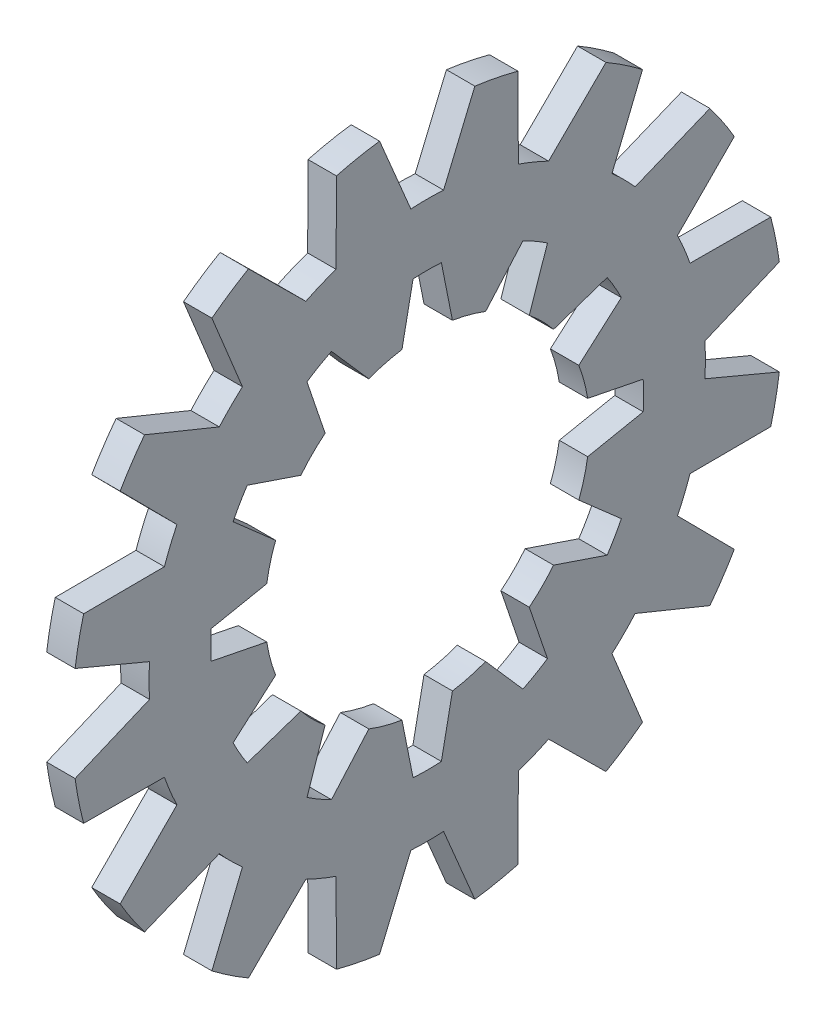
ISO-10303-21;
HEADER;
FILE_DESCRIPTION(('STEP AP214'),'2;1');
FILE_NAME('part.step','',(''),(''),'','','');
FILE_SCHEMA(('AUTOMOTIVE_DESIGN { 1 0 10303 214 1 1 1 1 }'));
ENDSEC;
DATA;
#1=APPLICATION_CONTEXT('core data for automotive mechanical design processes');
#2=APPLICATION_PROTOCOL_DEFINITION('international standard','automotive_design',2000,#1);
#3=PRODUCT_CONTEXT('',#1,'mechanical');
#4=PRODUCT('Part','Part','',(#3));
#5=PRODUCT_RELATED_PRODUCT_CATEGORY('part','',(#4));
#6=PRODUCT_DEFINITION_FORMATION('','',#4);
#7=PRODUCT_DEFINITION_CONTEXT('part definition',#1,'design');
#8=PRODUCT_DEFINITION('design','',#6,#7);
#9=PRODUCT_DEFINITION_SHAPE('','',#8);
#10=(LENGTH_UNIT() NAMED_UNIT(*) SI_UNIT(.MILLI.,.METRE.));
#11=(NAMED_UNIT(*) PLANE_ANGLE_UNIT() SI_UNIT($,.RADIAN.));
#12=(NAMED_UNIT(*) SI_UNIT($,.STERADIAN.) SOLID_ANGLE_UNIT());
#13=UNCERTAINTY_MEASURE_WITH_UNIT(LENGTH_MEASURE(1.E-05),#10,'distance_accuracy_value','');
#14=(GEOMETRIC_REPRESENTATION_CONTEXT(3) GLOBAL_UNCERTAINTY_ASSIGNED_CONTEXT((#13)) GLOBAL_UNIT_ASSIGNED_CONTEXT((#10,
#11,#12)) REPRESENTATION_CONTEXT('',''));
#15=CARTESIAN_POINT('',(0.,0.,0.));
#16=DIRECTION('',(0.,0.,1.));
#17=DIRECTION('',(1.,0.,0.));
#18=AXIS2_PLACEMENT_3D('',#15,#16,#17);
#19=CARTESIAN_POINT('',(-34.9249999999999,0.,0.));
#20=DIRECTION('',(-1.,0.,0.));
#21=DIRECTION('',(0.,0.,1.));
#22=AXIS2_PLACEMENT_3D('',#19,#20,#21);
#23=CYLINDRICAL_SURFACE('',#22,8.);
#24=CARTESIAN_POINT('',(-1.4,0.,0.));
#25=DIRECTION('',(-1.,0.,0.));
#26=DIRECTION('',(0.,0.,1.));
#27=AXIS2_PLACEMENT_3D('',#24,#25,#26);
#28=CIRCLE('',#27,8.);
#29=CARTESIAN_POINT('',(-1.4,1.24257778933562,7.90291088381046));
#30=VERTEX_POINT('',#29);
#31=CARTESIAN_POINT('',(-1.4,2.87535151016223,7.46541048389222));
#32=VERTEX_POINT('',#31);
#33=EDGE_CURVE('E1504',#30,#32,#28,.T.);
#34=ORIENTED_EDGE('',*,*,#33,.T.);
#35=DIRECTION('',(-1.,0.,0.));
#36=VECTOR('',#35,1.);
#37=CARTESIAN_POINT('',(-34.9249999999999,2.87535151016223,7.46541048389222));
#38=LINE('',#37,#36);
#39=CARTESIAN_POINT('',(0.,2.87535151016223,7.46541048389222));
#40=VERTEX_POINT('',#39);
#41=EDGE_CURVE('E736',#32,#40,#38,.F.);
#42=ORIENTED_EDGE('',*,*,#41,.T.);
#43=CARTESIAN_POINT('',(0.,0.,0.));
#44=DIRECTION('',(-1.,0.,0.));
#45=DIRECTION('',(0.,0.,1.));
#46=AXIS2_PLACEMENT_3D('',#43,#44,#45);
#47=CIRCLE('',#46,8.);
#48=CARTESIAN_POINT('',(0.,1.24257778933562,7.90291088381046));
#49=VERTEX_POINT('',#48);
#50=EDGE_CURVE('E1511',#49,#40,#47,.T.);
#51=ORIENTED_EDGE('',*,*,#50,.F.);
#52=DIRECTION('',(-1.,0.,0.));
#53=VECTOR('',#52,1.);
#54=CARTESIAN_POINT('',(-34.9249999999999,1.24257778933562,7.90291088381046));
#55=LINE('',#54,#53);
#56=EDGE_CURVE('E958',#49,#30,#55,.T.);
#57=ORIENTED_EDGE('',*,*,#56,.T.);
#58=EDGE_LOOP('',(#34,#42,#51,#57));
#59=FACE_BOUND('',#58,.T.);
#60=ADVANCED_FACE('F33',(#59),#23,.F.);
#61=CARTESIAN_POINT('',(-1.4,-2.87535151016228,7.4654104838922));
#62=VERTEX_POINT('',#61);
#63=CARTESIAN_POINT('',(-1.4,-1.24257778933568,7.90291088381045));
#64=VERTEX_POINT('',#63);
#65=EDGE_CURVE('E1578',#62,#64,#28,.T.);
#66=ORIENTED_EDGE('',*,*,#65,.T.);
#67=DIRECTION('',(-1.,0.,0.));
#68=VECTOR('',#67,1.);
#69=CARTESIAN_POINT('',(-34.9249999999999,-1.24257778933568,7.90291088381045));
#70=LINE('',#69,#68);
#71=CARTESIAN_POINT('',(0.,-1.24257778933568,7.90291088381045));
#72=VERTEX_POINT('',#71);
#73=EDGE_CURVE('E961',#64,#72,#70,.F.);
#74=ORIENTED_EDGE('',*,*,#73,.T.);
#75=CARTESIAN_POINT('',(0.,-2.87535151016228,7.4654104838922));
#76=VERTEX_POINT('',#75);
#77=EDGE_CURVE('E1513',#76,#72,#47,.T.);
#78=ORIENTED_EDGE('',*,*,#77,.F.);
#79=DIRECTION('',(-1.,0.,0.));
#80=VECTOR('',#79,1.);
#81=CARTESIAN_POINT('',(-34.9249999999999,-2.87535151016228,7.4654104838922));
#82=LINE('',#81,#80);
#83=EDGE_CURVE('E940',#76,#62,#82,.T.);
#84=ORIENTED_EDGE('',*,*,#83,.T.);
#85=EDGE_LOOP('',(#66,#74,#78,#84));
#86=FACE_BOUND('',#85,.T.);
#87=ADVANCED_FACE('F1577',(#86),#23,.F.);
#88=CARTESIAN_POINT('',(-1.4,-7.46541048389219,-2.87535151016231));
#89=VERTEX_POINT('',#88);
#90=CARTESIAN_POINT('',(-1.4,-7.90291088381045,-1.24257778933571));
#91=VERTEX_POINT('',#90);
#92=EDGE_CURVE('E1601',#89,#91,#28,.T.);
#93=ORIENTED_EDGE('',*,*,#92,.T.);
#94=DIRECTION('',(-1.,0.,0.));
#95=VECTOR('',#94,1.);
#96=CARTESIAN_POINT('',(-34.9249999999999,-7.90291088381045,-1.24257778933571));
#97=LINE('',#96,#95);
#98=CARTESIAN_POINT('',(0.,-7.90291088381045,-1.24257778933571));
#99=VERTEX_POINT('',#98);
#100=EDGE_CURVE('E955',#91,#99,#97,.F.);
#101=ORIENTED_EDGE('',*,*,#100,.T.);
#102=CARTESIAN_POINT('',(0.,-7.46541048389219,-2.87535151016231));
#103=VERTEX_POINT('',#102);
#104=EDGE_CURVE('E1538',#103,#99,#47,.T.);
#105=ORIENTED_EDGE('',*,*,#104,.F.);
#106=DIRECTION('',(-1.,0.,0.));
#107=VECTOR('',#106,1.);
#108=CARTESIAN_POINT('',(-34.9249999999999,-7.46541048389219,-2.87535151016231));
#109=LINE('',#108,#107);
#110=EDGE_CURVE('E928',#103,#89,#109,.T.);
#111=ORIENTED_EDGE('',*,*,#110,.T.);
#112=EDGE_LOOP('',(#93,#101,#105,#111));
#113=FACE_BOUND('',#112,.T.);
#114=ADVANCED_FACE('F1633',(#113),#23,.F.);
#115=CARTESIAN_POINT('',(0.,-7.90291088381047,1.2425777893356));
#116=VERTEX_POINT('',#115);
#117=CARTESIAN_POINT('',(0.,-7.46541048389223,2.8753515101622));
#118=VERTEX_POINT('',#117);
#119=EDGE_CURVE('E1543',#116,#118,#47,.T.);
#120=ORIENTED_EDGE('',*,*,#119,.F.);
#121=DIRECTION('',(-1.,0.,0.));
#122=VECTOR('',#121,1.);
#123=CARTESIAN_POINT('',(-34.9249999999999,-7.90291088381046,1.2425777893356));
#124=LINE('',#123,#122);
#125=CARTESIAN_POINT('',(-1.4,-7.90291088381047,1.2425777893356));
#126=VERTEX_POINT('',#125);
#127=EDGE_CURVE('E952',#116,#126,#124,.T.);
#128=ORIENTED_EDGE('',*,*,#127,.T.);
#129=CARTESIAN_POINT('',(-1.4,-7.46541048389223,2.8753515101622));
#130=VERTEX_POINT('',#129);
#131=EDGE_CURVE('E1582',#126,#130,#28,.T.);
#132=ORIENTED_EDGE('',*,*,#131,.T.);
#133=DIRECTION('',(-1.,0.,0.));
#134=VECTOR('',#133,1.);
#135=CARTESIAN_POINT('',(-34.9249999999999,-7.46541048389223,2.8753515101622));
#136=LINE('',#135,#134);
#137=EDGE_CURVE('E949',#130,#118,#136,.F.);
#138=ORIENTED_EDGE('',*,*,#137,.T.);
#139=EDGE_LOOP('',(#120,#128,#132,#138));
#140=FACE_BOUND('',#139,.T.);
#141=ADVANCED_FACE('F1610',(#140),#23,.F.);
#142=CARTESIAN_POINT('',(0.,-6.22283269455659,5.02755937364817));
#143=VERTEX_POINT('',#142);
#144=CARTESIAN_POINT('',(0.,-5.02755937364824,6.22283269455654));
#145=VERTEX_POINT('',#144);
#146=EDGE_CURVE('E1515',#143,#145,#47,.T.);
#147=ORIENTED_EDGE('',*,*,#146,.F.);
#148=DIRECTION('',(-1.,0.,0.));
#149=VECTOR('',#148,1.);
#150=CARTESIAN_POINT('',(-34.9249999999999,-6.22283269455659,5.02755937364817));
#151=LINE('',#150,#149);
#152=CARTESIAN_POINT('',(-1.4,-6.22283269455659,5.02755937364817));
#153=VERTEX_POINT('',#152);
#154=EDGE_CURVE('E946',#143,#153,#151,.T.);
#155=ORIENTED_EDGE('',*,*,#154,.T.);
#156=CARTESIAN_POINT('',(-1.4,-5.02755937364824,6.22283269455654));
#157=VERTEX_POINT('',#156);
#158=EDGE_CURVE('E1562',#153,#157,#28,.T.);
#159=ORIENTED_EDGE('',*,*,#158,.T.);
#160=DIRECTION('',(-1.,0.,0.));
#161=VECTOR('',#160,1.);
#162=CARTESIAN_POINT('',(-34.9249999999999,-5.02755937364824,6.22283269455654));
#163=LINE('',#162,#161);
#164=EDGE_CURVE('E943',#157,#145,#163,.F.);
#165=ORIENTED_EDGE('',*,*,#164,.T.);
#166=EDGE_LOOP('',(#147,#155,#159,#165));
#167=FACE_BOUND('',#166,.T.);
#168=ADVANCED_FACE('F1559',(#167),#23,.F.);
#169=CARTESIAN_POINT('',(-1.4,-1.24257778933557,-7.90291088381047));
#170=VERTEX_POINT('',#169);
#171=CARTESIAN_POINT('',(-1.4,-2.87535151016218,-7.46541048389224));
#172=VERTEX_POINT('',#171);
#173=EDGE_CURVE('E1593',#170,#172,#28,.T.);
#174=ORIENTED_EDGE('',*,*,#173,.T.);
#175=DIRECTION('',(-1.,0.,0.));
#176=VECTOR('',#175,1.);
#177=CARTESIAN_POINT('',(-34.9249999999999,-2.87535151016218,-7.46541048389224));
#178=LINE('',#177,#176);
#179=CARTESIAN_POINT('',(0.,-2.87535151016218,-7.46541048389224));
#180=VERTEX_POINT('',#179);
#181=EDGE_CURVE('E937',#172,#180,#178,.F.);
#182=ORIENTED_EDGE('',*,*,#181,.T.);
#183=CARTESIAN_POINT('',(0.,-1.24257778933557,-7.90291088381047));
#184=VERTEX_POINT('',#183);
#185=EDGE_CURVE('E1528',#184,#180,#47,.T.);
#186=ORIENTED_EDGE('',*,*,#185,.F.);
#187=DIRECTION('',(-1.,0.,0.));
#188=VECTOR('',#187,1.);
#189=CARTESIAN_POINT('',(-34.9249999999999,-1.24257778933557,-7.90291088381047));
#190=LINE('',#189,#188);
#191=EDGE_CURVE('E922',#184,#170,#190,.T.);
#192=ORIENTED_EDGE('',*,*,#191,.T.);
#193=EDGE_LOOP('',(#174,#182,#186,#192));
#194=FACE_BOUND('',#193,.T.);
#195=ADVANCED_FACE('F1707',(#194),#23,.F.);
#196=CARTESIAN_POINT('',(0.,-5.02755937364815,-6.22283269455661));
#197=VERTEX_POINT('',#196);
#198=CARTESIAN_POINT('',(0.,-6.22283269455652,-5.02755937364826));
#199=VERTEX_POINT('',#198);
#200=EDGE_CURVE('E1533',#197,#199,#47,.T.);
#201=ORIENTED_EDGE('',*,*,#200,.F.);
#202=DIRECTION('',(-1.,0.,0.));
#203=VECTOR('',#202,1.);
#204=CARTESIAN_POINT('',(-34.9249999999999,-5.02755937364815,-6.22283269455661));
#205=LINE('',#204,#203);
#206=CARTESIAN_POINT('',(-1.4,-5.02755937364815,-6.22283269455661));
#207=VERTEX_POINT('',#206);
#208=EDGE_CURVE('E934',#197,#207,#205,.T.);
#209=ORIENTED_EDGE('',*,*,#208,.T.);
#210=CARTESIAN_POINT('',(-1.4,-6.22283269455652,-5.02755937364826));
#211=VERTEX_POINT('',#210);
#212=EDGE_CURVE('E1597',#207,#211,#28,.T.);
#213=ORIENTED_EDGE('',*,*,#212,.T.);
#214=DIRECTION('',(-1.,0.,0.));
#215=VECTOR('',#214,1.);
#216=CARTESIAN_POINT('',(-34.9249999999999,-6.22283269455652,-5.02755937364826));
#217=LINE('',#216,#215);
#218=EDGE_CURVE('E931',#211,#199,#217,.F.);
#219=ORIENTED_EDGE('',*,*,#218,.T.);
#220=EDGE_LOOP('',(#201,#209,#213,#219));
#221=FACE_BOUND('',#220,.T.);
#222=ADVANCED_FACE('F1717',(#221),#23,.F.);
#223=CARTESIAN_POINT('',(-1.4,2.87535151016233,-7.46541048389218));
#224=VERTEX_POINT('',#223);
#225=CARTESIAN_POINT('',(-1.4,1.24257778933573,-7.90291088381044));
#226=VERTEX_POINT('',#225);
#227=EDGE_CURVE('E1589',#224,#226,#28,.T.);
#228=ORIENTED_EDGE('',*,*,#227,.T.);
#229=DIRECTION('',(-1.,0.,0.));
#230=VECTOR('',#229,1.);
#231=CARTESIAN_POINT('',(-34.9249999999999,1.24257778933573,-7.90291088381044));
#232=LINE('',#231,#230);
#233=CARTESIAN_POINT('',(0.,1.24257778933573,-7.90291088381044));
#234=VERTEX_POINT('',#233);
#235=EDGE_CURVE('E925',#226,#234,#232,.F.);
#236=ORIENTED_EDGE('',*,*,#235,.T.);
#237=CARTESIAN_POINT('',(0.,2.87535151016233,-7.46541048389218));
#238=VERTEX_POINT('',#237);
#239=EDGE_CURVE('E1523',#238,#234,#47,.T.);
#240=ORIENTED_EDGE('',*,*,#239,.F.);
#241=DIRECTION('',(-1.,0.,0.));
#242=VECTOR('',#241,1.);
#243=CARTESIAN_POINT('',(-34.9249999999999,2.87535151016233,-7.46541048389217));
#244=LINE('',#243,#242);
#245=EDGE_CURVE('E729',#238,#224,#244,.T.);
#246=ORIENTED_EDGE('',*,*,#245,.T.);
#247=EDGE_LOOP('',(#228,#236,#240,#246));
#248=FACE_BOUND('',#247,.T.);
#249=ADVANCED_FACE('F1697',(#248),#23,.F.);
#250=CARTESIAN_POINT('',(-1.4,7.90291088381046,-1.24257778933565));
#251=VERTEX_POINT('',#250);
#252=CARTESIAN_POINT('',(-1.4,7.46541048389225,-2.87535151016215));
#253=VERTEX_POINT('',#252);
#254=EDGE_CURVE('E1403',#251,#253,#28,.T.);
#255=ORIENTED_EDGE('',*,*,#254,.T.);
#256=DIRECTION('',(-1.,0.,0.));
#257=VECTOR('',#256,1.);
#258=CARTESIAN_POINT('',(-34.9249999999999,7.46541048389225,-2.87535151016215));
#259=LINE('',#258,#257);
#260=CARTESIAN_POINT('',(0.,7.46541048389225,-2.87535151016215));
#261=VERTEX_POINT('',#260);
#262=EDGE_CURVE('E919',#253,#261,#259,.F.);
#263=ORIENTED_EDGE('',*,*,#262,.T.);
#264=CARTESIAN_POINT('',(0.,7.90291088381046,-1.24257778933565));
#265=VERTEX_POINT('',#264);
#266=EDGE_CURVE('E1421',#265,#261,#47,.T.);
#267=ORIENTED_EDGE('',*,*,#266,.F.);
#268=DIRECTION('',(-1.,0.,0.));
#269=VECTOR('',#268,1.);
#270=CARTESIAN_POINT('',(-34.9249999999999,7.90291088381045,-1.24257778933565));
#271=LINE('',#270,#269);
#272=EDGE_CURVE('E1010',#265,#251,#271,.T.);
#273=ORIENTED_EDGE('',*,*,#272,.T.);
#274=EDGE_LOOP('',(#255,#263,#267,#273));
#275=FACE_BOUND('',#274,.T.);
#276=ADVANCED_FACE('F1655',(#275),#23,.F.);
#277=CARTESIAN_POINT('',(0.,6.22283269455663,-5.02755937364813));
#278=VERTEX_POINT('',#277);
#279=CARTESIAN_POINT('',(0.,5.02755937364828,-6.2228326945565));
#280=VERTEX_POINT('',#279);
#281=EDGE_CURVE('E1425',#278,#280,#47,.T.);
#282=ORIENTED_EDGE('',*,*,#281,.F.);
#283=DIRECTION('',(-1.,0.,0.));
#284=VECTOR('',#283,1.);
#285=CARTESIAN_POINT('',(-34.9249999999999,6.22283269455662,-5.02755937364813));
#286=LINE('',#285,#284);
#287=CARTESIAN_POINT('',(-1.4,6.22283269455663,-5.02755937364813));
#288=VERTEX_POINT('',#287);
#289=EDGE_CURVE('E916',#278,#288,#286,.T.);
#290=ORIENTED_EDGE('',*,*,#289,.T.);
#291=CARTESIAN_POINT('',(-1.4,5.02755937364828,-6.2228326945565));
#292=VERTEX_POINT('',#291);
#293=EDGE_CURVE('E1407',#288,#292,#28,.T.);
#294=ORIENTED_EDGE('',*,*,#293,.T.);
#295=DIRECTION('',(-1.,0.,0.));
#296=VECTOR('',#295,1.);
#297=CARTESIAN_POINT('',(-34.9249999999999,5.02755937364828,-6.2228326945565));
#298=LINE('',#297,#296);
#299=EDGE_CURVE('E913',#292,#280,#298,.F.);
#300=ORIENTED_EDGE('',*,*,#299,.T.);
#301=EDGE_LOOP('',(#282,#290,#294,#300));
#302=FACE_BOUND('',#301,.T.);
#303=ADVANCED_FACE('F1648',(#302),#23,.F.);
#304=CARTESIAN_POINT('',(0.,5.0275593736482,6.22283269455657));
#305=VERTEX_POINT('',#304);
#306=CARTESIAN_POINT('',(0.,6.22283269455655,5.02755937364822));
#307=VERTEX_POINT('',#306);
#308=EDGE_CURVE('E1426',#305,#307,#47,.T.);
#309=ORIENTED_EDGE('',*,*,#308,.F.);
#310=DIRECTION('',(-1.,0.,0.));
#311=VECTOR('',#310,1.);
#312=CARTESIAN_POINT('',(-34.9249999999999,5.0275593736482,6.22283269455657));
#313=LINE('',#312,#311);
#314=CARTESIAN_POINT('',(-1.4,5.0275593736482,6.22283269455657));
#315=VERTEX_POINT('',#314);
#316=EDGE_CURVE('E964',#305,#315,#313,.T.);
#317=ORIENTED_EDGE('',*,*,#316,.T.);
#318=CARTESIAN_POINT('',(-1.4,6.22283269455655,5.02755937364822));
#319=VERTEX_POINT('',#318);
#320=EDGE_CURVE('E1408',#315,#319,#28,.T.);
#321=ORIENTED_EDGE('',*,*,#320,.T.);
#322=DIRECTION('',(-1.,0.,0.));
#323=VECTOR('',#322,1.);
#324=CARTESIAN_POINT('',(-34.9249999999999,6.22283269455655,5.02755937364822));
#325=LINE('',#324,#323);
#326=EDGE_CURVE('E990',#319,#307,#325,.F.);
#327=ORIENTED_EDGE('',*,*,#326,.T.);
#328=EDGE_LOOP('',(#309,#317,#321,#327));
#329=FACE_BOUND('',#328,.T.);
#330=ADVANCED_FACE('F1636',(#329),#23,.F.);
#331=CARTESIAN_POINT('',(-34.9249999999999,0.,0.));
#332=DIRECTION('',(-1.,0.,0.));
#333=DIRECTION('',(0.,0.,1.));
#334=AXIS2_PLACEMENT_3D('',#331,#332,#333);
#335=CYLINDRICAL_SURFACE('',#334,17.5);
#336=CARTESIAN_POINT('',(-1.4,0.,0.));
#337=DIRECTION('',(-1.,0.,0.));
#338=DIRECTION('',(0.,0.,1.));
#339=AXIS2_PLACEMENT_3D('',#336,#337,#338);
#340=CIRCLE('',#339,17.5);
#341=CARTESIAN_POINT('',(-1.4,2.34592016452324,17.3420488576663));
#342=VERTEX_POINT('',#341);
#343=CARTESIAN_POINT('',(-1.4,4.46916715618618,16.9197087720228));
#344=VERTEX_POINT('',#343);
#345=EDGE_CURVE('E2069',#342,#344,#340,.T.);
#346=ORIENTED_EDGE('',*,*,#345,.F.);
#347=DIRECTION('',(-1.,0.,0.));
#348=VECTOR('',#347,1.);
#349=CARTESIAN_POINT('',(-34.9249999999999,2.34592016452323,17.3420488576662));
#350=LINE('',#349,#348);
#351=CARTESIAN_POINT('',(0.,2.34592016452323,17.3420488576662));
#352=VERTEX_POINT('',#351);
#353=EDGE_CURVE('E1351',#342,#352,#350,.F.);
#354=ORIENTED_EDGE('',*,*,#353,.T.);
#355=CARTESIAN_POINT('',(0.,0.,0.));
#356=DIRECTION('',(-1.,0.,0.));
#357=DIRECTION('',(0.,0.,1.));
#358=AXIS2_PLACEMENT_3D('',#355,#356,#357);
#359=CIRCLE('',#358,17.5);
#360=CARTESIAN_POINT('',(0.,4.46916715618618,16.9197087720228));
#361=VERTEX_POINT('',#360);
#362=EDGE_CURVE('E2050',#352,#361,#359,.T.);
#363=ORIENTED_EDGE('',*,*,#362,.T.);
#364=DIRECTION('',(-1.,0.,0.));
#365=VECTOR('',#364,1.);
#366=CARTESIAN_POINT('',(-34.9249999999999,4.46916715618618,16.9197087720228));
#367=LINE('',#366,#365);
#368=EDGE_CURVE('E1342',#361,#344,#367,.T.);
#369=ORIENTED_EDGE('',*,*,#368,.T.);
#370=EDGE_LOOP('',(#346,#354,#363,#369));
#371=FACE_BOUND('',#370,.T.);
#372=ADVANCED_FACE('F1647',(#371),#335,.T.);
#373=CARTESIAN_POINT('',(-1.4,8.80386240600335,15.1242192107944));
#374=VERTEX_POINT('',#373);
#375=CARTESIAN_POINT('',(-1.4,10.6038642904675,13.9214964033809));
#376=VERTEX_POINT('',#375);
#377=EDGE_CURVE('E2067',#374,#376,#340,.T.);
#378=ORIENTED_EDGE('',*,*,#377,.F.);
#379=DIRECTION('',(-1.,0.,0.));
#380=VECTOR('',#379,1.);
#381=CARTESIAN_POINT('',(-34.9249999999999,8.80386240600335,15.1242192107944));
#382=LINE('',#381,#380);
#383=CARTESIAN_POINT('',(0.,8.80386240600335,15.1242192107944));
#384=VERTEX_POINT('',#383);
#385=EDGE_CURVE('E1345',#374,#384,#382,.F.);
#386=ORIENTED_EDGE('',*,*,#385,.T.);
#387=CARTESIAN_POINT('',(0.,10.6038642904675,13.9214964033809));
#388=VERTEX_POINT('',#387);
#389=EDGE_CURVE('E2008',#384,#388,#359,.T.);
#390=ORIENTED_EDGE('',*,*,#389,.T.);
#391=DIRECTION('',(-1.,0.,0.));
#392=VECTOR('',#391,1.);
#393=CARTESIAN_POINT('',(-34.9249999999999,10.6038642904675,13.9214964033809));
#394=LINE('',#393,#392);
#395=EDGE_CURVE('E1336',#388,#376,#394,.T.);
#396=ORIENTED_EDGE('',*,*,#395,.T.);
#397=EDGE_LOOP('',(#378,#386,#390,#396));
#398=FACE_BOUND('',#397,.T.);
#399=ADVANCED_FACE('F1653',(#398),#335,.T.);
#400=CARTESIAN_POINT('',(-1.4,13.9214964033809,10.6038642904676));
#401=VERTEX_POINT('',#400);
#402=CARTESIAN_POINT('',(-1.4,15.1242192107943,8.8038624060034));
#403=VERTEX_POINT('',#402);
#404=EDGE_CURVE('E1414',#401,#403,#340,.T.);
#405=ORIENTED_EDGE('',*,*,#404,.F.);
#406=DIRECTION('',(-1.,0.,0.));
#407=VECTOR('',#406,1.);
#408=CARTESIAN_POINT('',(-34.9249999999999,13.9214964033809,10.6038642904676));
#409=LINE('',#408,#407);
#410=CARTESIAN_POINT('',(0.,13.9214964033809,10.6038642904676));
#411=VERTEX_POINT('',#410);
#412=EDGE_CURVE('E1339',#401,#411,#409,.F.);
#413=ORIENTED_EDGE('',*,*,#412,.T.);
#414=CARTESIAN_POINT('',(0.,15.1242192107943,8.8038624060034));
#415=VERTEX_POINT('',#414);
#416=EDGE_CURVE('E1420',#411,#415,#359,.T.);
#417=ORIENTED_EDGE('',*,*,#416,.T.);
#418=DIRECTION('',(-1.,0.,0.));
#419=VECTOR('',#418,1.);
#420=CARTESIAN_POINT('',(-34.9249999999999,15.1242192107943,8.8038624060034));
#421=LINE('',#420,#419);
#422=EDGE_CURVE('E1370',#415,#403,#421,.T.);
#423=ORIENTED_EDGE('',*,*,#422,.T.);
#424=EDGE_LOOP('',(#405,#413,#417,#423));
#425=FACE_BOUND('',#424,.T.);
#426=ADVANCED_FACE('F2136',(#425),#335,.T.);
#427=CARTESIAN_POINT('',(-1.4,-17.3420488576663,2.34592016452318));
#428=VERTEX_POINT('',#427);
#429=CARTESIAN_POINT('',(-1.4,-16.9197087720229,4.46916715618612));
#430=VERTEX_POINT('',#429);
#431=EDGE_CURVE('E2090',#428,#430,#340,.T.);
#432=ORIENTED_EDGE('',*,*,#431,.F.);
#433=DIRECTION('',(-1.,0.,0.));
#434=VECTOR('',#433,1.);
#435=CARTESIAN_POINT('',(-34.9249999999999,-17.3420488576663,2.34592016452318));
#436=LINE('',#435,#434);
#437=CARTESIAN_POINT('',(0.,-17.3420488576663,2.34592016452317));
#438=VERTEX_POINT('',#437);
#439=EDGE_CURVE('E1333',#428,#438,#436,.F.);
#440=ORIENTED_EDGE('',*,*,#439,.T.);
#441=CARTESIAN_POINT('',(0.,-16.9197087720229,4.46916715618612));
#442=VERTEX_POINT('',#441);
#443=EDGE_CURVE('E2034',#438,#442,#359,.T.);
#444=ORIENTED_EDGE('',*,*,#443,.T.);
#445=DIRECTION('',(-1.,0.,0.));
#446=VECTOR('',#445,1.);
#447=CARTESIAN_POINT('',(-34.9249999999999,-16.9197087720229,4.46916715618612));
#448=LINE('',#447,#446);
#449=EDGE_CURVE('E1324',#442,#430,#448,.T.);
#450=ORIENTED_EDGE('',*,*,#449,.T.);
#451=EDGE_LOOP('',(#432,#440,#444,#450));
#452=FACE_BOUND('',#451,.T.);
#453=ADVANCED_FACE('F2132',(#452),#335,.T.);
#454=CARTESIAN_POINT('',(-1.4,-15.1242192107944,8.80386240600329));
#455=VERTEX_POINT('',#454);
#456=CARTESIAN_POINT('',(-1.4,-13.921496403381,10.6038642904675));
#457=VERTEX_POINT('',#456);
#458=EDGE_CURVE('E2093',#455,#457,#340,.T.);
#459=ORIENTED_EDGE('',*,*,#458,.F.);
#460=DIRECTION('',(-1.,0.,0.));
#461=VECTOR('',#460,1.);
#462=CARTESIAN_POINT('',(-34.9249999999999,-15.1242192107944,8.80386240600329));
#463=LINE('',#462,#461);
#464=CARTESIAN_POINT('',(0.,-15.1242192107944,8.80386240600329));
#465=VERTEX_POINT('',#464);
#466=EDGE_CURVE('E1327',#455,#465,#463,.F.);
#467=ORIENTED_EDGE('',*,*,#466,.T.);
#468=CARTESIAN_POINT('',(0.,-13.921496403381,10.6038642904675));
#469=VERTEX_POINT('',#468);
#470=EDGE_CURVE('E2038',#465,#469,#359,.T.);
#471=ORIENTED_EDGE('',*,*,#470,.T.);
#472=DIRECTION('',(-1.,0.,0.));
#473=VECTOR('',#472,1.);
#474=CARTESIAN_POINT('',(-34.9249999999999,-13.921496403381,10.6038642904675));
#475=LINE('',#474,#473);
#476=EDGE_CURVE('E1312',#469,#457,#475,.T.);
#477=ORIENTED_EDGE('',*,*,#476,.T.);
#478=EDGE_LOOP('',(#459,#467,#471,#477));
#479=FACE_BOUND('',#478,.T.);
#480=ADVANCED_FACE('F2128',(#479),#335,.T.);
#481=CARTESIAN_POINT('',(0.,-4.4691671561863,16.9197087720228));
#482=VERTEX_POINT('',#481);
#483=CARTESIAN_POINT('',(0.,-2.34592016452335,17.3420488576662));
#484=VERTEX_POINT('',#483);
#485=EDGE_CURVE('E2046',#482,#484,#359,.T.);
#486=ORIENTED_EDGE('',*,*,#485,.T.);
#487=DIRECTION('',(-1.,0.,0.));
#488=VECTOR('',#487,1.);
#489=CARTESIAN_POINT('',(-34.9249999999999,-2.34592016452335,17.3420488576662));
#490=LINE('',#489,#488);
#491=CARTESIAN_POINT('',(-1.4,-2.34592016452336,17.3420488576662));
#492=VERTEX_POINT('',#491);
#493=EDGE_CURVE('E1348',#484,#492,#490,.T.);
#494=ORIENTED_EDGE('',*,*,#493,.T.);
#495=CARTESIAN_POINT('',(-1.4,-4.46916715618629,16.9197087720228));
#496=VERTEX_POINT('',#495);
#497=EDGE_CURVE('E2071',#496,#492,#340,.T.);
#498=ORIENTED_EDGE('',*,*,#497,.F.);
#499=DIRECTION('',(-1.,0.,0.));
#500=VECTOR('',#499,1.);
#501=CARTESIAN_POINT('',(-34.9249999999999,-4.4691671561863,16.9197087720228));
#502=LINE('',#501,#500);
#503=EDGE_CURVE('E1321',#496,#482,#502,.F.);
#504=ORIENTED_EDGE('',*,*,#503,.T.);
#505=EDGE_LOOP('',(#486,#494,#498,#504));
#506=FACE_BOUND('',#505,.T.);
#507=ADVANCED_FACE('F2103',(#506),#335,.T.);
#508=CARTESIAN_POINT('',(0.,-10.6038642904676,13.9214964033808));
#509=VERTEX_POINT('',#508);
#510=CARTESIAN_POINT('',(0.,-8.80386240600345,15.1242192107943));
#511=VERTEX_POINT('',#510);
#512=EDGE_CURVE('E2042',#509,#511,#359,.T.);
#513=ORIENTED_EDGE('',*,*,#512,.T.);
#514=DIRECTION('',(-1.,0.,0.));
#515=VECTOR('',#514,1.);
#516=CARTESIAN_POINT('',(-34.9249999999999,-8.80386240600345,15.1242192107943));
#517=LINE('',#516,#515);
#518=CARTESIAN_POINT('',(-1.4,-8.80386240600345,15.1242192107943));
#519=VERTEX_POINT('',#518);
#520=EDGE_CURVE('E1318',#511,#519,#517,.T.);
#521=ORIENTED_EDGE('',*,*,#520,.T.);
#522=CARTESIAN_POINT('',(-1.4,-10.6038642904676,13.9214964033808));
#523=VERTEX_POINT('',#522);
#524=EDGE_CURVE('E2096',#523,#519,#340,.T.);
#525=ORIENTED_EDGE('',*,*,#524,.F.);
#526=DIRECTION('',(-1.,0.,0.));
#527=VECTOR('',#526,1.);
#528=CARTESIAN_POINT('',(-34.9249999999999,-10.6038642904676,13.9214964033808));
#529=LINE('',#528,#527);
#530=EDGE_CURVE('E1315',#523,#509,#529,.F.);
#531=ORIENTED_EDGE('',*,*,#530,.T.);
#532=EDGE_LOOP('',(#513,#521,#525,#531));
#533=FACE_BOUND('',#532,.T.);
#534=ADVANCED_FACE('F2120',(#533),#335,.T.);
#535=CARTESIAN_POINT('',(-1.4,-13.9214964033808,-10.6038642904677));
#536=VERTEX_POINT('',#535);
#537=CARTESIAN_POINT('',(-1.4,-15.1242192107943,-8.8038624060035));
#538=VERTEX_POINT('',#537);
#539=EDGE_CURVE('E2084',#536,#538,#340,.T.);
#540=ORIENTED_EDGE('',*,*,#539,.F.);
#541=DIRECTION('',(-1.,0.,0.));
#542=VECTOR('',#541,1.);
#543=CARTESIAN_POINT('',(-34.9249999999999,-13.9214964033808,-10.6038642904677));
#544=LINE('',#543,#542);
#545=CARTESIAN_POINT('',(0.,-13.9214964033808,-10.6038642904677));
#546=VERTEX_POINT('',#545);
#547=EDGE_CURVE('E1309',#536,#546,#544,.F.);
#548=ORIENTED_EDGE('',*,*,#547,.T.);
#549=CARTESIAN_POINT('',(0.,-15.1242192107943,-8.8038624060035));
#550=VERTEX_POINT('',#549);
#551=EDGE_CURVE('E2026',#546,#550,#359,.T.);
#552=ORIENTED_EDGE('',*,*,#551,.T.);
#553=DIRECTION('',(-1.,0.,0.));
#554=VECTOR('',#553,1.);
#555=CARTESIAN_POINT('',(-34.9249999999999,-15.1242192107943,-8.8038624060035));
#556=LINE('',#555,#554);
#557=EDGE_CURVE('E1294',#550,#538,#556,.T.);
#558=ORIENTED_EDGE('',*,*,#557,.T.);
#559=EDGE_LOOP('',(#540,#548,#552,#558));
#560=FACE_BOUND('',#559,.T.);
#561=ADVANCED_FACE('F2122',(#560),#335,.T.);
#562=CARTESIAN_POINT('',(0.,-8.80386240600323,-15.1242192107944));
#563=VERTEX_POINT('',#562);
#564=CARTESIAN_POINT('',(0.,-10.6038642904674,-13.921496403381));
#565=VERTEX_POINT('',#564);
#566=EDGE_CURVE('E2022',#563,#565,#359,.T.);
#567=ORIENTED_EDGE('',*,*,#566,.T.);
#568=DIRECTION('',(-1.,0.,0.));
#569=VECTOR('',#568,1.);
#570=CARTESIAN_POINT('',(-34.9249999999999,-10.6038642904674,-13.921496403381));
#571=LINE('',#570,#569);
#572=CARTESIAN_POINT('',(-1.4,-10.6038642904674,-13.921496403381));
#573=VERTEX_POINT('',#572);
#574=EDGE_CURVE('E1306',#565,#573,#571,.T.);
#575=ORIENTED_EDGE('',*,*,#574,.T.);
#576=CARTESIAN_POINT('',(-1.4,-8.80386240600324,-15.1242192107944));
#577=VERTEX_POINT('',#576);
#578=EDGE_CURVE('E2081',#577,#573,#340,.T.);
#579=ORIENTED_EDGE('',*,*,#578,.F.);
#580=DIRECTION('',(-1.,0.,0.));
#581=VECTOR('',#580,1.);
#582=CARTESIAN_POINT('',(-34.9249999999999,-8.80386240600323,-15.1242192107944));
#583=LINE('',#582,#581);
#584=EDGE_CURVE('E1303',#577,#563,#583,.F.);
#585=ORIENTED_EDGE('',*,*,#584,.T.);
#586=EDGE_LOOP('',(#567,#575,#579,#585));
#587=FACE_BOUND('',#586,.T.);
#588=ADVANCED_FACE('F2127',(#587),#335,.T.);
#589=CARTESIAN_POINT('',(0.,-16.9197087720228,-4.46916715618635));
#590=VERTEX_POINT('',#589);
#591=CARTESIAN_POINT('',(0.,-17.3420488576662,-2.34592016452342));
#592=VERTEX_POINT('',#591);
#593=EDGE_CURVE('E2030',#590,#592,#359,.T.);
#594=ORIENTED_EDGE('',*,*,#593,.T.);
#595=DIRECTION('',(-1.,0.,0.));
#596=VECTOR('',#595,1.);
#597=CARTESIAN_POINT('',(-34.9249999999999,-17.3420488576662,-2.34592016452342));
#598=LINE('',#597,#596);
#599=CARTESIAN_POINT('',(-1.4,-17.3420488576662,-2.34592016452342));
#600=VERTEX_POINT('',#599);
#601=EDGE_CURVE('E1330',#592,#600,#598,.T.);
#602=ORIENTED_EDGE('',*,*,#601,.T.);
#603=CARTESIAN_POINT('',(-1.4,-16.9197087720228,-4.46916715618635));
#604=VERTEX_POINT('',#603);
#605=EDGE_CURVE('E2087',#604,#600,#340,.T.);
#606=ORIENTED_EDGE('',*,*,#605,.F.);
#607=DIRECTION('',(-1.,0.,0.));
#608=VECTOR('',#607,1.);
#609=CARTESIAN_POINT('',(-34.9249999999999,-16.9197087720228,-4.46916715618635));
#610=LINE('',#609,#608);
#611=EDGE_CURVE('E1297',#604,#590,#610,.F.);
#612=ORIENTED_EDGE('',*,*,#611,.T.);
#613=EDGE_LOOP('',(#594,#602,#606,#612));
#614=FACE_BOUND('',#613,.T.);
#615=ADVANCED_FACE('F2152',(#614),#335,.T.);
#616=CARTESIAN_POINT('',(-1.4,10.6038642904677,-13.9214964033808));
#617=VERTEX_POINT('',#616);
#618=CARTESIAN_POINT('',(-1.4,8.80386240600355,-15.1242192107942));
#619=VERTEX_POINT('',#618);
#620=EDGE_CURVE('E2073',#617,#619,#340,.T.);
#621=ORIENTED_EDGE('',*,*,#620,.F.);
#622=DIRECTION('',(-1.,0.,0.));
#623=VECTOR('',#622,1.);
#624=CARTESIAN_POINT('',(-34.9249999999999,10.6038642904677,-13.9214964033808));
#625=LINE('',#624,#623);
#626=CARTESIAN_POINT('',(0.,10.6038642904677,-13.9214964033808));
#627=VERTEX_POINT('',#626);
#628=EDGE_CURVE('E1291',#617,#627,#625,.F.);
#629=ORIENTED_EDGE('',*,*,#628,.T.);
#630=CARTESIAN_POINT('',(0.,8.80386240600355,-15.1242192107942));
#631=VERTEX_POINT('',#630);
#632=EDGE_CURVE('E2010',#627,#631,#359,.T.);
#633=ORIENTED_EDGE('',*,*,#632,.T.);
#634=DIRECTION('',(-1.,0.,0.));
#635=VECTOR('',#634,1.);
#636=CARTESIAN_POINT('',(-34.9249999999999,8.80386240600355,-15.1242192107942));
#637=LINE('',#636,#635);
#638=EDGE_CURVE('E1276',#631,#619,#637,.T.);
#639=ORIENTED_EDGE('',*,*,#638,.T.);
#640=EDGE_LOOP('',(#621,#629,#633,#639));
#641=FACE_BOUND('',#640,.T.);
#642=ADVANCED_FACE('F2154',(#641),#335,.T.);
#643=CARTESIAN_POINT('',(0.,15.1242192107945,-8.80386240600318));
#644=VERTEX_POINT('',#643);
#645=CARTESIAN_POINT('',(0.,13.921496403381,-10.6038642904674));
#646=VERTEX_POINT('',#645);
#647=EDGE_CURVE('E1419',#644,#646,#359,.T.);
#648=ORIENTED_EDGE('',*,*,#647,.T.);
#649=DIRECTION('',(-1.,0.,0.));
#650=VECTOR('',#649,1.);
#651=CARTESIAN_POINT('',(-34.9249999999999,13.921496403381,-10.6038642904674));
#652=LINE('',#651,#650);
#653=CARTESIAN_POINT('',(-1.4,13.921496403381,-10.6038642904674));
#654=VERTEX_POINT('',#653);
#655=EDGE_CURVE('E1288',#646,#654,#652,.T.);
#656=ORIENTED_EDGE('',*,*,#655,.T.);
#657=CARTESIAN_POINT('',(-1.4,15.1242192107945,-8.80386240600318));
#658=VERTEX_POINT('',#657);
#659=EDGE_CURVE('E1413',#658,#654,#340,.T.);
#660=ORIENTED_EDGE('',*,*,#659,.F.);
#661=DIRECTION('',(-1.,0.,0.));
#662=VECTOR('',#661,1.);
#663=CARTESIAN_POINT('',(-34.9249999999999,15.1242192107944,-8.80386240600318));
#664=LINE('',#663,#662);
#665=EDGE_CURVE('E1285',#658,#644,#664,.F.);
#666=ORIENTED_EDGE('',*,*,#665,.T.);
#667=EDGE_LOOP('',(#648,#656,#660,#666));
#668=FACE_BOUND('',#667,.T.);
#669=ADVANCED_FACE('F2159',(#668),#335,.T.);
#670=CARTESIAN_POINT('',(-1.4,4.4691671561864,-16.9197087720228));
#671=VERTEX_POINT('',#670);
#672=CARTESIAN_POINT('',(-1.4,2.34592016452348,-17.3420488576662));
#673=VERTEX_POINT('',#672);
#674=EDGE_CURVE('E2075',#671,#673,#340,.T.);
#675=ORIENTED_EDGE('',*,*,#674,.F.);
#676=DIRECTION('',(-1.,0.,0.));
#677=VECTOR('',#676,1.);
#678=CARTESIAN_POINT('',(-34.9249999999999,4.4691671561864,-16.9197087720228));
#679=LINE('',#678,#677);
#680=CARTESIAN_POINT('',(0.,4.4691671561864,-16.9197087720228));
#681=VERTEX_POINT('',#680);
#682=EDGE_CURVE('E1279',#671,#681,#679,.F.);
#683=ORIENTED_EDGE('',*,*,#682,.T.);
#684=CARTESIAN_POINT('',(0.,2.34592016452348,-17.3420488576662));
#685=VERTEX_POINT('',#684);
#686=EDGE_CURVE('E2014',#681,#685,#359,.T.);
#687=ORIENTED_EDGE('',*,*,#686,.T.);
#688=DIRECTION('',(-1.,0.,0.));
#689=VECTOR('',#688,1.);
#690=CARTESIAN_POINT('',(-34.9249999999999,2.34592016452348,-17.3420488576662));
#691=LINE('',#690,#689);
#692=EDGE_CURVE('E1072',#685,#673,#691,.T.);
#693=ORIENTED_EDGE('',*,*,#692,.T.);
#694=EDGE_LOOP('',(#675,#683,#687,#693));
#695=FACE_BOUND('',#694,.T.);
#696=ADVANCED_FACE('F2656',(#695),#335,.T.);
#697=CARTESIAN_POINT('',(0.,-2.34592016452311,-17.3420488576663));
#698=VERTEX_POINT('',#697);
#699=CARTESIAN_POINT('',(0.,-4.46916715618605,-16.9197087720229));
#700=VERTEX_POINT('',#699);
#701=EDGE_CURVE('E2018',#698,#700,#359,.T.);
#702=ORIENTED_EDGE('',*,*,#701,.T.);
#703=DIRECTION('',(-1.,0.,0.));
#704=VECTOR('',#703,1.);
#705=CARTESIAN_POINT('',(-34.9249999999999,-4.46916715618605,-16.9197087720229));
#706=LINE('',#705,#704);
#707=CARTESIAN_POINT('',(-1.4,-4.46916715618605,-16.9197087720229));
#708=VERTEX_POINT('',#707);
#709=EDGE_CURVE('E1300',#700,#708,#706,.T.);
#710=ORIENTED_EDGE('',*,*,#709,.T.);
#711=CARTESIAN_POINT('',(-1.4,-2.34592016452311,-17.3420488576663));
#712=VERTEX_POINT('',#711);
#713=EDGE_CURVE('E2078',#712,#708,#340,.T.);
#714=ORIENTED_EDGE('',*,*,#713,.F.);
#715=DIRECTION('',(-1.,0.,0.));
#716=VECTOR('',#715,1.);
#717=CARTESIAN_POINT('',(-34.9249999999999,-2.34592016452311,-17.3420488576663));
#718=LINE('',#717,#716);
#719=EDGE_CURVE('E1273',#712,#698,#718,.F.);
#720=ORIENTED_EDGE('',*,*,#719,.T.);
#721=EDGE_LOOP('',(#702,#710,#714,#720));
#722=FACE_BOUND('',#721,.T.);
#723=ADVANCED_FACE('F1643',(#722),#335,.T.);
#724=CARTESIAN_POINT('',(-1.4,16.9197087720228,4.46916715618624));
#725=VERTEX_POINT('',#724);
#726=CARTESIAN_POINT('',(-1.4,17.3420488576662,2.34592016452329));
#727=VERTEX_POINT('',#726);
#728=EDGE_CURVE('E1406',#725,#727,#340,.T.);
#729=ORIENTED_EDGE('',*,*,#728,.F.);
#730=DIRECTION('',(-1.,0.,0.));
#731=VECTOR('',#730,1.);
#732=CARTESIAN_POINT('',(-34.9249999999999,16.9197087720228,4.46916715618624));
#733=LINE('',#732,#731);
#734=CARTESIAN_POINT('',(0.,16.9197087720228,4.46916715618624));
#735=VERTEX_POINT('',#734);
#736=EDGE_CURVE('E1375',#725,#735,#733,.F.);
#737=ORIENTED_EDGE('',*,*,#736,.T.);
#738=CARTESIAN_POINT('',(0.,17.3420488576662,2.34592016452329));
#739=VERTEX_POINT('',#738);
#740=EDGE_CURVE('E1412',#735,#739,#359,.T.);
#741=ORIENTED_EDGE('',*,*,#740,.T.);
#742=DIRECTION('',(-1.,0.,0.));
#743=VECTOR('',#742,1.);
#744=CARTESIAN_POINT('',(-34.9249999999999,17.3420488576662,2.3459201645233));
#745=LINE('',#744,#743);
#746=EDGE_CURVE('E1394',#739,#727,#745,.T.);
#747=ORIENTED_EDGE('',*,*,#746,.T.);
#748=EDGE_LOOP('',(#729,#737,#741,#747));
#749=FACE_BOUND('',#748,.T.);
#750=ADVANCED_FACE('F1635',(#749),#335,.T.);
#751=CARTESIAN_POINT('',(0.,7.46541048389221,2.87535151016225));
#752=VERTEX_POINT('',#751);
#753=CARTESIAN_POINT('',(0.,7.90291088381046,1.24257778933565));
#754=VERTEX_POINT('',#753);
#755=EDGE_CURVE('E1418',#752,#754,#47,.T.);
#756=ORIENTED_EDGE('',*,*,#755,.F.);
#757=DIRECTION('',(-1.,0.,0.));
#758=VECTOR('',#757,1.);
#759=CARTESIAN_POINT('',(-34.9249999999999,7.46541048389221,2.87535151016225));
#760=LINE('',#759,#758);
#761=CARTESIAN_POINT('',(-1.4,7.46541048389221,2.87535151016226));
#762=VERTEX_POINT('',#761);
#763=EDGE_CURVE('E985',#752,#762,#760,.T.);
#764=ORIENTED_EDGE('',*,*,#763,.T.);
#765=CARTESIAN_POINT('',(-1.4,7.90291088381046,1.24257778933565));
#766=VERTEX_POINT('',#765);
#767=EDGE_CURVE('E1402',#762,#766,#28,.T.);
#768=ORIENTED_EDGE('',*,*,#767,.T.);
#769=DIRECTION('',(-1.,0.,0.));
#770=VECTOR('',#769,1.);
#771=CARTESIAN_POINT('',(-34.9249999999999,7.90291088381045,1.24257778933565));
#772=LINE('',#771,#770);
#773=EDGE_CURVE('E1015',#766,#754,#772,.F.);
#774=ORIENTED_EDGE('',*,*,#773,.T.);
#775=EDGE_LOOP('',(#756,#764,#768,#774));
#776=FACE_BOUND('',#775,.T.);
#777=ADVANCED_FACE('F35',(#776),#23,.F.);
#778=CARTESIAN_POINT('',(0.,8.,0.));
#779=DIRECTION('',(-1.,0.,0.));
#780=DIRECTION('',(0.,0.,1.));
#781=AXIS2_PLACEMENT_3D('',#778,#779,#780);
#782=PLANE('',#781);
#783=ORIENTED_EDGE('',*,*,#362,.F.);
#784=DIRECTION('',(0.,0.387179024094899,0.922004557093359));
#785=VECTOR('',#784,1.);
#786=CARTESIAN_POINT('',(0.,2.69617246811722,18.1761183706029));
#787=LINE('',#786,#785);
#788=CARTESIAN_POINT('',(0.,0.80653001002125,13.6762388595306));
#789=VERTEX_POINT('',#788);
#790=EDGE_CURVE('E1043',#789,#352,#787,.T.);
#791=ORIENTED_EDGE('',*,*,#790,.F.);
#792=CARTESIAN_POINT('',(0.,0.,0.));
#793=DIRECTION('',(-1.,0.,0.));
#794=DIRECTION('',(0.,1.,0.));
#795=AXIS2_PLACEMENT_3D('',#792,#793,#794);
#796=CIRCLE('',#795,13.7);
#797=CARTESIAN_POINT('',(0.,-0.806530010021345,13.6762388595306));
#798=VERTEX_POINT('',#797);
#799=EDGE_CURVE('E1049',#798,#789,#796,.T.);
#800=ORIENTED_EDGE('',*,*,#799,.F.);
#801=DIRECTION('',(0.,0.387179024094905,-0.922004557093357));
#802=VECTOR('',#801,1.);
#803=CARTESIAN_POINT('',(0.,-2.69617246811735,18.1761183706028));
#804=LINE('',#803,#802);
#805=EDGE_CURVE('E1047',#484,#798,#804,.T.);
#806=ORIENTED_EDGE('',*,*,#805,.F.);
#807=ORIENTED_EDGE('',*,*,#485,.F.);
#808=DIRECTION('',(0.,0.00487090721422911,0.999988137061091));
#809=VECTOR('',#808,1.);
#810=CARTESIAN_POINT('',(0.,-4.46476080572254,17.8243242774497));
#811=LINE('',#810,#809);
#812=CARTESIAN_POINT('',(0.,-4.48853345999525,12.9438428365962));
#813=VERTEX_POINT('',#812);
#814=EDGE_CURVE('E1135',#813,#482,#811,.T.);
#815=ORIENTED_EDGE('',*,*,#814,.F.);
#816=CARTESIAN_POINT('',(0.,0.,0.));
#817=DIRECTION('',(-1.,0.,0.));
#818=DIRECTION('',(0.,0.923879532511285,0.382683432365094));
#819=AXIS2_PLACEMENT_3D('',#816,#817,#818);
#820=CIRCLE('',#819,13.7);
#821=CARTESIAN_POINT('',(0.,-5.97880659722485,12.3265514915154));
#822=VERTEX_POINT('',#821);
#823=EDGE_CURVE('E1140',#822,#813,#820,.T.);
#824=ORIENTED_EDGE('',*,*,#823,.F.);
#825=DIRECTION('',(0.,0.710542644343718,-0.703654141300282));
#826=VECTOR('',#825,1.);
#827=CARTESIAN_POINT('',(0.,-9.44663792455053,15.760763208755));
#828=LINE('',#827,#826);
#829=EDGE_CURVE('E1128',#511,#822,#828,.T.);
#830=ORIENTED_EDGE('',*,*,#829,.F.);
#831=ORIENTED_EDGE('',*,*,#512,.F.);
#832=DIRECTION('',(0.,-0.378178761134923,0.925732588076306));
#833=VECTOR('',#832,1.);
#834=CARTESIAN_POINT('',(0.,-10.9459747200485,14.7589383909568));
#835=LINE('',#834,#833);
#836=CARTESIAN_POINT('',(0.,-9.10025839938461,10.2408640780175));
#837=VERTEX_POINT('',#836);
#838=EDGE_CURVE('E1117',#837,#509,#835,.T.);
#839=ORIENTED_EDGE('',*,*,#838,.F.);
#840=CARTESIAN_POINT('',(0.,0.,0.));
#841=DIRECTION('',(-1.,0.,0.));
#842=DIRECTION('',(0.,0.707106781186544,0.707106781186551));
#843=AXIS2_PLACEMENT_3D('',#840,#841,#842);
#844=CIRCLE('',#843,13.7);
#845=CARTESIAN_POINT('',(0.,-10.2408640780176,9.1002583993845));
#846=VERTEX_POINT('',#845);
#847=EDGE_CURVE('E1122',#846,#837,#844,.T.);
#848=ORIENTED_EDGE('',*,*,#847,.F.);
#849=DIRECTION('',(0.,0.92573258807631,-0.378178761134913));
#850=VECTOR('',#849,1.);
#851=CARTESIAN_POINT('',(0.,-14.7589383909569,10.9459747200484));
#852=LINE('',#851,#850);
#853=EDGE_CURVE('E1092',#469,#846,#852,.T.);
#854=ORIENTED_EDGE('',*,*,#853,.F.);
#855=ORIENTED_EDGE('',*,*,#470,.F.);
#856=DIRECTION('',(0.,-0.703654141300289,0.710542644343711));
#857=VECTOR('',#856,1.);
#858=CARTESIAN_POINT('',(0.,-15.7607632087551,9.44663792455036));
#859=LINE('',#858,#857);
#860=CARTESIAN_POINT('',(0.,-12.3265514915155,5.97880659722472));
#861=VERTEX_POINT('',#860);
#862=EDGE_CURVE('E1079',#861,#465,#859,.T.);
#863=ORIENTED_EDGE('',*,*,#862,.F.);
#864=CARTESIAN_POINT('',(0.,0.,0.));
#865=DIRECTION('',(-1.,0.,0.));
#866=DIRECTION('',(0.,0.382683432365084,0.923879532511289));
#867=AXIS2_PLACEMENT_3D('',#864,#865,#866);
#868=CIRCLE('',#867,13.7);
#869=CARTESIAN_POINT('',(0.,-12.9438428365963,4.48853345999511));
#870=VERTEX_POINT('',#869);
#871=EDGE_CURVE('E1085',#870,#861,#868,.T.);
#872=ORIENTED_EDGE('',*,*,#871,.F.);
#873=DIRECTION('',(0.,0.999988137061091,0.00487090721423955));
#874=VECTOR('',#873,1.);
#875=CARTESIAN_POINT('',(0.,-17.8243242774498,4.46476080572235));
#876=LINE('',#875,#874);
#877=EDGE_CURVE('E1083',#442,#870,#876,.T.);
#878=ORIENTED_EDGE('',*,*,#877,.F.);
#879=ORIENTED_EDGE('',*,*,#443,.F.);
#880=DIRECTION('',(0.,-0.922004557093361,0.387179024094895));
#881=VECTOR('',#880,1.);
#882=CARTESIAN_POINT('',(0.,-18.1761183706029,2.69617246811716));
#883=LINE('',#882,#881);
#884=CARTESIAN_POINT('',(0.,-13.6762388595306,0.806530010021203));
#885=VERTEX_POINT('',#884);
#886=EDGE_CURVE('E1099',#885,#438,#883,.T.);
#887=ORIENTED_EDGE('',*,*,#886,.F.);
#888=CARTESIAN_POINT('',(0.,0.,0.));
#889=DIRECTION('',(-1.,0.,0.));
#890=DIRECTION('',(0.,0.,1.));
#891=AXIS2_PLACEMENT_3D('',#888,#889,#890);
#892=CIRCLE('',#891,13.7);
#893=CARTESIAN_POINT('',(0.,-13.6762388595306,-0.806530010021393));
#894=VERTEX_POINT('',#893);
#895=EDGE_CURVE('E1105',#894,#885,#892,.T.);
#896=ORIENTED_EDGE('',*,*,#895,.F.);
#897=DIRECTION('',(0.,0.922004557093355,0.387179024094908));
#898=VECTOR('',#897,1.);
#899=CARTESIAN_POINT('',(0.,-18.1761183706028,-2.69617246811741));
#900=LINE('',#899,#898);
#901=EDGE_CURVE('E1103',#592,#894,#900,.T.);
#902=ORIENTED_EDGE('',*,*,#901,.F.);
#903=ORIENTED_EDGE('',*,*,#593,.F.);
#904=DIRECTION('',(0.,-0.999988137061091,0.00487090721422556));
#905=VECTOR('',#904,1.);
#906=CARTESIAN_POINT('',(0.,-17.8243242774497,-4.4647608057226));
#907=LINE('',#906,#905);
#908=CARTESIAN_POINT('',(0.,-12.9438428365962,-4.48853345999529));
#909=VERTEX_POINT('',#908);
#910=EDGE_CURVE('E1189',#909,#590,#907,.T.);
#911=ORIENTED_EDGE('',*,*,#910,.F.);
#912=CARTESIAN_POINT('',(0.,0.,0.));
#913=DIRECTION('',(-1.,0.,0.));
#914=DIRECTION('',(0.,-0.382683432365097,0.923879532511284));
#915=AXIS2_PLACEMENT_3D('',#912,#913,#914);
#916=CIRCLE('',#915,13.7);
#917=CARTESIAN_POINT('',(0.,-12.3265514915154,-5.97880659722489));
#918=VERTEX_POINT('',#917);
#919=EDGE_CURVE('E1194',#918,#909,#916,.T.);
#920=ORIENTED_EDGE('',*,*,#919,.F.);
#921=DIRECTION('',(0.,0.703654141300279,0.71054264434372));
#922=VECTOR('',#921,1.);
#923=CARTESIAN_POINT('',(0.,-15.7607632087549,-9.44663792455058));
#924=LINE('',#923,#922);
#925=EDGE_CURVE('E1182',#550,#918,#924,.T.);
#926=ORIENTED_EDGE('',*,*,#925,.F.);
#927=ORIENTED_EDGE('',*,*,#551,.F.);
#928=DIRECTION('',(0.,-0.925732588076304,-0.378178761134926));
#929=VECTOR('',#928,1.);
#930=CARTESIAN_POINT('',(0.,-14.7589383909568,-10.9459747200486));
#931=LINE('',#930,#929);
#932=CARTESIAN_POINT('',(0.,-10.2408640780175,-9.10025839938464));
#933=VERTEX_POINT('',#932);
#934=EDGE_CURVE('E1171',#933,#546,#931,.T.);
#935=ORIENTED_EDGE('',*,*,#934,.F.);
#936=CARTESIAN_POINT('',(0.,0.,0.));
#937=DIRECTION('',(-1.,0.,0.));
#938=DIRECTION('',(0.,-0.707106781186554,0.707106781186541));
#939=AXIS2_PLACEMENT_3D('',#936,#937,#938);
#940=CIRCLE('',#939,13.7);
#941=CARTESIAN_POINT('',(0.,-9.10025839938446,-10.2408640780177));
#942=VERTEX_POINT('',#941);
#943=EDGE_CURVE('E1176',#942,#933,#940,.T.);
#944=ORIENTED_EDGE('',*,*,#943,.F.);
#945=DIRECTION('',(0.,0.37817876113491,0.925732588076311));
#946=VECTOR('',#945,1.);
#947=CARTESIAN_POINT('',(0.,-10.9459747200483,-14.758938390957));
#948=LINE('',#947,#946);
#949=EDGE_CURVE('E1164',#565,#942,#948,.T.);
#950=ORIENTED_EDGE('',*,*,#949,.F.);
#951=ORIENTED_EDGE('',*,*,#566,.F.);
#952=DIRECTION('',(0.,-0.710542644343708,-0.703654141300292));
#953=VECTOR('',#952,1.);
#954=CARTESIAN_POINT('',(0.,-9.4466379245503,-15.7607632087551));
#955=LINE('',#954,#953);
#956=CARTESIAN_POINT('',(0.,-5.97880659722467,-12.3265514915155));
#957=VERTEX_POINT('',#956);
#958=EDGE_CURVE('E1151',#957,#563,#955,.T.);
#959=ORIENTED_EDGE('',*,*,#958,.F.);
#960=CARTESIAN_POINT('',(0.,0.,0.));
#961=DIRECTION('',(-1.,0.,0.));
#962=DIRECTION('',(0.,-0.923879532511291,0.382683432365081));
#963=AXIS2_PLACEMENT_3D('',#960,#961,#962);
#964=CIRCLE('',#963,13.7);
#965=CARTESIAN_POINT('',(0.,-4.48853345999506,-12.9438428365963));
#966=VERTEX_POINT('',#965);
#967=EDGE_CURVE('E1157',#966,#957,#964,.T.);
#968=ORIENTED_EDGE('',*,*,#967,.F.);
#969=DIRECTION('',(0.,-0.00487090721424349,0.99998813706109));
#970=VECTOR('',#969,1.);
#971=CARTESIAN_POINT('',(0.,-4.46476080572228,-17.8243242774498));
#972=LINE('',#971,#970);
#973=EDGE_CURVE('E1155',#700,#966,#972,.T.);
#974=ORIENTED_EDGE('',*,*,#973,.F.);
#975=ORIENTED_EDGE('',*,*,#701,.F.);
#976=DIRECTION('',(0.,-0.387179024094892,-0.922004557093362));
#977=VECTOR('',#976,1.);
#978=CARTESIAN_POINT('',(0.,-2.69617246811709,-18.1761183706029));
#979=LINE('',#978,#977);
#980=CARTESIAN_POINT('',(0.,-0.806530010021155,-13.6762388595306));
#981=VERTEX_POINT('',#980);
#982=EDGE_CURVE('E1241',#981,#698,#979,.T.);
#983=ORIENTED_EDGE('',*,*,#982,.F.);
#984=CARTESIAN_POINT('',(0.,0.,0.));
#985=DIRECTION('',(-1.,0.,0.));
#986=DIRECTION('',(0.,-1.,0.));
#987=AXIS2_PLACEMENT_3D('',#984,#985,#986);
#988=CIRCLE('',#987,13.7);
#989=CARTESIAN_POINT('',(0.,0.806530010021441,-13.6762388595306));
#990=VERTEX_POINT('',#989);
#991=EDGE_CURVE('E1247',#990,#981,#988,.T.);
#992=ORIENTED_EDGE('',*,*,#991,.F.);
#993=DIRECTION('',(0.,-0.387179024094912,0.922004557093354));
#994=VECTOR('',#993,1.);
#995=CARTESIAN_POINT('',(0.,2.69617246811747,-18.1761183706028));
#996=LINE('',#995,#994);
#997=EDGE_CURVE('E1245',#685,#990,#996,.T.);
#998=ORIENTED_EDGE('',*,*,#997,.F.);
#999=ORIENTED_EDGE('',*,*,#686,.F.);
#1000=DIRECTION('',(0.,-0.00487090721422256,-0.999988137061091));
#1001=VECTOR('',#1000,1.);
#1002=CARTESIAN_POINT('',(0.,4.46476080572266,-17.8243242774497));
#1003=LINE('',#1002,#1001);
#1004=CARTESIAN_POINT('',(0.,4.48853345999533,-12.9438428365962));
#1005=VERTEX_POINT('',#1004);
#1006=EDGE_CURVE('E1259',#1005,#681,#1003,.T.);
#1007=ORIENTED_EDGE('',*,*,#1006,.F.);
#1008=CARTESIAN_POINT('',(0.,0.,0.));
#1009=DIRECTION('',(-1.,0.,0.));
#1010=DIRECTION('',(0.,-0.923879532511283,-0.3826834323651));
#1011=AXIS2_PLACEMENT_3D('',#1008,#1009,#1010);
#1012=CIRCLE('',#1011,13.7);
#1013=CARTESIAN_POINT('',(0.,5.97880659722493,-12.3265514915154));
#1014=VERTEX_POINT('',#1013);
#1015=EDGE_CURVE('E1264',#1014,#1005,#1012,.T.);
#1016=ORIENTED_EDGE('',*,*,#1015,.F.);
#1017=DIRECTION('',(0.,-0.710542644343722,0.703654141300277));
#1018=VECTOR('',#1017,1.);
#1019=CARTESIAN_POINT('',(0.,9.44663792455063,-15.7607632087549));
#1020=LINE('',#1019,#1018);
#1021=EDGE_CURVE('E1234',#631,#1014,#1020,.T.);
#1022=ORIENTED_EDGE('',*,*,#1021,.F.);
#1023=ORIENTED_EDGE('',*,*,#632,.F.);
#1024=DIRECTION('',(0.,0.378178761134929,-0.925732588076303));
#1025=VECTOR('',#1024,1.);
#1026=CARTESIAN_POINT('',(0.,10.9459747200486,-14.7589383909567));
#1027=LINE('',#1026,#1025);
#1028=CARTESIAN_POINT('',(0.,9.10025839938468,-10.2408640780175));
#1029=VERTEX_POINT('',#1028);
#1030=EDGE_CURVE('E1223',#1029,#627,#1027,.T.);
#1031=ORIENTED_EDGE('',*,*,#1030,.F.);
#1032=CARTESIAN_POINT('',(0.,0.,0.));
#1033=DIRECTION('',(-1.,0.,0.));
#1034=DIRECTION('',(0.,-0.707106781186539,-0.707106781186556));
#1035=AXIS2_PLACEMENT_3D('',#1032,#1033,#1034);
#1036=CIRCLE('',#1035,13.7);
#1037=CARTESIAN_POINT('',(0.,10.2408640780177,-9.10025839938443));
#1038=VERTEX_POINT('',#1037);
#1039=EDGE_CURVE('E1228',#1038,#1029,#1036,.T.);
#1040=ORIENTED_EDGE('',*,*,#1039,.F.);
#1041=DIRECTION('',(0.,-0.925732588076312,0.378178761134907));
#1042=VECTOR('',#1041,1.);
#1043=CARTESIAN_POINT('',(0.,14.758938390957,-10.9459747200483));
#1044=LINE('',#1043,#1042);
#1045=EDGE_CURVE('E1216',#646,#1038,#1044,.T.);
#1046=ORIENTED_EDGE('',*,*,#1045,.F.);
#1047=ORIENTED_EDGE('',*,*,#647,.F.);
#1048=DIRECTION('',(0.,0.703654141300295,-0.710542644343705));
#1049=VECTOR('',#1048,1.);
#1050=CARTESIAN_POINT('',(0.,15.7607632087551,-9.44663792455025));
#1051=LINE('',#1050,#1049);
#1052=CARTESIAN_POINT('',(0.,12.3265514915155,-5.97880659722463));
#1053=VERTEX_POINT('',#1052);
#1054=EDGE_CURVE('E1205',#1053,#644,#1051,.T.);
#1055=ORIENTED_EDGE('',*,*,#1054,.F.);
#1056=CARTESIAN_POINT('',(0.,0.,0.));
#1057=DIRECTION('',(-1.,0.,0.));
#1058=DIRECTION('',(0.,-0.382683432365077,-0.923879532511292));
#1059=AXIS2_PLACEMENT_3D('',#1056,#1057,#1058);
#1060=CIRCLE('',#1059,13.7);
#1061=CARTESIAN_POINT('',(0.,12.9438428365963,-4.48853345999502));
#1062=VERTEX_POINT('',#1061);
#1063=EDGE_CURVE('E1210',#1062,#1053,#1060,.T.);
#1064=ORIENTED_EDGE('',*,*,#1063,.F.);
#1065=DIRECTION('',(0.,-0.999988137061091,-0.00487090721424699));
#1066=VECTOR('',#1065,1.);
#1067=CARTESIAN_POINT('',(0.,17.8243242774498,-4.46476080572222));
#1068=LINE('',#1067,#1066);
#1069=CARTESIAN_POINT('',(0.,16.9197087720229,-4.46916715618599));
#1070=VERTEX_POINT('',#1069);
#1071=EDGE_CURVE('E1018',#1070,#1062,#1068,.T.);
#1072=ORIENTED_EDGE('',*,*,#1071,.F.);
#1073=CARTESIAN_POINT('',(0.,17.3420488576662,-2.34592016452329));
#1074=VERTEX_POINT('',#1073);
#1075=EDGE_CURVE('E1415',#1074,#1070,#359,.T.);
#1076=ORIENTED_EDGE('',*,*,#1075,.F.);
#1077=DIRECTION('',(0.,0.922004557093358,-0.387179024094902));
#1078=VECTOR('',#1077,1.);
#1079=CARTESIAN_POINT('',(0.,18.1761183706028,-2.69617246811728));
#1080=LINE('',#1079,#1078);
#1081=CARTESIAN_POINT('',(0.,13.6762388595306,-0.806530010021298));
#1082=VERTEX_POINT('',#1081);
#1083=EDGE_CURVE('E1383',#1082,#1074,#1080,.T.);
#1084=ORIENTED_EDGE('',*,*,#1083,.F.);
#1085=CARTESIAN_POINT('',(0.,0.,0.));
#1086=DIRECTION('',(-1.,0.,0.));
#1087=DIRECTION('',(0.,0.,-1.));
#1088=AXIS2_PLACEMENT_3D('',#1085,#1086,#1087);
#1089=CIRCLE('',#1088,13.7);
#1090=CARTESIAN_POINT('',(0.,13.6762388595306,0.806530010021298));
#1091=VERTEX_POINT('',#1090);
#1092=EDGE_CURVE('E1388',#1091,#1082,#1089,.T.);
#1093=ORIENTED_EDGE('',*,*,#1092,.F.);
#1094=DIRECTION('',(0.,-0.922004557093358,-0.387179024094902));
#1095=VECTOR('',#1094,1.);
#1096=CARTESIAN_POINT('',(0.,18.1761183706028,2.69617246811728));
#1097=LINE('',#1096,#1095);
#1098=EDGE_CURVE('E1378',#739,#1091,#1097,.T.);
#1099=ORIENTED_EDGE('',*,*,#1098,.F.);
#1100=ORIENTED_EDGE('',*,*,#740,.F.);
#1101=DIRECTION('',(0.,0.999988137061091,-0.00487090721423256));
#1102=VECTOR('',#1101,1.);
#1103=CARTESIAN_POINT('',(0.,17.8243242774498,4.46476080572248));
#1104=LINE('',#1103,#1102);
#1105=CARTESIAN_POINT('',(0.,12.9438428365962,4.48853345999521));
#1106=VERTEX_POINT('',#1105);
#1107=EDGE_CURVE('E1359',#1106,#735,#1104,.T.);
#1108=ORIENTED_EDGE('',*,*,#1107,.F.);
#1109=CARTESIAN_POINT('',(0.,0.,0.));
#1110=DIRECTION('',(-1.,0.,0.));
#1111=DIRECTION('',(0.,0.382683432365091,-0.923879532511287));
#1112=AXIS2_PLACEMENT_3D('',#1109,#1110,#1111);
#1113=CIRCLE('',#1112,13.7);
#1114=CARTESIAN_POINT('',(0.,12.3265514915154,5.97880659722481));
#1115=VERTEX_POINT('',#1114);
#1116=EDGE_CURVE('E1364',#1115,#1106,#1113,.T.);
#1117=ORIENTED_EDGE('',*,*,#1116,.F.);
#1118=DIRECTION('',(0.,-0.703654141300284,-0.710542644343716));
#1119=VECTOR('',#1118,1.);
#1120=CARTESIAN_POINT('',(0.,15.760763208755,9.44663792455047));
#1121=LINE('',#1120,#1119);
#1122=EDGE_CURVE('E1354',#415,#1115,#1121,.T.);
#1123=ORIENTED_EDGE('',*,*,#1122,.F.);
#1124=ORIENTED_EDGE('',*,*,#416,.F.);
#1125=DIRECTION('',(0.,0.925732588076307,0.37817876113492));
#1126=VECTOR('',#1125,1.);
#1127=CARTESIAN_POINT('',(0.,14.7589383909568,10.9459747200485));
#1128=LINE('',#1127,#1126);
#1129=CARTESIAN_POINT('',(0.,10.2408640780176,9.10025839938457));
#1130=VERTEX_POINT('',#1129);
#1131=EDGE_CURVE('E1061',#1130,#411,#1128,.T.);
#1132=ORIENTED_EDGE('',*,*,#1131,.F.);
#1133=CARTESIAN_POINT('',(0.,0.,0.));
#1134=DIRECTION('',(-1.,0.,0.));
#1135=DIRECTION('',(0.,0.707106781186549,-0.707106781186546));
#1136=AXIS2_PLACEMENT_3D('',#1133,#1134,#1135);
#1137=CIRCLE('',#1136,13.7);
#1138=CARTESIAN_POINT('',(0.,9.10025839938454,10.2408640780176));
#1139=VERTEX_POINT('',#1138);
#1140=EDGE_CURVE('E1066',#1139,#1130,#1137,.T.);
#1141=ORIENTED_EDGE('',*,*,#1140,.F.);
#1142=DIRECTION('',(0.,-0.378178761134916,-0.925732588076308));
#1143=VECTOR('',#1142,1.);
#1144=CARTESIAN_POINT('',(0.,10.9459747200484,14.7589383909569));
#1145=LINE('',#1144,#1143);
#1146=EDGE_CURVE('E1036',#388,#1139,#1145,.T.);
#1147=ORIENTED_EDGE('',*,*,#1146,.F.);
#1148=ORIENTED_EDGE('',*,*,#389,.F.);
#1149=DIRECTION('',(0.,0.710542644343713,0.703654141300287));
#1150=VECTOR('',#1149,1.);
#1151=CARTESIAN_POINT('',(0.,9.44663792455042,15.760763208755));
#1152=LINE('',#1151,#1150);
#1153=CARTESIAN_POINT('',(0.,5.97880659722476,12.3265514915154));
#1154=VERTEX_POINT('',#1153);
#1155=EDGE_CURVE('E1023',#1154,#384,#1152,.T.);
#1156=ORIENTED_EDGE('',*,*,#1155,.F.);
#1157=CARTESIAN_POINT('',(0.,0.,0.));
#1158=DIRECTION('',(-1.,0.,0.));
#1159=DIRECTION('',(0.,0.923879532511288,-0.382683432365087));
#1160=AXIS2_PLACEMENT_3D('',#1157,#1158,#1159);
#1161=CIRCLE('',#1160,13.7);
#1162=CARTESIAN_POINT('',(0.,4.48853345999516,12.9438428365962));
#1163=VERTEX_POINT('',#1162);
#1164=EDGE_CURVE('E1029',#1163,#1154,#1161,.T.);
#1165=ORIENTED_EDGE('',*,*,#1164,.F.);
#1166=DIRECTION('',(0.,0.00487090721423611,-0.999988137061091));
#1167=VECTOR('',#1166,1.);
#1168=CARTESIAN_POINT('',(0.,4.46476080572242,17.8243242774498));
#1169=LINE('',#1168,#1167);
#1170=EDGE_CURVE('E1027',#361,#1163,#1169,.T.);
#1171=ORIENTED_EDGE('',*,*,#1170,.F.);
#1172=EDGE_LOOP('',(#783,#791,#800,#806,#807,#815,#824,#830,#831,#839,#848,#854,#855,#863,#872,
#878,#879,#887,#896,#902,#903,#911,#920,#926,#927,#935,#944,#950,#951,#959,#968,#974,#975,#983,
#992,#998,#999,#1007,#1016,#1022,#1023,#1031,#1040,#1046,#1047,#1055,#1064,#1072,#1076,#1084,
#1093,#1099,#1100,#1108,#1117,#1123,#1124,#1132,#1141,#1147,#1148,#1156,#1165,#1171));
#1173=FACE_BOUND('',#1172,.T.);
#1174=ORIENTED_EDGE('',*,*,#50,.T.);
#1175=DIRECTION('',(0.,-0.659742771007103,-0.751491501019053));
#1176=VECTOR('',#1175,1.);
#1177=CARTESIAN_POINT('',(0.,4.71479743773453,9.56066342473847));
#1178=LINE('',#1177,#1176);
#1179=CARTESIAN_POINT('',(0.,4.71479743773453,9.56066342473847));
#1180=VERTEX_POINT('',#1179);
#1181=EDGE_CURVE('E744',#1180,#40,#1178,.T.);
#1182=ORIENTED_EDGE('',*,*,#1181,.F.);
#1183=CARTESIAN_POINT('',(0.,0.,0.));
#1184=DIRECTION('',(1.,0.,0.));
#1185=DIRECTION('',(0.,0.86602540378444,-0.499999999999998));
#1186=AXIS2_PLACEMENT_3D('',#1183,#1184,#1185);
#1187=CIRCLE('',#1186,10.66);
#1188=CARTESIAN_POINT('',(0.,5.92237868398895,8.86346606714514));
#1189=VERTEX_POINT('',#1188);
#1190=EDGE_CURVE('E726',#1189,#1180,#1187,.T.);
#1191=ORIENTED_EDGE('',*,*,#1190,.F.);
#1192=DIRECTION('',(0.,0.320939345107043,0.947099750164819));
#1193=VECTOR('',#1192,1.);
#1194=CARTESIAN_POINT('',(0.,5.92237868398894,8.86346606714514));
#1195=LINE('',#1194,#1193);
#1196=EDGE_CURVE('E748',#305,#1189,#1195,.T.);
#1197=ORIENTED_EDGE('',*,*,#1196,.F.);
#1198=ORIENTED_EDGE('',*,*,#308,.T.);
#1199=DIRECTION('',(0.,-0.947099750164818,-0.320939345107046));
#1200=VECTOR('',#1199,1.);
#1201=CARTESIAN_POINT('',(0.,8.86346606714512,5.92237868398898));
#1202=LINE('',#1201,#1200);
#1203=CARTESIAN_POINT('',(0.,8.86346606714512,5.92237868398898));
#1204=VERTEX_POINT('',#1203);
#1205=EDGE_CURVE('E973',#1204,#307,#1202,.T.);
#1206=ORIENTED_EDGE('',*,*,#1205,.F.);
#1207=CARTESIAN_POINT('',(0.,0.,0.));
#1208=DIRECTION('',(1.,0.,0.));
#1209=DIRECTION('',(0.,0.500000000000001,-0.866025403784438));
#1210=AXIS2_PLACEMENT_3D('',#1207,#1208,#1209);
#1211=CIRCLE('',#1210,10.66);
#1212=CARTESIAN_POINT('',(0.,9.56066342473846,4.71479743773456));
#1213=VERTEX_POINT('',#1212);
#1214=EDGE_CURVE('E978',#1213,#1204,#1211,.T.);
#1215=ORIENTED_EDGE('',*,*,#1214,.F.);
#1216=DIRECTION('',(0.,0.75149150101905,0.659742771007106));
#1217=VECTOR('',#1216,1.);
#1218=CARTESIAN_POINT('',(0.,9.56066342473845,4.71479743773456));
#1219=LINE('',#1218,#1217);
#1220=EDGE_CURVE('E968',#752,#1213,#1219,.T.);
#1221=ORIENTED_EDGE('',*,*,#1220,.F.);
#1222=ORIENTED_EDGE('',*,*,#755,.T.);
#1223=DIRECTION('',(0.,-0.98068211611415,0.195608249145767));
#1224=VECTOR('',#1223,1.);
#1225=CARTESIAN_POINT('',(0.,10.6371761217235,0.697197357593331));
#1226=LINE('',#1225,#1224);
#1227=CARTESIAN_POINT('',(0.,10.6371761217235,0.697197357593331));
#1228=VERTEX_POINT('',#1227);
#1229=EDGE_CURVE('E998',#1228,#754,#1226,.T.);
#1230=ORIENTED_EDGE('',*,*,#1229,.F.);
#1231=CARTESIAN_POINT('',(0.,0.,0.));
#1232=DIRECTION('',(1.,0.,0.));
#1233=DIRECTION('',(0.,0.,-1.));
#1234=AXIS2_PLACEMENT_3D('',#1231,#1232,#1233);
#1235=CIRCLE('',#1234,10.66);
#1236=CARTESIAN_POINT('',(0.,10.6371761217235,-0.697197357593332));
#1237=VERTEX_POINT('',#1236);
#1238=EDGE_CURVE('E1003',#1237,#1228,#1235,.T.);
#1239=ORIENTED_EDGE('',*,*,#1238,.F.);
#1240=DIRECTION('',(0.,0.98068211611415,0.195608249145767));
#1241=VECTOR('',#1240,1.);
#1242=CARTESIAN_POINT('',(0.,10.6371761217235,-0.697197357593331));
#1243=LINE('',#1242,#1241);
#1244=EDGE_CURVE('E993',#265,#1237,#1243,.T.);
#1245=ORIENTED_EDGE('',*,*,#1244,.F.);
#1246=ORIENTED_EDGE('',*,*,#266,.T.);
#1247=DIRECTION('',(0.,-0.75149150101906,0.659742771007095));
#1248=VECTOR('',#1247,1.);
#1249=CARTESIAN_POINT('',(0.,9.56066342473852,-4.71479743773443));
#1250=LINE('',#1249,#1248);
#1251=CARTESIAN_POINT('',(0.,9.56066342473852,-4.71479743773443));
#1252=VERTEX_POINT('',#1251);
#1253=EDGE_CURVE('E880',#1252,#261,#1250,.T.);
#1254=ORIENTED_EDGE('',*,*,#1253,.F.);
#1255=CARTESIAN_POINT('',(0.,0.,0.));
#1256=DIRECTION('',(1.,0.,0.));
#1257=DIRECTION('',(0.,-0.499999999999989,-0.866025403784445));
#1258=AXIS2_PLACEMENT_3D('',#1255,#1256,#1257);
#1259=CIRCLE('',#1258,10.66);
#1260=CARTESIAN_POINT('',(0.,8.86346606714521,-5.92237868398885));
#1261=VERTEX_POINT('',#1260);
#1262=EDGE_CURVE('E886',#1261,#1252,#1259,.T.);
#1263=ORIENTED_EDGE('',*,*,#1262,.F.);
#1264=DIRECTION('',(0.,0.947099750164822,-0.320939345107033));
#1265=VECTOR('',#1264,1.);
#1266=CARTESIAN_POINT('',(0.,8.8634660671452,-5.92237868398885));
#1267=LINE('',#1266,#1265);
#1268=EDGE_CURVE('E884',#278,#1261,#1267,.T.);
#1269=ORIENTED_EDGE('',*,*,#1268,.F.);
#1270=ORIENTED_EDGE('',*,*,#281,.T.);
#1271=DIRECTION('',(0.,-0.320939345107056,0.947099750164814));
#1272=VECTOR('',#1271,1.);
#1273=CARTESIAN_POINT('',(0.,5.92237868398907,-8.86346606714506));
#1274=LINE('',#1273,#1272);
#1275=CARTESIAN_POINT('',(0.,5.92237868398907,-8.86346606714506));
#1276=VERTEX_POINT('',#1275);
#1277=EDGE_CURVE('E899',#1276,#280,#1274,.T.);
#1278=ORIENTED_EDGE('',*,*,#1277,.F.);
#1279=CARTESIAN_POINT('',(0.,0.,0.));
#1280=DIRECTION('',(1.,0.,0.));
#1281=DIRECTION('',(0.,-0.866025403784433,-0.50000000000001));
#1282=AXIS2_PLACEMENT_3D('',#1279,#1280,#1281);
#1283=CIRCLE('',#1282,10.66);
#1284=CARTESIAN_POINT('',(0.,4.71479743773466,-9.56066342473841));
#1285=VERTEX_POINT('',#1284);
#1286=EDGE_CURVE('E904',#1285,#1276,#1283,.T.);
#1287=ORIENTED_EDGE('',*,*,#1286,.F.);
#1288=DIRECTION('',(0.,0.659742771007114,-0.751491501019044));
#1289=VECTOR('',#1288,1.);
#1290=CARTESIAN_POINT('',(0.,4.71479743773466,-9.5606634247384));
#1291=LINE('',#1290,#1289);
#1292=EDGE_CURVE('E892',#238,#1285,#1291,.T.);
#1293=ORIENTED_EDGE('',*,*,#1292,.F.);
#1294=ORIENTED_EDGE('',*,*,#239,.T.);
#1295=DIRECTION('',(0.,0.195608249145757,0.980682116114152));
#1296=VECTOR('',#1295,1.);
#1297=CARTESIAN_POINT('',(0.,0.697197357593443,-10.6371761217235));
#1298=LINE('',#1297,#1296);
#1299=CARTESIAN_POINT('',(0.,0.697197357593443,-10.6371761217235));
#1300=VERTEX_POINT('',#1299);
#1301=EDGE_CURVE('E862',#1300,#234,#1298,.T.);
#1302=ORIENTED_EDGE('',*,*,#1301,.F.);
#1303=CARTESIAN_POINT('',(0.,0.,0.));
#1304=DIRECTION('',(1.,0.,0.));
#1305=DIRECTION('',(0.,-1.,0.));
#1306=AXIS2_PLACEMENT_3D('',#1303,#1304,#1305);
#1307=CIRCLE('',#1306,10.66);
#1308=CARTESIAN_POINT('',(0.,-0.697197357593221,-10.6371761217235));
#1309=VERTEX_POINT('',#1308);
#1310=EDGE_CURVE('E868',#1309,#1300,#1307,.T.);
#1311=ORIENTED_EDGE('',*,*,#1310,.F.);
#1312=DIRECTION('',(0.,0.195608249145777,-0.980682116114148));
#1313=VECTOR('',#1312,1.);
#1314=CARTESIAN_POINT('',(0.,-0.69719735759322,-10.6371761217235));
#1315=LINE('',#1314,#1313);
#1316=EDGE_CURVE('E866',#184,#1309,#1315,.T.);
#1317=ORIENTED_EDGE('',*,*,#1316,.F.);
#1318=ORIENTED_EDGE('',*,*,#185,.T.);
#1319=DIRECTION('',(0.,0.659742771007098,0.751491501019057));
#1320=VECTOR('',#1319,1.);
#1321=CARTESIAN_POINT('',(0.,-4.71479743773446,-9.5606634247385));
#1322=LINE('',#1321,#1320);
#1323=CARTESIAN_POINT('',(0.,-4.71479743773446,-9.5606634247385));
#1324=VERTEX_POINT('',#1323);
#1325=EDGE_CURVE('E826',#1324,#180,#1322,.T.);
#1326=ORIENTED_EDGE('',*,*,#1325,.F.);
#1327=CARTESIAN_POINT('',(0.,0.,0.));
#1328=DIRECTION('',(1.,0.,0.));
#1329=DIRECTION('',(0.,-0.866025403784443,0.499999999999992));
#1330=AXIS2_PLACEMENT_3D('',#1327,#1328,#1329);
#1331=CIRCLE('',#1330,10.66);
#1332=CARTESIAN_POINT('',(0.,-5.92237868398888,-8.86346606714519));
#1333=VERTEX_POINT('',#1332);
#1334=EDGE_CURVE('E832',#1333,#1324,#1331,.T.);
#1335=ORIENTED_EDGE('',*,*,#1334,.F.);
#1336=DIRECTION('',(0.,-0.320939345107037,-0.947099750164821));
#1337=VECTOR('',#1336,1.);
#1338=CARTESIAN_POINT('',(0.,-5.92237868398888,-8.86346606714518));
#1339=LINE('',#1338,#1337);
#1340=EDGE_CURVE('E830',#197,#1333,#1339,.T.);
#1341=ORIENTED_EDGE('',*,*,#1340,.F.);
#1342=ORIENTED_EDGE('',*,*,#200,.T.);
#1343=DIRECTION('',(0.,0.947099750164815,0.320939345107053));
#1344=VECTOR('',#1343,1.);
#1345=CARTESIAN_POINT('',(0.,-8.86346606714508,-5.92237868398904));
#1346=LINE('',#1345,#1344);
#1347=CARTESIAN_POINT('',(0.,-8.86346606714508,-5.92237868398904));
#1348=VERTEX_POINT('',#1347);
#1349=EDGE_CURVE('E846',#1348,#199,#1346,.T.);
#1350=ORIENTED_EDGE('',*,*,#1349,.F.);
#1351=CARTESIAN_POINT('',(0.,0.,0.));
#1352=DIRECTION('',(1.,0.,0.));
#1353=DIRECTION('',(0.,-0.500000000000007,0.866025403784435));
#1354=AXIS2_PLACEMENT_3D('',#1351,#1352,#1353);
#1355=CIRCLE('',#1354,10.66);
#1356=CARTESIAN_POINT('',(0.,-9.56066342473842,-4.71479743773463));
#1357=VERTEX_POINT('',#1356);
#1358=EDGE_CURVE('E851',#1357,#1348,#1355,.T.);
#1359=ORIENTED_EDGE('',*,*,#1358,.F.);
#1360=DIRECTION('',(0.,-0.751491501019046,-0.659742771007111));
#1361=VECTOR('',#1360,1.);
#1362=CARTESIAN_POINT('',(0.,-9.56066342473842,-4.71479743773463));
#1363=LINE('',#1362,#1361);
#1364=EDGE_CURVE('E839',#103,#1357,#1363,.T.);
#1365=ORIENTED_EDGE('',*,*,#1364,.F.);
#1366=ORIENTED_EDGE('',*,*,#104,.T.);
#1367=DIRECTION('',(0.,0.980682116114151,-0.19560824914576));
#1368=VECTOR('',#1367,1.);
#1369=CARTESIAN_POINT('',(0.,-10.6371761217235,-0.697197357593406));
#1370=LINE('',#1369,#1368);
#1371=CARTESIAN_POINT('',(0.,-10.6371761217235,-0.697197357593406));
#1372=VERTEX_POINT('',#1371);
#1373=EDGE_CURVE('E792',#1372,#99,#1370,.T.);
#1374=ORIENTED_EDGE('',*,*,#1373,.F.);
#1375=CARTESIAN_POINT('',(0.,0.,0.));
#1376=DIRECTION('',(1.,0.,0.));
#1377=DIRECTION('',(0.,0.,1.));
#1378=AXIS2_PLACEMENT_3D('',#1375,#1376,#1377);
#1379=CIRCLE('',#1378,10.66);
#1380=CARTESIAN_POINT('',(0.,-10.6371761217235,0.697197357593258));
#1381=VERTEX_POINT('',#1380);
#1382=EDGE_CURVE('E798',#1381,#1372,#1379,.T.);
#1383=ORIENTED_EDGE('',*,*,#1382,.F.);
#1384=DIRECTION('',(0.,-0.980682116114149,-0.195608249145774));
#1385=VECTOR('',#1384,1.);
#1386=CARTESIAN_POINT('',(0.,-10.6371761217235,0.697197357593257));
#1387=LINE('',#1386,#1385);
#1388=EDGE_CURVE('E796',#116,#1381,#1387,.T.);
#1389=ORIENTED_EDGE('',*,*,#1388,.F.);
#1390=ORIENTED_EDGE('',*,*,#119,.T.);
#1391=DIRECTION('',(0.,0.751491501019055,-0.6597427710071));
#1392=VECTOR('',#1391,1.);
#1393=CARTESIAN_POINT('',(0.,-9.56066342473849,4.71479743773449));
#1394=LINE('',#1393,#1392);
#1395=CARTESIAN_POINT('',(0.,-9.56066342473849,4.71479743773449));
#1396=VERTEX_POINT('',#1395);
#1397=EDGE_CURVE('E772',#1396,#118,#1394,.T.);
#1398=ORIENTED_EDGE('',*,*,#1397,.F.);
#1399=CARTESIAN_POINT('',(0.,0.,0.));
#1400=DIRECTION('',(1.,0.,0.));
#1401=DIRECTION('',(0.,0.499999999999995,0.866025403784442));
#1402=AXIS2_PLACEMENT_3D('',#1399,#1400,#1401);
#1403=CIRCLE('',#1402,10.66);
#1404=CARTESIAN_POINT('',(0.,-8.86346606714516,5.92237868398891));
#1405=VERTEX_POINT('',#1404);
#1406=EDGE_CURVE('E778',#1405,#1396,#1403,.T.);
#1407=ORIENTED_EDGE('',*,*,#1406,.F.);
#1408=DIRECTION('',(0.,-0.94709975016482,0.32093934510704));
#1409=VECTOR('',#1408,1.);
#1410=CARTESIAN_POINT('',(0.,-8.86346606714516,5.92237868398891));
#1411=LINE('',#1410,#1409);
#1412=EDGE_CURVE('E776',#143,#1405,#1411,.T.);
#1413=ORIENTED_EDGE('',*,*,#1412,.F.);
#1414=ORIENTED_EDGE('',*,*,#146,.T.);
#1415=DIRECTION('',(0.,0.32093934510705,-0.947099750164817));
#1416=VECTOR('',#1415,1.);
#1417=CARTESIAN_POINT('',(0.,-5.92237868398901,8.8634660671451));
#1418=LINE('',#1417,#1416);
#1419=CARTESIAN_POINT('',(0.,-5.92237868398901,8.8634660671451));
#1420=VERTEX_POINT('',#1419);
#1421=EDGE_CURVE('E810',#1420,#145,#1418,.T.);
#1422=ORIENTED_EDGE('',*,*,#1421,.F.);
#1423=CARTESIAN_POINT('',(0.,0.,0.));
#1424=DIRECTION('',(1.,0.,0.));
#1425=DIRECTION('',(0.,0.866025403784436,0.500000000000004));
#1426=AXIS2_PLACEMENT_3D('',#1423,#1424,#1425);
#1427=CIRCLE('',#1426,10.66);
#1428=CARTESIAN_POINT('',(0.,-4.71479743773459,9.56066342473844));
#1429=VERTEX_POINT('',#1428);
#1430=EDGE_CURVE('E815',#1429,#1420,#1427,.T.);
#1431=ORIENTED_EDGE('',*,*,#1430,.F.);
#1432=DIRECTION('',(0.,-0.659742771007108,0.751491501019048));
#1433=VECTOR('',#1432,1.);
#1434=CARTESIAN_POINT('',(0.,-4.71479743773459,9.56066342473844));
#1435=LINE('',#1434,#1433);
#1436=EDGE_CURVE('E785',#76,#1429,#1435,.T.);
#1437=ORIENTED_EDGE('',*,*,#1436,.F.);
#1438=ORIENTED_EDGE('',*,*,#77,.T.);
#1439=DIRECTION('',(0.,-0.195608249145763,-0.980682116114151));
#1440=VECTOR('',#1439,1.);
#1441=CARTESIAN_POINT('',(0.,-0.697197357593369,10.6371761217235));
#1442=LINE('',#1441,#1440);
#1443=CARTESIAN_POINT('',(0.,-0.697197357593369,10.6371761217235));
#1444=VERTEX_POINT('',#1443);
#1445=EDGE_CURVE('E755',#1444,#72,#1442,.T.);
#1446=ORIENTED_EDGE('',*,*,#1445,.F.);
#1447=CARTESIAN_POINT('',(0.,0.,0.));
#1448=DIRECTION('',(1.,0.,0.));
#1449=DIRECTION('',(0.,1.,0.));
#1450=AXIS2_PLACEMENT_3D('',#1447,#1448,#1449);
#1451=CIRCLE('',#1450,10.66);
#1452=CARTESIAN_POINT('',(0.,0.697197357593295,10.6371761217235));
#1453=VERTEX_POINT('',#1452);
#1454=EDGE_CURVE('E761',#1453,#1444,#1451,.T.);
#1455=ORIENTED_EDGE('',*,*,#1454,.F.);
#1456=DIRECTION('',(0.,-0.19560824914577,0.980682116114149));
#1457=VECTOR('',#1456,1.);
#1458=CARTESIAN_POINT('',(0.,0.697197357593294,10.6371761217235));
#1459=LINE('',#1458,#1457);
#1460=EDGE_CURVE('E759',#49,#1453,#1459,.T.);
#1461=ORIENTED_EDGE('',*,*,#1460,.F.);
#1462=EDGE_LOOP('',(#1174,#1182,#1191,#1197,#1198,#1206,#1215,#1221,#1222,#1230,#1239,#1245,
#1246,#1254,#1263,#1269,#1270,#1278,#1287,#1293,#1294,#1302,#1311,#1317,#1318,#1326,#1335,#1341,
#1342,#1350,#1359,#1365,#1366,#1374,#1383,#1389,#1390,#1398,#1407,#1413,#1414,#1422,#1431,#1437,
#1438,#1446,#1455,#1461));
#1463=FACE_BOUND('',#1462,.T.);
#1464=ADVANCED_FACE('F1555',(#1173,#1463),#782,.F.);
#1465=ORIENTED_EDGE('',*,*,#1075,.T.);
#1466=DIRECTION('',(-1.,0.,0.));
#1467=VECTOR('',#1466,1.);
#1468=CARTESIAN_POINT('',(-34.9249999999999,16.9197087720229,-4.46916715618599));
#1469=LINE('',#1468,#1467);
#1470=CARTESIAN_POINT('',(-1.4,16.9197087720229,-4.46916715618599));
#1471=VERTEX_POINT('',#1470);
#1472=EDGE_CURVE('E1282',#1070,#1471,#1469,.T.);
#1473=ORIENTED_EDGE('',*,*,#1472,.T.);
#1474=CARTESIAN_POINT('',(-1.4,17.3420488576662,-2.34592016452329));
#1475=VERTEX_POINT('',#1474);
#1476=EDGE_CURVE('E1409',#1475,#1471,#340,.T.);
#1477=ORIENTED_EDGE('',*,*,#1476,.F.);
#1478=DIRECTION('',(-1.,0.,0.));
#1479=VECTOR('',#1478,1.);
#1480=CARTESIAN_POINT('',(-34.9249999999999,17.3420488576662,-2.3459201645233));
#1481=LINE('',#1480,#1479);
#1482=EDGE_CURVE('E1399',#1475,#1074,#1481,.F.);
#1483=ORIENTED_EDGE('',*,*,#1482,.T.);
#1484=EDGE_LOOP('',(#1465,#1473,#1477,#1483));
#1485=FACE_BOUND('',#1484,.T.);
#1486=ADVANCED_FACE('F1641',(#1485),#335,.T.);
#1487=CARTESIAN_POINT('',(-1.4,17.5,0.));
#1488=DIRECTION('',(1.,0.,0.));
#1489=DIRECTION('',(0.,0.,-1.));
#1490=AXIS2_PLACEMENT_3D('',#1487,#1488,#1489);
#1491=PLANE('',#1490);
#1492=CARTESIAN_POINT('',(-1.4,0.,0.));
#1493=DIRECTION('',(1.,0.,0.));
#1494=DIRECTION('',(0.,0.86602540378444,-0.499999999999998));
#1495=AXIS2_PLACEMENT_3D('',#1492,#1493,#1494);
#1496=CIRCLE('',#1495,10.66);
#1497=CARTESIAN_POINT('',(-1.4,5.92237868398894,8.86346606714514));
#1498=VERTEX_POINT('',#1497);
#1499=CARTESIAN_POINT('',(-1.4,4.71479743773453,9.56066342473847));
#1500=VERTEX_POINT('',#1499);
#1501=EDGE_CURVE('E48',#1498,#1500,#1496,.T.);
#1502=ORIENTED_EDGE('',*,*,#1501,.T.);
#1503=DIRECTION('',(0.,-0.659742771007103,-0.751491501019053));
#1504=VECTOR('',#1503,1.);
#1505=CARTESIAN_POINT('',(-1.4,4.71479743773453,9.56066342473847));
#1506=LINE('',#1505,#1504);
#1507=EDGE_CURVE('E733',#1500,#32,#1506,.T.);
#1508=ORIENTED_EDGE('',*,*,#1507,.T.);
#1509=ORIENTED_EDGE('',*,*,#33,.F.);
#1510=DIRECTION('',(0.,-0.19560824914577,0.98068211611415));
#1511=VECTOR('',#1510,1.);
#1512=CARTESIAN_POINT('',(-1.4,3.38064035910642,-2.8162675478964));
#1513=LINE('',#1512,#1511);
#1514=CARTESIAN_POINT('',(-1.4,0.697197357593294,10.6371761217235));
#1515=VERTEX_POINT('',#1514);
#1516=EDGE_CURVE('E41',#30,#1515,#1513,.T.);
#1517=ORIENTED_EDGE('',*,*,#1516,.T.);
#1518=CARTESIAN_POINT('',(-1.4,0.,0.));
#1519=DIRECTION('',(1.,0.,0.));
#1520=DIRECTION('',(0.,1.,0.));
#1521=AXIS2_PLACEMENT_3D('',#1518,#1519,#1520);
#1522=CIRCLE('',#1521,10.66);
#1523=CARTESIAN_POINT('',(-1.4,-0.697197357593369,10.6371761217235));
#1524=VERTEX_POINT('',#1523);
#1525=EDGE_CURVE('E56',#1515,#1524,#1522,.T.);
#1526=ORIENTED_EDGE('',*,*,#1525,.T.);
#1527=DIRECTION('',(0.,-0.195608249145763,-0.980682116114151));
#1528=VECTOR('',#1527,1.);
#1529=CARTESIAN_POINT('',(-1.4,-0.697197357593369,10.6371761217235));
#1530=LINE('',#1529,#1528);
#1531=EDGE_CURVE('E754',#1524,#64,#1530,.T.);
#1532=ORIENTED_EDGE('',*,*,#1531,.T.);
#1533=ORIENTED_EDGE('',*,*,#65,.F.);
#1534=DIRECTION('',(0.,-0.659742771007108,0.751491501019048));
#1535=VECTOR('',#1534,1.);
#1536=CARTESIAN_POINT('',(-1.4,9.69451862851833,-6.85251915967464));
#1537=LINE('',#1536,#1535);
#1538=CARTESIAN_POINT('',(-1.4,-4.71479743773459,9.56066342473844));
#1539=VERTEX_POINT('',#1538);
#1540=EDGE_CURVE('E1495',#62,#1539,#1537,.T.);
#1541=ORIENTED_EDGE('',*,*,#1540,.T.);
#1542=CARTESIAN_POINT('',(-1.4,0.,0.));
#1543=DIRECTION('',(1.,0.,0.));
#1544=DIRECTION('',(0.,0.866025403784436,0.500000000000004));
#1545=AXIS2_PLACEMENT_3D('',#1542,#1543,#1544);
#1546=CIRCLE('',#1545,10.66);
#1547=CARTESIAN_POINT('',(-1.4,-5.92237868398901,8.8634660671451));
#1548=VERTEX_POINT('',#1547);
#1549=EDGE_CURVE('E806',#1539,#1548,#1546,.T.);
#1550=ORIENTED_EDGE('',*,*,#1549,.T.);
#1551=DIRECTION('',(0.,0.32093934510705,-0.947099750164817));
#1552=VECTOR('',#1551,1.);
#1553=CARTESIAN_POINT('',(-1.4,-5.92237868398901,8.8634660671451));
#1554=LINE('',#1553,#1552);
#1555=EDGE_CURVE('E809',#1548,#157,#1554,.T.);
#1556=ORIENTED_EDGE('',*,*,#1555,.T.);
#1557=ORIENTED_EDGE('',*,*,#158,.F.);
#1558=DIRECTION('',(0.,-0.94709975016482,0.32093934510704));
#1559=VECTOR('',#1558,1.);
#1560=CARTESIAN_POINT('',(-1.4,16.5846841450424,-2.70111917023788));
#1561=LINE('',#1560,#1559);
#1562=CARTESIAN_POINT('',(-1.4,-8.86346606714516,5.92237868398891));
#1563=VERTEX_POINT('',#1562);
#1564=EDGE_CURVE('E1498',#153,#1563,#1561,.T.);
#1565=ORIENTED_EDGE('',*,*,#1564,.T.);
#1566=CARTESIAN_POINT('',(-1.4,0.,0.));
#1567=DIRECTION('',(1.,0.,0.));
#1568=DIRECTION('',(0.,0.499999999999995,0.866025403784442));
#1569=AXIS2_PLACEMENT_3D('',#1566,#1567,#1568);
#1570=CIRCLE('',#1569,10.66);
#1571=CARTESIAN_POINT('',(-1.4,-9.56066342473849,4.71479743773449));
#1572=VERTEX_POINT('',#1571);
#1573=EDGE_CURVE('E768',#1563,#1572,#1570,.T.);
#1574=ORIENTED_EDGE('',*,*,#1573,.T.);
#1575=DIRECTION('',(0.,0.751491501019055,-0.6597427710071));
#1576=VECTOR('',#1575,1.);
#1577=CARTESIAN_POINT('',(-1.4,-9.56066342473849,4.71479743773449));
#1578=LINE('',#1577,#1576);
#1579=EDGE_CURVE('E771',#1572,#130,#1578,.T.);
#1580=ORIENTED_EDGE('',*,*,#1579,.T.);
#1581=ORIENTED_EDGE('',*,*,#131,.F.);
#1582=DIRECTION('',(0.,-0.980682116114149,-0.195608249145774));
#1583=VECTOR('',#1582,1.);
#1584=CARTESIAN_POINT('',(-1.4,16.2896558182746,6.06806153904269));
#1585=LINE('',#1584,#1583);
#1586=CARTESIAN_POINT('',(-1.4,-10.6371761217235,0.697197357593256));
#1587=VERTEX_POINT('',#1586);
#1588=EDGE_CURVE('E1501',#126,#1587,#1585,.T.);
#1589=ORIENTED_EDGE('',*,*,#1588,.T.);
#1590=CARTESIAN_POINT('',(-1.4,0.,0.));
#1591=DIRECTION('',(1.,0.,0.));
#1592=DIRECTION('',(0.,0.,1.));
#1593=AXIS2_PLACEMENT_3D('',#1590,#1591,#1592);
#1594=CIRCLE('',#1593,10.66);
#1595=CARTESIAN_POINT('',(-1.4,-10.6371761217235,-0.697197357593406));
#1596=VERTEX_POINT('',#1595);
#1597=EDGE_CURVE('E788',#1587,#1596,#1594,.T.);
#1598=ORIENTED_EDGE('',*,*,#1597,.T.);
#1599=DIRECTION('',(0.,0.980682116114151,-0.19560824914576));
#1600=VECTOR('',#1599,1.);
#1601=CARTESIAN_POINT('',(-1.4,-10.6371761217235,-0.697197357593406));
#1602=LINE('',#1601,#1600);
#1603=EDGE_CURVE('E791',#1596,#91,#1602,.T.);
#1604=ORIENTED_EDGE('',*,*,#1603,.T.);
#1605=ORIENTED_EDGE('',*,*,#92,.F.);
#1606=DIRECTION('',(0.,-0.751491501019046,-0.659742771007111));
#1607=VECTOR('',#1606,1.);
#1608=CARTESIAN_POINT('',(-1.4,8.05911599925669,10.7538034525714));
#1609=LINE('',#1608,#1607);
#1610=CARTESIAN_POINT('',(-1.4,-9.56066342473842,-4.71479743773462));
#1611=VERTEX_POINT('',#1610);
#1612=EDGE_CURVE('E1489',#89,#1611,#1609,.T.);
#1613=ORIENTED_EDGE('',*,*,#1612,.T.);
#1614=CARTESIAN_POINT('',(-1.4,0.,0.));
#1615=DIRECTION('',(1.,0.,0.));
#1616=DIRECTION('',(0.,-0.500000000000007,0.866025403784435));
#1617=AXIS2_PLACEMENT_3D('',#1614,#1615,#1616);
#1618=CIRCLE('',#1617,10.66);
#1619=CARTESIAN_POINT('',(-1.4,-8.86346606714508,-5.92237868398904));
#1620=VERTEX_POINT('',#1619);
#1621=EDGE_CURVE('E842',#1611,#1620,#1618,.T.);
#1622=ORIENTED_EDGE('',*,*,#1621,.T.);
#1623=DIRECTION('',(0.,0.947099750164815,0.320939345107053));
#1624=VECTOR('',#1623,1.);
#1625=CARTESIAN_POINT('',(-1.4,-8.86346606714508,-5.92237868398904));
#1626=LINE('',#1625,#1624);
#1627=EDGE_CURVE('E845',#1620,#211,#1626,.T.);
#1628=ORIENTED_EDGE('',*,*,#1627,.T.);
#1629=ORIENTED_EDGE('',*,*,#212,.F.);
#1630=DIRECTION('',(0.,-0.320939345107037,-0.947099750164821));
#1631=VECTOR('',#1630,1.);
#1632=CARTESIAN_POINT('',(-1.4,-0.8156722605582,6.20654778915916));
#1633=LINE('',#1632,#1631);
#1634=CARTESIAN_POINT('',(-1.4,-5.92237868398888,-8.86346606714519));
#1635=VERTEX_POINT('',#1634);
#1636=EDGE_CURVE('E1492',#207,#1635,#1633,.T.);
#1637=ORIENTED_EDGE('',*,*,#1636,.T.);
#1638=CARTESIAN_POINT('',(-1.4,0.,0.));
#1639=DIRECTION('',(1.,0.,0.));
#1640=DIRECTION('',(0.,-0.866025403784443,0.499999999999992));
#1641=AXIS2_PLACEMENT_3D('',#1638,#1639,#1640);
#1642=CIRCLE('',#1641,10.66);
#1643=CARTESIAN_POINT('',(-1.4,-4.71479743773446,-9.5606634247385));
#1644=VERTEX_POINT('',#1643);
#1645=EDGE_CURVE('E822',#1635,#1644,#1642,.T.);
#1646=ORIENTED_EDGE('',*,*,#1645,.T.);
#1647=DIRECTION('',(0.,0.659742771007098,0.751491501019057));
#1648=VECTOR('',#1647,1.);
#1649=CARTESIAN_POINT('',(-1.4,-4.71479743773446,-9.5606634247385));
#1650=LINE('',#1649,#1648);
#1651=EDGE_CURVE('E825',#1644,#172,#1650,.T.);
#1652=ORIENTED_EDGE('',*,*,#1651,.T.);
#1653=ORIENTED_EDGE('',*,*,#173,.F.);
#1654=DIRECTION('',(0.,0.195608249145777,-0.980682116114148));
#1655=VECTOR('',#1654,1.);
#1656=CARTESIAN_POINT('',(-1.4,-2.04144980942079,-3.89776536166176));
#1657=LINE('',#1656,#1655);
#1658=CARTESIAN_POINT('',(-1.4,-0.697197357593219,-10.6371761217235));
#1659=VERTEX_POINT('',#1658);
#1660=EDGE_CURVE('E1486',#170,#1659,#1657,.T.);
#1661=ORIENTED_EDGE('',*,*,#1660,.T.);
#1662=CARTESIAN_POINT('',(-1.4,0.,0.));
#1663=DIRECTION('',(1.,0.,0.));
#1664=DIRECTION('',(0.,-1.,0.));
#1665=AXIS2_PLACEMENT_3D('',#1662,#1663,#1664);
#1666=CIRCLE('',#1665,10.66);
#1667=CARTESIAN_POINT('',(-1.4,0.697197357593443,-10.6371761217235));
#1668=VERTEX_POINT('',#1667);
#1669=EDGE_CURVE('E858',#1659,#1668,#1666,.T.);
#1670=ORIENTED_EDGE('',*,*,#1669,.T.);
#1671=DIRECTION('',(0.,0.195608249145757,0.980682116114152));
#1672=VECTOR('',#1671,1.);
#1673=CARTESIAN_POINT('',(-1.4,0.697197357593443,-10.6371761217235));
#1674=LINE('',#1673,#1672);
#1675=EDGE_CURVE('E861',#1668,#226,#1674,.T.);
#1676=ORIENTED_EDGE('',*,*,#1675,.T.);
#1677=ORIENTED_EDGE('',*,*,#227,.F.);
#1678=DIRECTION('',(0.,0.659742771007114,-0.751491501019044));
#1679=VECTOR('',#1678,1.);
#1680=CARTESIAN_POINT('',(-1.4,5.53959970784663,-10.5001688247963));
#1681=LINE('',#1680,#1679);
#1682=CARTESIAN_POINT('',(-1.4,4.71479743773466,-9.56066342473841));
#1683=VERTEX_POINT('',#1682);
#1684=EDGE_CURVE('E1480',#224,#1683,#1681,.T.);
#1685=ORIENTED_EDGE('',*,*,#1684,.T.);
#1686=CARTESIAN_POINT('',(-1.4,0.,0.));
#1687=DIRECTION('',(1.,0.,0.));
#1688=DIRECTION('',(0.,-0.866025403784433,-0.50000000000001));
#1689=AXIS2_PLACEMENT_3D('',#1686,#1687,#1688);
#1690=CIRCLE('',#1689,10.66);
#1691=CARTESIAN_POINT('',(-1.4,5.92237868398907,-8.86346606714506));
#1692=VERTEX_POINT('',#1691);
#1693=EDGE_CURVE('E895',#1683,#1692,#1690,.T.);
#1694=ORIENTED_EDGE('',*,*,#1693,.T.);
#1695=DIRECTION('',(0.,-0.320939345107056,0.947099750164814));
#1696=VECTOR('',#1695,1.);
#1697=CARTESIAN_POINT('',(-1.4,5.92237868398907,-8.86346606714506));
#1698=LINE('',#1697,#1696);
#1699=EDGE_CURVE('E898',#1692,#292,#1698,.T.);
#1700=ORIENTED_EDGE('',*,*,#1699,.T.);
#1701=ORIENTED_EDGE('',*,*,#293,.F.);
#1702=DIRECTION('',(0.,0.947099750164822,-0.320939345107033));
#1703=VECTOR('',#1702,1.);
#1704=CARTESIAN_POINT('',(-1.4,14.8102436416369,-7.93753590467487));
#1705=LINE('',#1704,#1703);
#1706=CARTESIAN_POINT('',(-1.4,8.86346606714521,-5.92237868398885));
#1707=VERTEX_POINT('',#1706);
#1708=EDGE_CURVE('E1483',#288,#1707,#1705,.T.);
#1709=ORIENTED_EDGE('',*,*,#1708,.T.);
#1710=CARTESIAN_POINT('',(-1.4,0.,0.));
#1711=DIRECTION('',(1.,0.,0.));
#1712=DIRECTION('',(0.,-0.499999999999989,-0.866025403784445));
#1713=AXIS2_PLACEMENT_3D('',#1710,#1711,#1712);
#1714=CIRCLE('',#1713,10.66);
#1715=CARTESIAN_POINT('',(-1.4,9.56066342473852,-4.71479743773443));
#1716=VERTEX_POINT('',#1715);
#1717=EDGE_CURVE('E876',#1707,#1716,#1714,.T.);
#1718=ORIENTED_EDGE('',*,*,#1717,.T.);
#1719=DIRECTION('',(0.,-0.75149150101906,0.659742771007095));
#1720=VECTOR('',#1719,1.);
#1721=CARTESIAN_POINT('',(-1.4,9.56066342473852,-4.71479743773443));
#1722=LINE('',#1721,#1720);
#1723=EDGE_CURVE('E879',#1716,#253,#1722,.T.);
#1724=ORIENTED_EDGE('',*,*,#1723,.T.);
#1725=ORIENTED_EDGE('',*,*,#254,.F.);
#1726=DIRECTION('',(0.,0.98068211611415,0.195608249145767));
#1727=VECTOR('',#1726,1.);
#1728=CARTESIAN_POINT('',(-1.4,17.3711536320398,0.645971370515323));
#1729=LINE('',#1728,#1727);
#1730=CARTESIAN_POINT('',(-1.4,10.6371761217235,-0.697197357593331));
#1731=VERTEX_POINT('',#1730);
#1732=EDGE_CURVE('E1474',#251,#1731,#1729,.T.);
#1733=ORIENTED_EDGE('',*,*,#1732,.T.);
#1734=CARTESIAN_POINT('',(-1.4,0.,0.));
#1735=DIRECTION('',(1.,0.,0.));
#1736=DIRECTION('',(0.,0.,-1.));
#1737=AXIS2_PLACEMENT_3D('',#1734,#1735,#1736);
#1738=CIRCLE('',#1737,10.66);
#1739=CARTESIAN_POINT('',(-1.4,10.6371761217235,0.697197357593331));
#1740=VERTEX_POINT('',#1739);
#1741=EDGE_CURVE('E994',#1731,#1740,#1738,.T.);
#1742=ORIENTED_EDGE('',*,*,#1741,.T.);
#1743=DIRECTION('',(0.,-0.98068211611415,0.195608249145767));
#1744=VECTOR('',#1743,1.);
#1745=CARTESIAN_POINT('',(-1.4,10.6371761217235,0.697197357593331));
#1746=LINE('',#1745,#1744);
#1747=EDGE_CURVE('E997',#1740,#766,#1746,.T.);
#1748=ORIENTED_EDGE('',*,*,#1747,.T.);
#1749=ORIENTED_EDGE('',*,*,#767,.F.);
#1750=DIRECTION('',(0.,0.751491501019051,0.659742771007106));
#1751=VECTOR('',#1750,1.);
#1752=CARTESIAN_POINT('',(-1.4,11.7067656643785,6.59888453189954));
#1753=LINE('',#1752,#1751);
#1754=CARTESIAN_POINT('',(-1.4,9.56066342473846,4.71479743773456));
#1755=VERTEX_POINT('',#1754);
#1756=EDGE_CURVE('E1477',#762,#1755,#1753,.T.);
#1757=ORIENTED_EDGE('',*,*,#1756,.T.);
#1758=CARTESIAN_POINT('',(-1.4,0.,0.));
#1759=DIRECTION('',(1.,0.,0.));
#1760=DIRECTION('',(0.,0.500000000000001,-0.866025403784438));
#1761=AXIS2_PLACEMENT_3D('',#1758,#1759,#1760);
#1762=CIRCLE('',#1761,10.66);
#1763=CARTESIAN_POINT('',(-1.4,8.86346606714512,5.92237868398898));
#1764=VERTEX_POINT('',#1763);
#1765=EDGE_CURVE('E969',#1755,#1764,#1762,.T.);
#1766=ORIENTED_EDGE('',*,*,#1765,.T.);
#1767=DIRECTION('',(0.,-0.947099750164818,-0.320939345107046));
#1768=VECTOR('',#1767,1.);
#1769=CARTESIAN_POINT('',(-1.4,8.86346606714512,5.92237868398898));
#1770=LINE('',#1769,#1768);
#1771=EDGE_CURVE('E972',#1764,#319,#1770,.T.);
#1772=ORIENTED_EDGE('',*,*,#1771,.T.);
#1773=ORIENTED_EDGE('',*,*,#320,.F.);
#1774=DIRECTION('',(0.,0.320939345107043,0.947099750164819));
#1775=VECTOR('',#1774,1.);
#1776=CARTESIAN_POINT('',(-1.4,4.42074447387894,4.43210728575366));
#1777=LINE('',#1776,#1775);
#1778=EDGE_CURVE('E11',#315,#1498,#1777,.T.);
#1779=ORIENTED_EDGE('',*,*,#1778,.T.);
#1780=EDGE_LOOP('',(#1502,#1508,#1509,#1517,#1526,#1532,#1533,#1541,#1550,#1556,#1557,#1565,
#1574,#1580,#1581,#1589,#1598,#1604,#1605,#1613,#1622,#1628,#1629,#1637,#1646,#1652,#1653,#1661,
#1670,#1676,#1677,#1685,#1694,#1700,#1701,#1709,#1718,#1724,#1725,#1733,#1742,#1748,#1749,#1757,
#1766,#1772,#1773,#1779));
#1781=FACE_BOUND('',#1780,.T.);
#1782=CARTESIAN_POINT('',(-1.4,0.,0.));
#1783=DIRECTION('',(-1.,0.,0.));
#1784=DIRECTION('',(0.,1.,0.));
#1785=AXIS2_PLACEMENT_3D('',#1782,#1783,#1784);
#1786=CIRCLE('',#1785,13.7);
#1787=CARTESIAN_POINT('',(-1.4,-0.806530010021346,13.6762388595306));
#1788=VERTEX_POINT('',#1787);
#1789=CARTESIAN_POINT('',(-1.4,0.80653001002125,13.6762388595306));
#1790=VERTEX_POINT('',#1789);
#1791=EDGE_CURVE('E1039',#1788,#1790,#1786,.T.);
#1792=ORIENTED_EDGE('',*,*,#1791,.T.);
#1793=DIRECTION('',(0.,0.387179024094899,0.922004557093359));
#1794=VECTOR('',#1793,1.);
#1795=CARTESIAN_POINT('',(-1.4,2.69617246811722,18.1761183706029));
#1796=LINE('',#1795,#1794);
#1797=EDGE_CURVE('E1042',#1790,#342,#1796,.T.);
#1798=ORIENTED_EDGE('',*,*,#1797,.T.);
#1799=ORIENTED_EDGE('',*,*,#345,.T.);
#1800=DIRECTION('',(0.,0.00487090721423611,-0.99998813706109));
#1801=VECTOR('',#1800,1.);
#1802=CARTESIAN_POINT('',(-1.4,4.55188967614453,-0.0630697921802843));
#1803=LINE('',#1802,#1801);
#1804=CARTESIAN_POINT('',(-1.4,4.48853345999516,12.9438428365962));
#1805=VERTEX_POINT('',#1804);
#1806=EDGE_CURVE('E1468',#344,#1805,#1803,.T.);
#1807=ORIENTED_EDGE('',*,*,#1806,.T.);
#1808=CARTESIAN_POINT('',(-1.4,0.,0.));
#1809=DIRECTION('',(-1.,0.,0.));
#1810=DIRECTION('',(0.,0.923879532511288,-0.382683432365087));
#1811=AXIS2_PLACEMENT_3D('',#1808,#1809,#1810);
#1812=CIRCLE('',#1811,13.7);
#1813=CARTESIAN_POINT('',(-1.4,5.97880659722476,12.3265514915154));
#1814=VERTEX_POINT('',#1813);
#1815=EDGE_CURVE('E1019',#1805,#1814,#1812,.T.);
#1816=ORIENTED_EDGE('',*,*,#1815,.T.);
#1817=DIRECTION('',(0.,0.710542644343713,0.703654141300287));
#1818=VECTOR('',#1817,1.);
#1819=CARTESIAN_POINT('',(-1.4,9.44663792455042,15.760763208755));
#1820=LINE('',#1819,#1818);
#1821=EDGE_CURVE('E1022',#1814,#374,#1820,.T.);
#1822=ORIENTED_EDGE('',*,*,#1821,.T.);
#1823=ORIENTED_EDGE('',*,*,#377,.T.);
#1824=DIRECTION('',(0.,-0.378178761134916,-0.925732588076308));
#1825=VECTOR('',#1824,1.);
#1826=CARTESIAN_POINT('',(-1.4,6.71633379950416,4.40532565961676));
#1827=LINE('',#1826,#1825);
#1828=CARTESIAN_POINT('',(-1.4,9.10025839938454,10.2408640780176));
#1829=VERTEX_POINT('',#1828);
#1830=EDGE_CURVE('E1465',#376,#1829,#1827,.T.);
#1831=ORIENTED_EDGE('',*,*,#1830,.T.);
#1832=CARTESIAN_POINT('',(-1.4,0.,0.));
#1833=DIRECTION('',(-1.,0.,0.));
#1834=DIRECTION('',(0.,0.707106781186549,-0.707106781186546));
#1835=AXIS2_PLACEMENT_3D('',#1832,#1833,#1834);
#1836=CIRCLE('',#1835,13.7);
#1837=CARTESIAN_POINT('',(-1.4,10.2408640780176,9.10025839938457));
#1838=VERTEX_POINT('',#1837);
#1839=EDGE_CURVE('E1057',#1829,#1838,#1836,.T.);
#1840=ORIENTED_EDGE('',*,*,#1839,.T.);
#1841=DIRECTION('',(0.,0.925732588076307,0.37817876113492));
#1842=VECTOR('',#1841,1.);
#1843=CARTESIAN_POINT('',(-1.4,14.7589383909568,10.9459747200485));
#1844=LINE('',#1843,#1842);
#1845=EDGE_CURVE('E1060',#1838,#401,#1844,.T.);
#1846=ORIENTED_EDGE('',*,*,#1845,.T.);
#1847=ORIENTED_EDGE('',*,*,#404,.T.);
#1848=DIRECTION('',(0.,-0.703654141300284,-0.710542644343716));
#1849=VECTOR('',#1848,1.);
#1850=CARTESIAN_POINT('',(-1.4,11.8988152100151,5.54688294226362));
#1851=LINE('',#1850,#1849);
#1852=CARTESIAN_POINT('',(-1.4,12.3265514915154,5.97880659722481));
#1853=VERTEX_POINT('',#1852);
#1854=EDGE_CURVE('E1429',#403,#1853,#1851,.T.);
#1855=ORIENTED_EDGE('',*,*,#1854,.T.);
#1856=CARTESIAN_POINT('',(-1.4,0.,0.));
#1857=DIRECTION('',(-1.,0.,0.));
#1858=DIRECTION('',(0.,0.382683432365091,-0.923879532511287));
#1859=AXIS2_PLACEMENT_3D('',#1856,#1857,#1858);
#1860=CIRCLE('',#1859,13.7);
#1861=CARTESIAN_POINT('',(-1.4,12.9438428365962,4.48853345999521));
#1862=VERTEX_POINT('',#1861);
#1863=EDGE_CURVE('E1355',#1853,#1862,#1860,.T.);
#1864=ORIENTED_EDGE('',*,*,#1863,.T.);
#1865=DIRECTION('',(0.,0.999988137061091,-0.00487090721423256));
#1866=VECTOR('',#1865,1.);
#1867=CARTESIAN_POINT('',(-1.4,17.8243242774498,4.46476080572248));
#1868=LINE('',#1867,#1866);
#1869=EDGE_CURVE('E1358',#1862,#725,#1868,.T.);
#1870=ORIENTED_EDGE('',*,*,#1869,.T.);
#1871=ORIENTED_EDGE('',*,*,#728,.T.);
#1872=DIRECTION('',(0.,-0.922004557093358,-0.387179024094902));
#1873=VECTOR('',#1872,1.);
#1874=CARTESIAN_POINT('',(-1.4,16.6388734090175,2.05063443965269));
#1875=LINE('',#1874,#1873);
#1876=CARTESIAN_POINT('',(-1.4,13.6762388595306,0.806530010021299));
#1877=VERTEX_POINT('',#1876);
#1878=EDGE_CURVE('E1424',#727,#1877,#1875,.T.);
#1879=ORIENTED_EDGE('',*,*,#1878,.T.);
#1880=CARTESIAN_POINT('',(-1.4,0.,0.));
#1881=DIRECTION('',(-1.,0.,0.));
#1882=DIRECTION('',(0.,0.,-1.));
#1883=AXIS2_PLACEMENT_3D('',#1880,#1881,#1882);
#1884=CIRCLE('',#1883,13.7);
#1885=CARTESIAN_POINT('',(-1.4,13.6762388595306,-0.806530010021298));
#1886=VERTEX_POINT('',#1885);
#1887=EDGE_CURVE('E1379',#1877,#1886,#1884,.T.);
#1888=ORIENTED_EDGE('',*,*,#1887,.T.);
#1889=DIRECTION('',(0.,0.922004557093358,-0.387179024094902));
#1890=VECTOR('',#1889,1.);
#1891=CARTESIAN_POINT('',(-1.4,18.1761183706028,-2.69617246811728));
#1892=LINE('',#1891,#1890);
#1893=EDGE_CURVE('E1382',#1886,#1475,#1892,.T.);
#1894=ORIENTED_EDGE('',*,*,#1893,.T.);
#1895=ORIENTED_EDGE('',*,*,#1476,.T.);
#1896=DIRECTION('',(0.,-0.99998813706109,-0.00487090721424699));
#1897=VECTOR('',#1896,1.);
#1898=CARTESIAN_POINT('',(-1.4,17.5217548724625,-4.46623461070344));
#1899=LINE('',#1898,#1897);
#1900=CARTESIAN_POINT('',(-1.4,12.9438428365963,-4.48853345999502));
#1901=VERTEX_POINT('',#1900);
#1902=EDGE_CURVE('E1438',#1471,#1901,#1899,.T.);
#1903=ORIENTED_EDGE('',*,*,#1902,.T.);
#1904=CARTESIAN_POINT('',(-1.4,0.,0.));
#1905=DIRECTION('',(-1.,0.,0.));
#1906=DIRECTION('',(0.,-0.382683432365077,-0.923879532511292));
#1907=AXIS2_PLACEMENT_3D('',#1904,#1905,#1906);
#1908=CIRCLE('',#1907,13.7);
#1909=CARTESIAN_POINT('',(-1.4,12.3265514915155,-5.97880659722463));
#1910=VERTEX_POINT('',#1909);
#1911=EDGE_CURVE('E1201',#1901,#1910,#1908,.T.);
#1912=ORIENTED_EDGE('',*,*,#1911,.T.);
#1913=DIRECTION('',(0.,0.703654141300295,-0.710542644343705));
#1914=VECTOR('',#1913,1.);
#1915=CARTESIAN_POINT('',(-1.4,15.7607632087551,-9.44663792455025));
#1916=LINE('',#1915,#1914);
#1917=EDGE_CURVE('E1204',#1910,#658,#1916,.T.);
#1918=ORIENTED_EDGE('',*,*,#1917,.T.);
#1919=ORIENTED_EDGE('',*,*,#659,.T.);
#1920=DIRECTION('',(0.,-0.925732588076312,0.378178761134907));
#1921=VECTOR('',#1920,1.);
#1922=CARTESIAN_POINT('',(-1.4,13.2758730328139,-10.3401152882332));
#1923=LINE('',#1922,#1921);
#1924=CARTESIAN_POINT('',(-1.4,10.2408640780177,-9.10025839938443));
#1925=VERTEX_POINT('',#1924);
#1926=EDGE_CURVE('E1441',#654,#1925,#1923,.T.);
#1927=ORIENTED_EDGE('',*,*,#1926,.T.);
#1928=CARTESIAN_POINT('',(-1.4,0.,0.));
#1929=DIRECTION('',(-1.,0.,0.));
#1930=DIRECTION('',(0.,-0.707106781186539,-0.707106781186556));
#1931=AXIS2_PLACEMENT_3D('',#1928,#1929,#1930);
#1932=CIRCLE('',#1931,13.7);
#1933=CARTESIAN_POINT('',(-1.4,9.10025839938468,-10.2408640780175));
#1934=VERTEX_POINT('',#1933);
#1935=EDGE_CURVE('E1219',#1925,#1934,#1932,.T.);
#1936=ORIENTED_EDGE('',*,*,#1935,.T.);
#1937=DIRECTION('',(0.,0.378178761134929,-0.925732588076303));
#1938=VECTOR('',#1937,1.);
#1939=CARTESIAN_POINT('',(-1.4,10.9459747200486,-14.7589383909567));
#1940=LINE('',#1939,#1938);
#1941=EDGE_CURVE('E1222',#1934,#617,#1940,.T.);
#1942=ORIENTED_EDGE('',*,*,#1941,.T.);
#1943=ORIENTED_EDGE('',*,*,#620,.T.);
#1944=DIRECTION('',(0.,-0.710542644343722,0.703654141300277));
#1945=VECTOR('',#1944,1.);
#1946=CARTESIAN_POINT('',(-1.4,5.63253800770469,-11.9836398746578));
#1947=LINE('',#1946,#1945);
#1948=CARTESIAN_POINT('',(-1.4,5.97880659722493,-12.3265514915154));
#1949=VERTEX_POINT('',#1948);
#1950=EDGE_CURVE('E1435',#619,#1949,#1947,.T.);
#1951=ORIENTED_EDGE('',*,*,#1950,.T.);
#1952=CARTESIAN_POINT('',(-1.4,0.,0.));
#1953=DIRECTION('',(-1.,0.,0.));
#1954=DIRECTION('',(0.,-0.923879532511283,-0.3826834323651));
#1955=AXIS2_PLACEMENT_3D('',#1952,#1953,#1954);
#1956=CIRCLE('',#1955,13.7);
#1957=CARTESIAN_POINT('',(-1.4,4.48853345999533,-12.9438428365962));
#1958=VERTEX_POINT('',#1957);
#1959=EDGE_CURVE('E1255',#1949,#1958,#1956,.T.);
#1960=ORIENTED_EDGE('',*,*,#1959,.T.);
#1961=DIRECTION('',(0.,-0.00487090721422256,-0.999988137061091));
#1962=VECTOR('',#1961,1.);
#1963=CARTESIAN_POINT('',(-1.4,4.46476080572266,-17.8243242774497));
#1964=LINE('',#1963,#1962);
#1965=EDGE_CURVE('E1258',#1958,#671,#1964,.T.);
#1966=ORIENTED_EDGE('',*,*,#1965,.T.);
#1967=ORIENTED_EDGE('',*,*,#674,.T.);
#1968=DIRECTION('',(0.,-0.387179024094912,0.922004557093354));
#1969=VECTOR('',#1968,1.);
#1970=CARTESIAN_POINT('',(-1.4,-1.57314704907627,-8.00942078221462));
#1971=LINE('',#1970,#1969);
#1972=CARTESIAN_POINT('',(-1.4,0.80653001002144,-13.6762388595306));
#1973=VERTEX_POINT('',#1972);
#1974=EDGE_CURVE('E1432',#673,#1973,#1971,.T.);
#1975=ORIENTED_EDGE('',*,*,#1974,.T.);
#1976=CARTESIAN_POINT('',(-1.4,0.,0.));
#1977=DIRECTION('',(-1.,0.,0.));
#1978=DIRECTION('',(0.,-1.,0.));
#1979=AXIS2_PLACEMENT_3D('',#1976,#1977,#1978);
#1980=CIRCLE('',#1979,13.7);
#1981=CARTESIAN_POINT('',(-1.4,-0.806530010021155,-13.6762388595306));
#1982=VERTEX_POINT('',#1981);
#1983=EDGE_CURVE('E1237',#1973,#1982,#1980,.T.);
#1984=ORIENTED_EDGE('',*,*,#1983,.T.);
#1985=DIRECTION('',(0.,-0.387179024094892,-0.922004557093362));
#1986=VECTOR('',#1985,1.);
#1987=CARTESIAN_POINT('',(-1.4,-2.69617246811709,-18.1761183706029));
#1988=LINE('',#1987,#1986);
#1989=EDGE_CURVE('E1240',#1982,#712,#1988,.T.);
#1990=ORIENTED_EDGE('',*,*,#1989,.T.);
#1991=ORIENTED_EDGE('',*,*,#713,.T.);
#1992=DIRECTION('',(0.,-0.00487090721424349,0.99998813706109));
#1993=VECTOR('',#1992,1.);
#1994=CARTESIAN_POINT('',(-1.4,-4.55105927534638,-0.107409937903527));
#1995=LINE('',#1994,#1993);
#1996=CARTESIAN_POINT('',(-1.4,-4.48853345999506,-12.9438428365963));
#1997=VERTEX_POINT('',#1996);
#1998=EDGE_CURVE('E1447',#708,#1997,#1995,.T.);
#1999=ORIENTED_EDGE('',*,*,#1998,.T.);
#2000=CARTESIAN_POINT('',(-1.4,0.,0.));
#2001=DIRECTION('',(-1.,0.,0.));
#2002=DIRECTION('',(0.,-0.923879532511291,0.382683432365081));
#2003=AXIS2_PLACEMENT_3D('',#2000,#2001,#2002);
#2004=CIRCLE('',#2003,13.7);
#2005=CARTESIAN_POINT('',(-1.4,-5.97880659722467,-12.3265514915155));
#2006=VERTEX_POINT('',#2005);
#2007=EDGE_CURVE('E1147',#1997,#2006,#2004,.T.);
#2008=ORIENTED_EDGE('',*,*,#2007,.T.);
#2009=DIRECTION('',(0.,-0.710542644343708,-0.703654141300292));
#2010=VECTOR('',#2009,1.);
#2011=CARTESIAN_POINT('',(-1.4,-9.4466379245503,-15.7607632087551));
#2012=LINE('',#2011,#2010);
#2013=EDGE_CURVE('E1150',#2006,#577,#2012,.T.);
#2014=ORIENTED_EDGE('',*,*,#2013,.T.);
#2015=ORIENTED_EDGE('',*,*,#578,.T.);
#2016=DIRECTION('',(0.,0.37817876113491,0.925732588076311));
#2017=VECTOR('',#2016,1.);
#2018=CARTESIAN_POINT('',(-1.4,-1.71066266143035,7.84790845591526));
#2019=LINE('',#2018,#2017);
#2020=CARTESIAN_POINT('',(-1.4,-9.10025839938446,-10.2408640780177));
#2021=VERTEX_POINT('',#2020);
#2022=EDGE_CURVE('E1450',#573,#2021,#2019,.T.);
#2023=ORIENTED_EDGE('',*,*,#2022,.T.);
#2024=CARTESIAN_POINT('',(-1.4,0.,0.));
#2025=DIRECTION('',(-1.,0.,0.));
#2026=DIRECTION('',(0.,-0.707106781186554,0.707106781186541));
#2027=AXIS2_PLACEMENT_3D('',#2024,#2025,#2026);
#2028=CIRCLE('',#2027,13.7);
#2029=CARTESIAN_POINT('',(-1.4,-10.2408640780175,-9.10025839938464));
#2030=VERTEX_POINT('',#2029);
#2031=EDGE_CURVE('E1167',#2021,#2030,#2028,.T.);
#2032=ORIENTED_EDGE('',*,*,#2031,.T.);
#2033=DIRECTION('',(0.,-0.925732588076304,-0.378178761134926));
#2034=VECTOR('',#2033,1.);
#2035=CARTESIAN_POINT('',(-1.4,-14.7589383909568,-10.9459747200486));
#2036=LINE('',#2035,#2034);
#2037=EDGE_CURVE('E1170',#2030,#536,#2036,.T.);
#2038=ORIENTED_EDGE('',*,*,#2037,.T.);
#2039=ORIENTED_EDGE('',*,*,#539,.T.);
#2040=DIRECTION('',(0.,0.703654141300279,0.71054264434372));
#2041=VECTOR('',#2040,1.);
#2042=CARTESIAN_POINT('',(-1.4,5.43070505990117,11.9522866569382));
#2043=LINE('',#2042,#2041);
#2044=CARTESIAN_POINT('',(-1.4,-12.3265514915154,-5.97880659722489));
#2045=VERTEX_POINT('',#2044);
#2046=EDGE_CURVE('E1444',#538,#2045,#2043,.T.);
#2047=ORIENTED_EDGE('',*,*,#2046,.T.);
#2048=CARTESIAN_POINT('',(-1.4,0.,0.));
#2049=DIRECTION('',(-1.,0.,0.));
#2050=DIRECTION('',(0.,-0.382683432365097,0.923879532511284));
#2051=AXIS2_PLACEMENT_3D('',#2048,#2049,#2050);
#2052=CIRCLE('',#2051,13.7);
#2053=CARTESIAN_POINT('',(-1.4,-12.9438428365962,-4.48853345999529));
#2054=VERTEX_POINT('',#2053);
#2055=EDGE_CURVE('E1185',#2045,#2054,#2052,.T.);
#2056=ORIENTED_EDGE('',*,*,#2055,.T.);
#2057=DIRECTION('',(0.,-0.999988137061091,0.00487090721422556));
#2058=VECTOR('',#2057,1.);
#2059=CARTESIAN_POINT('',(-1.4,-17.8243242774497,-4.4647608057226));
#2060=LINE('',#2059,#2058);
#2061=EDGE_CURVE('E1188',#2054,#604,#2060,.T.);
#2062=ORIENTED_EDGE('',*,*,#2061,.T.);
#2063=ORIENTED_EDGE('',*,*,#605,.T.);
#2064=DIRECTION('',(0.,0.922004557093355,0.387179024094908));
#2065=VECTOR('',#2064,1.);
#2066=CARTESIAN_POINT('',(-1.4,13.1143607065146,10.4436944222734));
#2067=LINE('',#2066,#2065);
#2068=CARTESIAN_POINT('',(-1.4,-13.6762388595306,-0.806530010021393));
#2069=VERTEX_POINT('',#2068);
#2070=EDGE_CURVE('E1462',#600,#2069,#2067,.T.);
#2071=ORIENTED_EDGE('',*,*,#2070,.T.);
#2072=CARTESIAN_POINT('',(-1.4,0.,0.));
#2073=DIRECTION('',(-1.,0.,0.));
#2074=DIRECTION('',(0.,0.,1.));
#2075=AXIS2_PLACEMENT_3D('',#2072,#2073,#2074);
#2076=CIRCLE('',#2075,13.7);
#2077=CARTESIAN_POINT('',(-1.4,-13.6762388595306,0.806530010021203));
#2078=VERTEX_POINT('',#2077);
#2079=EDGE_CURVE('E1095',#2069,#2078,#2076,.T.);
#2080=ORIENTED_EDGE('',*,*,#2079,.T.);
#2081=DIRECTION('',(0.,-0.922004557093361,0.387179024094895));
#2082=VECTOR('',#2081,1.);
#2083=CARTESIAN_POINT('',(-1.4,-18.1761183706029,2.69617246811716));
#2084=LINE('',#2083,#2082);
#2085=EDGE_CURVE('E1098',#2078,#428,#2084,.T.);
#2086=ORIENTED_EDGE('',*,*,#2085,.T.);
#2087=ORIENTED_EDGE('',*,*,#431,.T.);
#2088=DIRECTION('',(0.,0.99998813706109,0.00487090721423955));
#2089=VECTOR('',#2088,1.);
#2090=CARTESIAN_POINT('',(-1.4,17.4774147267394,4.63671434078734));
#2091=LINE('',#2090,#2089);
#2092=CARTESIAN_POINT('',(-1.4,-12.9438428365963,4.48853345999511));
#2093=VERTEX_POINT('',#2092);
#2094=EDGE_CURVE('E1459',#430,#2093,#2091,.T.);
#2095=ORIENTED_EDGE('',*,*,#2094,.T.);
#2096=CARTESIAN_POINT('',(-1.4,0.,0.));
#2097=DIRECTION('',(-1.,0.,0.));
#2098=DIRECTION('',(0.,0.382683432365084,0.923879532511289));
#2099=AXIS2_PLACEMENT_3D('',#2096,#2097,#2098);
#2100=CIRCLE('',#2099,13.7);
#2101=CARTESIAN_POINT('',(-1.4,-12.3265514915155,5.97880659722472));
#2102=VERTEX_POINT('',#2101);
#2103=EDGE_CURVE('E1075',#2093,#2102,#2100,.T.);
#2104=ORIENTED_EDGE('',*,*,#2103,.T.);
#2105=DIRECTION('',(0.,-0.703654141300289,0.710542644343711));
#2106=VECTOR('',#2105,1.);
#2107=CARTESIAN_POINT('',(-1.4,-15.7607632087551,9.44663792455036));
#2108=LINE('',#2107,#2106);
#2109=EDGE_CURVE('E1078',#2102,#455,#2108,.T.);
#2110=ORIENTED_EDGE('',*,*,#2109,.T.);
#2111=ORIENTED_EDGE('',*,*,#458,.T.);
#2112=DIRECTION('',(0.,0.92573258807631,-0.378178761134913));
#2113=VECTOR('',#2112,1.);
#2114=CARTESIAN_POINT('',(-1.4,16.7184558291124,-1.91311882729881));
#2115=LINE('',#2114,#2113);
#2116=CARTESIAN_POINT('',(-1.4,-10.2408640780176,9.1002583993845));
#2117=VERTEX_POINT('',#2116);
#2118=EDGE_CURVE('E1453',#457,#2117,#2115,.T.);
#2119=ORIENTED_EDGE('',*,*,#2118,.T.);
#2120=CARTESIAN_POINT('',(-1.4,0.,0.));
#2121=DIRECTION('',(-1.,0.,0.));
#2122=DIRECTION('',(0.,0.707106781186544,0.707106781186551));
#2123=AXIS2_PLACEMENT_3D('',#2120,#2121,#2122);
#2124=CIRCLE('',#2123,13.7);
#2125=CARTESIAN_POINT('',(-1.4,-9.10025839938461,10.2408640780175));
#2126=VERTEX_POINT('',#2125);
#2127=EDGE_CURVE('E1113',#2117,#2126,#2124,.T.);
#2128=ORIENTED_EDGE('',*,*,#2127,.T.);
#2129=DIRECTION('',(0.,-0.378178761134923,0.925732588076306));
#2130=VECTOR('',#2129,1.);
#2131=CARTESIAN_POINT('',(-1.4,-10.9459747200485,14.7589383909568));
#2132=LINE('',#2131,#2130);
#2133=EDGE_CURVE('E1116',#2126,#523,#2132,.T.);
#2134=ORIENTED_EDGE('',*,*,#2133,.T.);
#2135=ORIENTED_EDGE('',*,*,#524,.T.);
#2136=DIRECTION('',(0.,0.710542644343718,-0.703654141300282));
#2137=VECTOR('',#2136,1.);
#2138=CARTESIAN_POINT('',(-1.4,12.0379417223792,-5.51552972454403));
#2139=LINE('',#2138,#2137);
#2140=CARTESIAN_POINT('',(-1.4,-5.97880659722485,12.3265514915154));
#2141=VERTEX_POINT('',#2140);
#2142=EDGE_CURVE('E1456',#519,#2141,#2139,.T.);
#2143=ORIENTED_EDGE('',*,*,#2142,.T.);
#2144=CARTESIAN_POINT('',(-1.4,0.,0.));
#2145=DIRECTION('',(-1.,0.,0.));
#2146=DIRECTION('',(0.,0.923879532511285,0.382683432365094));
#2147=AXIS2_PLACEMENT_3D('',#2144,#2145,#2146);
#2148=CIRCLE('',#2147,13.7);
#2149=CARTESIAN_POINT('',(-1.4,-4.48853345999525,12.9438428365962));
#2150=VERTEX_POINT('',#2149);
#2151=EDGE_CURVE('E1131',#2141,#2150,#2148,.T.);
#2152=ORIENTED_EDGE('',*,*,#2151,.T.);
#2153=DIRECTION('',(0.,0.00487090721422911,0.999988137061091));
#2154=VECTOR('',#2153,1.);
#2155=CARTESIAN_POINT('',(-1.4,-4.46476080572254,17.8243242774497));
#2156=LINE('',#2155,#2154);
#2157=EDGE_CURVE('E1134',#2150,#496,#2156,.T.);
#2158=ORIENTED_EDGE('',*,*,#2157,.T.);
#2159=ORIENTED_EDGE('',*,*,#497,.T.);
#2160=DIRECTION('',(0.,0.387179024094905,-0.922004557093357));
#2161=VECTOR('',#2160,1.);
#2162=CARTESIAN_POINT('',(-1.4,6.81991293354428,-4.48490807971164));
#2163=LINE('',#2162,#2161);
#2164=EDGE_CURVE('E1471',#492,#1788,#2163,.T.);
#2165=ORIENTED_EDGE('',*,*,#2164,.T.);
#2166=EDGE_LOOP('',(#1792,#1798,#1799,#1807,#1816,#1822,#1823,#1831,#1840,#1846,#1847,#1855,
#1864,#1870,#1871,#1879,#1888,#1894,#1895,#1903,#1912,#1918,#1919,#1927,#1936,#1942,#1943,#1951,
#1960,#1966,#1967,#1975,#1984,#1990,#1991,#1999,#2008,#2014,#2015,#2023,#2032,#2038,#2039,#2047,
#2056,#2062,#2063,#2071,#2080,#2086,#2087,#2095,#2104,#2110,#2111,#2119,#2128,#2134,#2135,#2143,
#2152,#2158,#2159,#2165));
#2167=FACE_BOUND('',#2166,.T.);
#2168=ADVANCED_FACE('F741',(#1781,#2167),#1491,.F.);
#2169=CARTESIAN_POINT('',(-1.4,18.1761183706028,-2.69617246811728));
#2170=DIRECTION('',(0.,-0.387179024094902,-0.922004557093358));
#2171=DIRECTION('',(0.,0.922004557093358,-0.387179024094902));
#2172=AXIS2_PLACEMENT_3D('',#2169,#2170,#2171);
#2173=PLANE('',#2172);
#2174=ORIENTED_EDGE('',*,*,#1893,.F.);
#2175=DIRECTION('',(1.,0.,0.));
#2176=VECTOR('',#2175,1.);
#2177=CARTESIAN_POINT('',(-1.4,13.6762388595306,-0.806530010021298));
#2178=LINE('',#2177,#2176);
#2179=EDGE_CURVE('E1392',#1886,#1082,#2178,.T.);
#2180=ORIENTED_EDGE('',*,*,#2179,.T.);
#2181=ORIENTED_EDGE('',*,*,#1083,.T.);
#2182=ORIENTED_EDGE('',*,*,#1482,.F.);
#2183=EDGE_LOOP('',(#2174,#2180,#2181,#2182));
#2184=FACE_BOUND('',#2183,.T.);
#2185=ADVANCED_FACE('F1972',(#2184),#2173,.F.);
#2186=CARTESIAN_POINT('',(-1.4,18.1761183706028,2.69617246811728));
#2187=DIRECTION('',(0.,-0.387179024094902,0.922004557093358));
#2188=DIRECTION('',(0.,-0.922004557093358,-0.387179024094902));
#2189=AXIS2_PLACEMENT_3D('',#2186,#2187,#2188);
#2190=PLANE('',#2189);
#2191=ORIENTED_EDGE('',*,*,#1098,.T.);
#2192=DIRECTION('',(1.,0.,0.));
#2193=VECTOR('',#2192,1.);
#2194=CARTESIAN_POINT('',(-1.4,13.6762388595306,0.806530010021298));
#2195=LINE('',#2194,#2193);
#2196=EDGE_CURVE('E1386',#1877,#1091,#2195,.T.);
#2197=ORIENTED_EDGE('',*,*,#2196,.F.);
#2198=ORIENTED_EDGE('',*,*,#1878,.F.);
#2199=ORIENTED_EDGE('',*,*,#746,.F.);
#2200=EDGE_LOOP('',(#2191,#2197,#2198,#2199));
#2201=FACE_BOUND('',#2200,.T.);
#2202=ADVANCED_FACE('F1975',(#2201),#2190,.F.);
#2203=CARTESIAN_POINT('',(-1.4,0.,0.));
#2204=DIRECTION('',(1.,0.,0.));
#2205=DIRECTION('',(0.,0.,-1.));
#2206=AXIS2_PLACEMENT_3D('',#2203,#2204,#2205);
#2207=CYLINDRICAL_SURFACE('',#2206,13.7);
#2208=ORIENTED_EDGE('',*,*,#1092,.T.);
#2209=ORIENTED_EDGE('',*,*,#2179,.F.);
#2210=ORIENTED_EDGE('',*,*,#1887,.F.);
#2211=ORIENTED_EDGE('',*,*,#2196,.T.);
#2212=EDGE_LOOP('',(#2208,#2209,#2210,#2211));
#2213=FACE_BOUND('',#2212,.T.);
#2214=ADVANCED_FACE('F1964',(#2213),#2207,.T.);
#2215=CARTESIAN_POINT('',(-1.4,17.8243242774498,4.46476080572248));
#2216=DIRECTION('',(0.,-0.00487090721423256,-0.999988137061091));
#2217=DIRECTION('',(0.,0.999988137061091,-0.00487090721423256));
#2218=AXIS2_PLACEMENT_3D('',#2215,#2216,#2217);
#2219=PLANE('',#2218);
#2220=ORIENTED_EDGE('',*,*,#1869,.F.);
#2221=DIRECTION('',(1.,0.,0.));
#2222=VECTOR('',#2221,1.);
#2223=CARTESIAN_POINT('',(-1.4,12.9438428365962,4.48853345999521));
#2224=LINE('',#2223,#2222);
#2225=EDGE_CURVE('E1368',#1862,#1106,#2224,.T.);
#2226=ORIENTED_EDGE('',*,*,#2225,.T.);
#2227=ORIENTED_EDGE('',*,*,#1107,.T.);
#2228=ORIENTED_EDGE('',*,*,#736,.F.);
#2229=EDGE_LOOP('',(#2220,#2226,#2227,#2228));
#2230=FACE_BOUND('',#2229,.T.);
#2231=ADVANCED_FACE('F1960',(#2230),#2219,.F.);
#2232=CARTESIAN_POINT('',(-1.4,15.760763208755,9.44663792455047));
#2233=DIRECTION('',(0.,-0.710542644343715,0.703654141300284));
#2234=DIRECTION('',(0.,-0.703654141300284,-0.710542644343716));
#2235=AXIS2_PLACEMENT_3D('',#2232,#2233,#2234);
#2236=PLANE('',#2235);
#2237=ORIENTED_EDGE('',*,*,#1122,.T.);
#2238=DIRECTION('',(1.,0.,0.));
#2239=VECTOR('',#2238,1.);
#2240=CARTESIAN_POINT('',(-1.4,12.3265514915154,5.97880659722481));
#2241=LINE('',#2240,#2239);
#2242=EDGE_CURVE('E1362',#1853,#1115,#2241,.T.);
#2243=ORIENTED_EDGE('',*,*,#2242,.F.);
#2244=ORIENTED_EDGE('',*,*,#1854,.F.);
#2245=ORIENTED_EDGE('',*,*,#422,.F.);
#2246=EDGE_LOOP('',(#2237,#2243,#2244,#2245));
#2247=FACE_BOUND('',#2246,.T.);
#2248=ADVANCED_FACE('F1963',(#2247),#2236,.F.);
#2249=CARTESIAN_POINT('',(-1.4,0.,0.));
#2250=DIRECTION('',(1.,0.,0.));
#2251=DIRECTION('',(0.,0.,-1.));
#2252=AXIS2_PLACEMENT_3D('',#2249,#2250,#2251);
#2253=CYLINDRICAL_SURFACE('',#2252,13.7);
#2254=ORIENTED_EDGE('',*,*,#1116,.T.);
#2255=ORIENTED_EDGE('',*,*,#2225,.F.);
#2256=ORIENTED_EDGE('',*,*,#1863,.F.);
#2257=ORIENTED_EDGE('',*,*,#2242,.T.);
#2258=EDGE_LOOP('',(#2254,#2255,#2256,#2257));
#2259=FACE_BOUND('',#2258,.T.);
#2260=ADVANCED_FACE('F1940',(#2259),#2253,.T.);
#2261=CARTESIAN_POINT('',(-1.4,-2.69617246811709,-18.1761183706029));
#2262=DIRECTION('',(0.,-0.922004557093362,0.387179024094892));
#2263=DIRECTION('',(0.,-0.387179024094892,-0.922004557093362));
#2264=AXIS2_PLACEMENT_3D('',#2261,#2262,#2263);
#2265=PLANE('',#2264);
#2266=ORIENTED_EDGE('',*,*,#1989,.F.);
#2267=DIRECTION('',(1.,0.,0.));
#2268=VECTOR('',#2267,1.);
#2269=CARTESIAN_POINT('',(-1.4,-0.806530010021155,-13.6762388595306));
#2270=LINE('',#2269,#2268);
#2271=EDGE_CURVE('E1158',#1982,#981,#2270,.T.);
#2272=ORIENTED_EDGE('',*,*,#2271,.T.);
#2273=ORIENTED_EDGE('',*,*,#982,.T.);
#2274=ORIENTED_EDGE('',*,*,#719,.F.);
#2275=EDGE_LOOP('',(#2266,#2272,#2273,#2274));
#2276=FACE_BOUND('',#2275,.T.);
#2277=ADVANCED_FACE('F1936',(#2276),#2265,.F.);
#2278=CARTESIAN_POINT('',(-1.4,2.69617246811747,-18.1761183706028));
#2279=DIRECTION('',(0.,0.922004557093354,0.387179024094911));
#2280=DIRECTION('',(0.,-0.387179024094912,0.922004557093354));
#2281=AXIS2_PLACEMENT_3D('',#2278,#2279,#2280);
#2282=PLANE('',#2281);
#2283=ORIENTED_EDGE('',*,*,#997,.T.);
#2284=DIRECTION('',(1.,0.,0.));
#2285=VECTOR('',#2284,1.);
#2286=CARTESIAN_POINT('',(-1.4,0.806530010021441,-13.6762388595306));
#2287=LINE('',#2286,#2285);
#2288=EDGE_CURVE('E1244',#1973,#990,#2287,.T.);
#2289=ORIENTED_EDGE('',*,*,#2288,.F.);
#2290=ORIENTED_EDGE('',*,*,#1974,.F.);
#2291=ORIENTED_EDGE('',*,*,#692,.F.);
#2292=EDGE_LOOP('',(#2283,#2289,#2290,#2291));
#2293=FACE_BOUND('',#2292,.T.);
#2294=ADVANCED_FACE('F1939',(#2293),#2282,.F.);
#2295=CARTESIAN_POINT('',(-1.4,0.,0.));
#2296=DIRECTION('',(1.,0.,0.));
#2297=DIRECTION('',(0.,0.,-1.));
#2298=AXIS2_PLACEMENT_3D('',#2295,#2296,#2297);
#2299=CYLINDRICAL_SURFACE('',#2298,13.7);
#2300=ORIENTED_EDGE('',*,*,#991,.T.);
#2301=ORIENTED_EDGE('',*,*,#2271,.F.);
#2302=ORIENTED_EDGE('',*,*,#1983,.F.);
#2303=ORIENTED_EDGE('',*,*,#2288,.T.);
#2304=EDGE_LOOP('',(#2300,#2301,#2302,#2303));
#2305=FACE_BOUND('',#2304,.T.);
#2306=ADVANCED_FACE('F1942',(#2305),#2299,.T.);
#2307=CARTESIAN_POINT('',(-1.4,4.46476080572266,-17.8243242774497));
#2308=DIRECTION('',(0.,-0.99998813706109,0.00487090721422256));
#2309=DIRECTION('',(0.,-0.00487090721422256,-0.999988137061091));
#2310=AXIS2_PLACEMENT_3D('',#2307,#2308,#2309);
#2311=PLANE('',#2310);
#2312=ORIENTED_EDGE('',*,*,#1965,.F.);
#2313=DIRECTION('',(1.,0.,0.));
#2314=VECTOR('',#2313,1.);
#2315=CARTESIAN_POINT('',(-1.4,4.48853345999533,-12.9438428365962));
#2316=LINE('',#2315,#2314);
#2317=EDGE_CURVE('E1248',#1958,#1005,#2316,.T.);
#2318=ORIENTED_EDGE('',*,*,#2317,.T.);
#2319=ORIENTED_EDGE('',*,*,#1006,.T.);
#2320=ORIENTED_EDGE('',*,*,#682,.F.);
#2321=EDGE_LOOP('',(#2312,#2318,#2319,#2320));
#2322=FACE_BOUND('',#2321,.T.);
#2323=ADVANCED_FACE('F1945',(#2322),#2311,.F.);
#2324=CARTESIAN_POINT('',(-1.4,9.44663792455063,-15.7607632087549));
#2325=DIRECTION('',(0.,0.703654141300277,0.710542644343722));
#2326=DIRECTION('',(0.,-0.710542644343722,0.703654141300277));
#2327=AXIS2_PLACEMENT_3D('',#2324,#2325,#2326);
#2328=PLANE('',#2327);
#2329=ORIENTED_EDGE('',*,*,#1021,.T.);
#2330=DIRECTION('',(1.,0.,0.));
#2331=VECTOR('',#2330,1.);
#2332=CARTESIAN_POINT('',(-1.4,5.97880659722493,-12.3265514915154));
#2333=LINE('',#2332,#2331);
#2334=EDGE_CURVE('E1262',#1949,#1014,#2333,.T.);
#2335=ORIENTED_EDGE('',*,*,#2334,.F.);
#2336=ORIENTED_EDGE('',*,*,#1950,.F.);
#2337=ORIENTED_EDGE('',*,*,#638,.F.);
#2338=EDGE_LOOP('',(#2329,#2335,#2336,#2337));
#2339=FACE_BOUND('',#2338,.T.);
#2340=ADVANCED_FACE('F1952',(#2339),#2328,.F.);
#2341=CARTESIAN_POINT('',(-1.4,0.,0.));
#2342=DIRECTION('',(1.,0.,0.));
#2343=DIRECTION('',(0.,0.,-1.));
#2344=AXIS2_PLACEMENT_3D('',#2341,#2342,#2343);
#2345=CYLINDRICAL_SURFACE('',#2344,13.7);
#2346=ORIENTED_EDGE('',*,*,#1015,.T.);
#2347=ORIENTED_EDGE('',*,*,#2317,.F.);
#2348=ORIENTED_EDGE('',*,*,#1959,.F.);
#2349=ORIENTED_EDGE('',*,*,#2334,.T.);
#2350=EDGE_LOOP('',(#2346,#2347,#2348,#2349));
#2351=FACE_BOUND('',#2350,.T.);
#2352=ADVANCED_FACE('F1916',(#2351),#2345,.T.);
#2353=CARTESIAN_POINT('',(-1.4,15.7607632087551,-9.44663792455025));
#2354=DIRECTION('',(0.,-0.710542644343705,-0.703654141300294));
#2355=DIRECTION('',(0.,0.703654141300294,-0.710542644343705));
#2356=AXIS2_PLACEMENT_3D('',#2353,#2354,#2355);
#2357=PLANE('',#2356);
#2358=ORIENTED_EDGE('',*,*,#1917,.F.);
#2359=DIRECTION('',(1.,0.,0.));
#2360=VECTOR('',#2359,1.);
#2361=CARTESIAN_POINT('',(-1.4,12.3265514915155,-5.97880659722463));
#2362=LINE('',#2361,#2360);
#2363=EDGE_CURVE('E1214',#1910,#1053,#2362,.T.);
#2364=ORIENTED_EDGE('',*,*,#2363,.T.);
#2365=ORIENTED_EDGE('',*,*,#1054,.T.);
#2366=ORIENTED_EDGE('',*,*,#665,.F.);
#2367=EDGE_LOOP('',(#2358,#2364,#2365,#2366));
#2368=FACE_BOUND('',#2367,.T.);
#2369=ADVANCED_FACE('F1912',(#2368),#2357,.F.);
#2370=CARTESIAN_POINT('',(-1.4,17.8243242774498,-4.46476080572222));
#2371=DIRECTION('',(0.,-0.00487090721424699,0.99998813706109));
#2372=DIRECTION('',(0.,-0.99998813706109,-0.00487090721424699));
#2373=AXIS2_PLACEMENT_3D('',#2370,#2371,#2372);
#2374=PLANE('',#2373);
#2375=ORIENTED_EDGE('',*,*,#1071,.T.);
#2376=DIRECTION('',(1.,0.,0.));
#2377=VECTOR('',#2376,1.);
#2378=CARTESIAN_POINT('',(-1.4,12.9438428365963,-4.48853345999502));
#2379=LINE('',#2378,#2377);
#2380=EDGE_CURVE('E1208',#1901,#1062,#2379,.T.);
#2381=ORIENTED_EDGE('',*,*,#2380,.F.);
#2382=ORIENTED_EDGE('',*,*,#1902,.F.);
#2383=ORIENTED_EDGE('',*,*,#1472,.F.);
#2384=EDGE_LOOP('',(#2375,#2381,#2382,#2383));
#2385=FACE_BOUND('',#2384,.T.);
#2386=ADVANCED_FACE('F1915',(#2385),#2374,.F.);
#2387=CARTESIAN_POINT('',(-1.4,0.,0.));
#2388=DIRECTION('',(1.,0.,0.));
#2389=DIRECTION('',(0.,0.,-1.));
#2390=AXIS2_PLACEMENT_3D('',#2387,#2388,#2389);
#2391=CYLINDRICAL_SURFACE('',#2390,13.7);
#2392=ORIENTED_EDGE('',*,*,#1063,.T.);
#2393=ORIENTED_EDGE('',*,*,#2363,.F.);
#2394=ORIENTED_EDGE('',*,*,#1911,.F.);
#2395=ORIENTED_EDGE('',*,*,#2380,.T.);
#2396=EDGE_LOOP('',(#2392,#2393,#2394,#2395));
#2397=FACE_BOUND('',#2396,.T.);
#2398=ADVANCED_FACE('F1918',(#2397),#2391,.T.);
#2399=CARTESIAN_POINT('',(-1.4,10.9459747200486,-14.7589383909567));
#2400=DIRECTION('',(0.,-0.925732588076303,-0.378178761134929));
#2401=DIRECTION('',(0.,0.378178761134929,-0.925732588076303));
#2402=AXIS2_PLACEMENT_3D('',#2399,#2400,#2401);
#2403=PLANE('',#2402);
#2404=ORIENTED_EDGE('',*,*,#1941,.F.);
#2405=DIRECTION('',(1.,0.,0.));
#2406=VECTOR('',#2405,1.);
#2407=CARTESIAN_POINT('',(-1.4,9.10025839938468,-10.2408640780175));
#2408=LINE('',#2407,#2406);
#2409=EDGE_CURVE('E1232',#1934,#1029,#2408,.T.);
#2410=ORIENTED_EDGE('',*,*,#2409,.T.);
#2411=ORIENTED_EDGE('',*,*,#1030,.T.);
#2412=ORIENTED_EDGE('',*,*,#628,.F.);
#2413=EDGE_LOOP('',(#2404,#2410,#2411,#2412));
#2414=FACE_BOUND('',#2413,.T.);
#2415=ADVANCED_FACE('F1921',(#2414),#2403,.F.);
#2416=CARTESIAN_POINT('',(-1.4,14.758938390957,-10.9459747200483));
#2417=DIRECTION('',(0.,0.378178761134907,0.925732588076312));
#2418=DIRECTION('',(0.,-0.925732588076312,0.378178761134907));
#2419=AXIS2_PLACEMENT_3D('',#2416,#2417,#2418);
#2420=PLANE('',#2419);
#2421=ORIENTED_EDGE('',*,*,#1045,.T.);
#2422=DIRECTION('',(1.,0.,0.));
#2423=VECTOR('',#2422,1.);
#2424=CARTESIAN_POINT('',(-1.4,10.2408640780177,-9.10025839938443));
#2425=LINE('',#2424,#2423);
#2426=EDGE_CURVE('E1226',#1925,#1038,#2425,.T.);
#2427=ORIENTED_EDGE('',*,*,#2426,.F.);
#2428=ORIENTED_EDGE('',*,*,#1926,.F.);
#2429=ORIENTED_EDGE('',*,*,#655,.F.);
#2430=EDGE_LOOP('',(#2421,#2427,#2428,#2429));
#2431=FACE_BOUND('',#2430,.T.);
#2432=ADVANCED_FACE('F1928',(#2431),#2420,.F.);
#2433=CARTESIAN_POINT('',(-1.4,0.,0.));
#2434=DIRECTION('',(1.,0.,0.));
#2435=DIRECTION('',(0.,0.,-1.));
#2436=AXIS2_PLACEMENT_3D('',#2433,#2434,#2435);
#2437=CYLINDRICAL_SURFACE('',#2436,13.7);
#2438=ORIENTED_EDGE('',*,*,#1039,.T.);
#2439=ORIENTED_EDGE('',*,*,#2409,.F.);
#2440=ORIENTED_EDGE('',*,*,#1935,.F.);
#2441=ORIENTED_EDGE('',*,*,#2426,.T.);
#2442=EDGE_LOOP('',(#2438,#2439,#2440,#2441));
#2443=FACE_BOUND('',#2442,.T.);
#2444=ADVANCED_FACE('F1904',(#2443),#2437,.T.);
#2445=CARTESIAN_POINT('',(-1.4,-17.8243242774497,-4.4647608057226));
#2446=DIRECTION('',(0.,0.00487090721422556,0.99998813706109));
#2447=DIRECTION('',(0.,-0.999988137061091,0.00487090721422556));
#2448=AXIS2_PLACEMENT_3D('',#2445,#2446,#2447);
#2449=PLANE('',#2448);
#2450=ORIENTED_EDGE('',*,*,#2061,.F.);
#2451=DIRECTION('',(1.,0.,0.));
#2452=VECTOR('',#2451,1.);
#2453=CARTESIAN_POINT('',(-1.4,-12.9438428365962,-4.48853345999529));
#2454=LINE('',#2453,#2452);
#2455=EDGE_CURVE('E1106',#2054,#909,#2454,.T.);
#2456=ORIENTED_EDGE('',*,*,#2455,.T.);
#2457=ORIENTED_EDGE('',*,*,#910,.T.);
#2458=ORIENTED_EDGE('',*,*,#611,.F.);
#2459=EDGE_LOOP('',(#2450,#2456,#2457,#2458));
#2460=FACE_BOUND('',#2459,.T.);
#2461=ADVANCED_FACE('F1900',(#2460),#2449,.F.);
#2462=CARTESIAN_POINT('',(-1.4,-15.7607632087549,-9.44663792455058));
#2463=DIRECTION('',(0.,0.71054264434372,-0.703654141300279));
#2464=DIRECTION('',(0.,0.703654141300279,0.71054264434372));
#2465=AXIS2_PLACEMENT_3D('',#2462,#2463,#2464);
#2466=PLANE('',#2465);
#2467=ORIENTED_EDGE('',*,*,#925,.T.);
#2468=DIRECTION('',(1.,0.,0.));
#2469=VECTOR('',#2468,1.);
#2470=CARTESIAN_POINT('',(-1.4,-12.3265514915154,-5.97880659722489));
#2471=LINE('',#2470,#2469);
#2472=EDGE_CURVE('E1192',#2045,#918,#2471,.T.);
#2473=ORIENTED_EDGE('',*,*,#2472,.F.);
#2474=ORIENTED_EDGE('',*,*,#2046,.F.);
#2475=ORIENTED_EDGE('',*,*,#557,.F.);
#2476=EDGE_LOOP('',(#2467,#2473,#2474,#2475));
#2477=FACE_BOUND('',#2476,.T.);
#2478=ADVANCED_FACE('F1903',(#2477),#2466,.F.);
#2479=CARTESIAN_POINT('',(-1.4,0.,0.));
#2480=DIRECTION('',(1.,0.,0.));
#2481=DIRECTION('',(0.,0.,-1.));
#2482=AXIS2_PLACEMENT_3D('',#2479,#2480,#2481);
#2483=CYLINDRICAL_SURFACE('',#2482,13.7);
#2484=ORIENTED_EDGE('',*,*,#919,.T.);
#2485=ORIENTED_EDGE('',*,*,#2455,.F.);
#2486=ORIENTED_EDGE('',*,*,#2055,.F.);
#2487=ORIENTED_EDGE('',*,*,#2472,.T.);
#2488=EDGE_LOOP('',(#2484,#2485,#2486,#2487));
#2489=FACE_BOUND('',#2488,.T.);
#2490=ADVANCED_FACE('F1880',(#2489),#2483,.T.);
#2491=CARTESIAN_POINT('',(-1.4,-9.4466379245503,-15.7607632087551));
#2492=DIRECTION('',(0.,-0.703654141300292,0.710542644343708));
#2493=DIRECTION('',(0.,-0.710542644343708,-0.703654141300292));
#2494=AXIS2_PLACEMENT_3D('',#2491,#2492,#2493);
#2495=PLANE('',#2494);
#2496=ORIENTED_EDGE('',*,*,#2013,.F.);
#2497=DIRECTION('',(1.,0.,0.));
#2498=VECTOR('',#2497,1.);
#2499=CARTESIAN_POINT('',(-1.4,-5.97880659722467,-12.3265514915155));
#2500=LINE('',#2499,#2498);
#2501=EDGE_CURVE('E1162',#2006,#957,#2500,.T.);
#2502=ORIENTED_EDGE('',*,*,#2501,.T.);
#2503=ORIENTED_EDGE('',*,*,#958,.T.);
#2504=ORIENTED_EDGE('',*,*,#584,.F.);
#2505=EDGE_LOOP('',(#2496,#2502,#2503,#2504));
#2506=FACE_BOUND('',#2505,.T.);
#2507=ADVANCED_FACE('F1876',(#2506),#2495,.F.);
#2508=CARTESIAN_POINT('',(-1.4,-4.46476080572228,-17.8243242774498));
#2509=DIRECTION('',(0.,0.99998813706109,0.00487090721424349));
#2510=DIRECTION('',(0.,-0.00487090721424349,0.99998813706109));
#2511=AXIS2_PLACEMENT_3D('',#2508,#2509,#2510);
#2512=PLANE('',#2511);
#2513=ORIENTED_EDGE('',*,*,#973,.T.);
#2514=DIRECTION('',(1.,0.,0.));
#2515=VECTOR('',#2514,1.);
#2516=CARTESIAN_POINT('',(-1.4,-4.48853345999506,-12.9438428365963));
#2517=LINE('',#2516,#2515);
#2518=EDGE_CURVE('E1154',#1997,#966,#2517,.T.);
#2519=ORIENTED_EDGE('',*,*,#2518,.F.);
#2520=ORIENTED_EDGE('',*,*,#1998,.F.);
#2521=ORIENTED_EDGE('',*,*,#709,.F.);
#2522=EDGE_LOOP('',(#2513,#2519,#2520,#2521));
#2523=FACE_BOUND('',#2522,.T.);
#2524=ADVANCED_FACE('F1879',(#2523),#2512,.F.);
#2525=CARTESIAN_POINT('',(-1.4,0.,0.));
#2526=DIRECTION('',(1.,0.,0.));
#2527=DIRECTION('',(0.,0.,-1.));
#2528=AXIS2_PLACEMENT_3D('',#2525,#2526,#2527);
#2529=CYLINDRICAL_SURFACE('',#2528,13.7);
#2530=ORIENTED_EDGE('',*,*,#967,.T.);
#2531=ORIENTED_EDGE('',*,*,#2501,.F.);
#2532=ORIENTED_EDGE('',*,*,#2007,.F.);
#2533=ORIENTED_EDGE('',*,*,#2518,.T.);
#2534=EDGE_LOOP('',(#2530,#2531,#2532,#2533));
#2535=FACE_BOUND('',#2534,.T.);
#2536=ADVANCED_FACE('F1882',(#2535),#2529,.T.);
#2537=CARTESIAN_POINT('',(-1.4,-14.7589383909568,-10.9459747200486));
#2538=DIRECTION('',(0.,-0.378178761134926,0.925732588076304));
#2539=DIRECTION('',(0.,-0.925732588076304,-0.378178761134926));
#2540=AXIS2_PLACEMENT_3D('',#2537,#2538,#2539);
#2541=PLANE('',#2540);
#2542=ORIENTED_EDGE('',*,*,#2037,.F.);
#2543=DIRECTION('',(1.,0.,0.));
#2544=VECTOR('',#2543,1.);
#2545=CARTESIAN_POINT('',(-1.4,-10.2408640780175,-9.10025839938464));
#2546=LINE('',#2545,#2544);
#2547=EDGE_CURVE('E1180',#2030,#933,#2546,.T.);
#2548=ORIENTED_EDGE('',*,*,#2547,.T.);
#2549=ORIENTED_EDGE('',*,*,#934,.T.);
#2550=ORIENTED_EDGE('',*,*,#547,.F.);
#2551=EDGE_LOOP('',(#2542,#2548,#2549,#2550));
#2552=FACE_BOUND('',#2551,.T.);
#2553=ADVANCED_FACE('F1885',(#2552),#2541,.F.);
#2554=CARTESIAN_POINT('',(-1.4,-10.9459747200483,-14.758938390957));
#2555=DIRECTION('',(0.,0.925732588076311,-0.37817876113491));
#2556=DIRECTION('',(0.,0.37817876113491,0.925732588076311));
#2557=AXIS2_PLACEMENT_3D('',#2554,#2555,#2556);
#2558=PLANE('',#2557);
#2559=ORIENTED_EDGE('',*,*,#949,.T.);
#2560=DIRECTION('',(1.,0.,0.));
#2561=VECTOR('',#2560,1.);
#2562=CARTESIAN_POINT('',(-1.4,-9.10025839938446,-10.2408640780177));
#2563=LINE('',#2562,#2561);
#2564=EDGE_CURVE('E1174',#2021,#942,#2563,.T.);
#2565=ORIENTED_EDGE('',*,*,#2564,.F.);
#2566=ORIENTED_EDGE('',*,*,#2022,.F.);
#2567=ORIENTED_EDGE('',*,*,#574,.F.);
#2568=EDGE_LOOP('',(#2559,#2565,#2566,#2567));
#2569=FACE_BOUND('',#2568,.T.);
#2570=ADVANCED_FACE('F1892',(#2569),#2558,.F.);
#2571=CARTESIAN_POINT('',(-1.4,0.,0.));
#2572=DIRECTION('',(1.,0.,0.));
#2573=DIRECTION('',(0.,0.,-1.));
#2574=AXIS2_PLACEMENT_3D('',#2571,#2572,#2573);
#2575=CYLINDRICAL_SURFACE('',#2574,13.7);
#2576=ORIENTED_EDGE('',*,*,#943,.T.);
#2577=ORIENTED_EDGE('',*,*,#2547,.F.);
#2578=ORIENTED_EDGE('',*,*,#2031,.F.);
#2579=ORIENTED_EDGE('',*,*,#2564,.T.);
#2580=EDGE_LOOP('',(#2576,#2577,#2578,#2579));
#2581=FACE_BOUND('',#2580,.T.);
#2582=ADVANCED_FACE('F1856',(#2581),#2575,.T.);
#2583=CARTESIAN_POINT('',(-1.4,-10.9459747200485,14.7589383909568));
#2584=DIRECTION('',(0.,0.925732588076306,0.378178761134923));
#2585=DIRECTION('',(0.,-0.378178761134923,0.925732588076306));
#2586=AXIS2_PLACEMENT_3D('',#2583,#2584,#2585);
#2587=PLANE('',#2586);
#2588=ORIENTED_EDGE('',*,*,#2133,.F.);
#2589=DIRECTION('',(1.,0.,0.));
#2590=VECTOR('',#2589,1.);
#2591=CARTESIAN_POINT('',(-1.4,-9.10025839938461,10.2408640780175));
#2592=LINE('',#2591,#2590);
#2593=EDGE_CURVE('E1126',#2126,#837,#2592,.T.);
#2594=ORIENTED_EDGE('',*,*,#2593,.T.);
#2595=ORIENTED_EDGE('',*,*,#838,.T.);
#2596=ORIENTED_EDGE('',*,*,#530,.F.);
#2597=EDGE_LOOP('',(#2588,#2594,#2595,#2596));
#2598=FACE_BOUND('',#2597,.T.);
#2599=ADVANCED_FACE('F1852',(#2598),#2587,.F.);
#2600=CARTESIAN_POINT('',(-1.4,-14.7589383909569,10.9459747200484));
#2601=DIRECTION('',(0.,-0.378178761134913,-0.92573258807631));
#2602=DIRECTION('',(0.,0.92573258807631,-0.378178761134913));
#2603=AXIS2_PLACEMENT_3D('',#2600,#2601,#2602);
#2604=PLANE('',#2603);
#2605=ORIENTED_EDGE('',*,*,#853,.T.);
#2606=DIRECTION('',(1.,0.,0.));
#2607=VECTOR('',#2606,1.);
#2608=CARTESIAN_POINT('',(-1.4,-10.2408640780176,9.1002583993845));
#2609=LINE('',#2608,#2607);
#2610=EDGE_CURVE('E1120',#2117,#846,#2609,.T.);
#2611=ORIENTED_EDGE('',*,*,#2610,.F.);
#2612=ORIENTED_EDGE('',*,*,#2118,.F.);
#2613=ORIENTED_EDGE('',*,*,#476,.F.);
#2614=EDGE_LOOP('',(#2605,#2611,#2612,#2613));
#2615=FACE_BOUND('',#2614,.T.);
#2616=ADVANCED_FACE('F1855',(#2615),#2604,.F.);
#2617=CARTESIAN_POINT('',(-1.4,0.,0.));
#2618=DIRECTION('',(1.,0.,0.));
#2619=DIRECTION('',(0.,0.,-1.));
#2620=AXIS2_PLACEMENT_3D('',#2617,#2618,#2619);
#2621=CYLINDRICAL_SURFACE('',#2620,13.7);
#2622=ORIENTED_EDGE('',*,*,#847,.T.);
#2623=ORIENTED_EDGE('',*,*,#2593,.F.);
#2624=ORIENTED_EDGE('',*,*,#2127,.F.);
#2625=ORIENTED_EDGE('',*,*,#2610,.T.);
#2626=EDGE_LOOP('',(#2622,#2623,#2624,#2625));
#2627=FACE_BOUND('',#2626,.T.);
#2628=ADVANCED_FACE('F1858',(#2627),#2621,.T.);
#2629=CARTESIAN_POINT('',(-1.4,-4.46476080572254,17.8243242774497));
#2630=DIRECTION('',(0.,0.999988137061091,-0.00487090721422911));
#2631=DIRECTION('',(0.,0.00487090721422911,0.999988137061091));
#2632=AXIS2_PLACEMENT_3D('',#2629,#2630,#2631);
#2633=PLANE('',#2632);
#2634=ORIENTED_EDGE('',*,*,#2157,.F.);
#2635=DIRECTION('',(1.,0.,0.));
#2636=VECTOR('',#2635,1.);
#2637=CARTESIAN_POINT('',(-1.4,-4.48853345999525,12.9438428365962));
#2638=LINE('',#2637,#2636);
#2639=EDGE_CURVE('E1050',#2150,#813,#2638,.T.);
#2640=ORIENTED_EDGE('',*,*,#2639,.T.);
#2641=ORIENTED_EDGE('',*,*,#814,.T.);
#2642=ORIENTED_EDGE('',*,*,#503,.F.);
#2643=EDGE_LOOP('',(#2634,#2640,#2641,#2642));
#2644=FACE_BOUND('',#2643,.T.);
#2645=ADVANCED_FACE('F1861',(#2644),#2633,.F.);
#2646=CARTESIAN_POINT('',(-1.4,-9.44663792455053,15.760763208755));
#2647=DIRECTION('',(0.,-0.703654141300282,-0.710542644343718));
#2648=DIRECTION('',(0.,0.710542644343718,-0.703654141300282));
#2649=AXIS2_PLACEMENT_3D('',#2646,#2647,#2648);
#2650=PLANE('',#2649);
#2651=ORIENTED_EDGE('',*,*,#829,.T.);
#2652=DIRECTION('',(1.,0.,0.));
#2653=VECTOR('',#2652,1.);
#2654=CARTESIAN_POINT('',(-1.4,-5.97880659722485,12.3265514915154));
#2655=LINE('',#2654,#2653);
#2656=EDGE_CURVE('E1138',#2141,#822,#2655,.T.);
#2657=ORIENTED_EDGE('',*,*,#2656,.F.);
#2658=ORIENTED_EDGE('',*,*,#2142,.F.);
#2659=ORIENTED_EDGE('',*,*,#520,.F.);
#2660=EDGE_LOOP('',(#2651,#2657,#2658,#2659));
#2661=FACE_BOUND('',#2660,.T.);
#2662=ADVANCED_FACE('F1868',(#2661),#2650,.F.);
#2663=CARTESIAN_POINT('',(-1.4,0.,0.));
#2664=DIRECTION('',(1.,0.,0.));
#2665=DIRECTION('',(0.,0.,-1.));
#2666=AXIS2_PLACEMENT_3D('',#2663,#2664,#2665);
#2667=CYLINDRICAL_SURFACE('',#2666,13.7);
#2668=ORIENTED_EDGE('',*,*,#823,.T.);
#2669=ORIENTED_EDGE('',*,*,#2639,.F.);
#2670=ORIENTED_EDGE('',*,*,#2151,.F.);
#2671=ORIENTED_EDGE('',*,*,#2656,.T.);
#2672=EDGE_LOOP('',(#2668,#2669,#2670,#2671));
#2673=FACE_BOUND('',#2672,.T.);
#2674=ADVANCED_FACE('F1832',(#2673),#2667,.T.);
#2675=CARTESIAN_POINT('',(-1.4,-15.7607632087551,9.44663792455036));
#2676=DIRECTION('',(0.,0.71054264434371,0.703654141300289));
#2677=DIRECTION('',(0.,-0.703654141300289,0.71054264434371));
#2678=AXIS2_PLACEMENT_3D('',#2675,#2676,#2677);
#2679=PLANE('',#2678);
#2680=ORIENTED_EDGE('',*,*,#2109,.F.);
#2681=DIRECTION('',(1.,0.,0.));
#2682=VECTOR('',#2681,1.);
#2683=CARTESIAN_POINT('',(-1.4,-12.3265514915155,5.97880659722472));
#2684=LINE('',#2683,#2682);
#2685=EDGE_CURVE('E1090',#2102,#861,#2684,.T.);
#2686=ORIENTED_EDGE('',*,*,#2685,.T.);
#2687=ORIENTED_EDGE('',*,*,#862,.T.);
#2688=ORIENTED_EDGE('',*,*,#466,.F.);
#2689=EDGE_LOOP('',(#2680,#2686,#2687,#2688));
#2690=FACE_BOUND('',#2689,.T.);
#2691=ADVANCED_FACE('F1828',(#2690),#2679,.F.);
#2692=CARTESIAN_POINT('',(-1.4,-17.8243242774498,4.46476080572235));
#2693=DIRECTION('',(0.,0.00487090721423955,-0.99998813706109));
#2694=DIRECTION('',(0.,0.99998813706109,0.00487090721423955));
#2695=AXIS2_PLACEMENT_3D('',#2692,#2693,#2694);
#2696=PLANE('',#2695);
#2697=ORIENTED_EDGE('',*,*,#877,.T.);
#2698=DIRECTION('',(1.,0.,0.));
#2699=VECTOR('',#2698,1.);
#2700=CARTESIAN_POINT('',(-1.4,-12.9438428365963,4.48853345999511));
#2701=LINE('',#2700,#2699);
#2702=EDGE_CURVE('E1082',#2093,#870,#2701,.T.);
#2703=ORIENTED_EDGE('',*,*,#2702,.F.);
#2704=ORIENTED_EDGE('',*,*,#2094,.F.);
#2705=ORIENTED_EDGE('',*,*,#449,.F.);
#2706=EDGE_LOOP('',(#2697,#2703,#2704,#2705));
#2707=FACE_BOUND('',#2706,.T.);
#2708=ADVANCED_FACE('F1831',(#2707),#2696,.F.);
#2709=CARTESIAN_POINT('',(-1.4,0.,0.));
#2710=DIRECTION('',(1.,0.,0.));
#2711=DIRECTION('',(0.,0.,-1.));
#2712=AXIS2_PLACEMENT_3D('',#2709,#2710,#2711);
#2713=CYLINDRICAL_SURFACE('',#2712,13.7);
#2714=ORIENTED_EDGE('',*,*,#871,.T.);
#2715=ORIENTED_EDGE('',*,*,#2685,.F.);
#2716=ORIENTED_EDGE('',*,*,#2103,.F.);
#2717=ORIENTED_EDGE('',*,*,#2702,.T.);
#2718=EDGE_LOOP('',(#2714,#2715,#2716,#2717));
#2719=FACE_BOUND('',#2718,.T.);
#2720=ADVANCED_FACE('F1834',(#2719),#2713,.T.);
#2721=CARTESIAN_POINT('',(-1.4,-18.1761183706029,2.69617246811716));
#2722=DIRECTION('',(0.,0.387179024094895,0.922004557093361));
#2723=DIRECTION('',(0.,-0.922004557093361,0.387179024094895));
#2724=AXIS2_PLACEMENT_3D('',#2721,#2722,#2723);
#2725=PLANE('',#2724);
#2726=ORIENTED_EDGE('',*,*,#2085,.F.);
#2727=DIRECTION('',(1.,0.,0.));
#2728=VECTOR('',#2727,1.);
#2729=CARTESIAN_POINT('',(-1.4,-13.6762388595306,0.806530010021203));
#2730=LINE('',#2729,#2728);
#2731=EDGE_CURVE('E1086',#2078,#885,#2730,.T.);
#2732=ORIENTED_EDGE('',*,*,#2731,.T.);
#2733=ORIENTED_EDGE('',*,*,#886,.T.);
#2734=ORIENTED_EDGE('',*,*,#439,.F.);
#2735=EDGE_LOOP('',(#2726,#2732,#2733,#2734));
#2736=FACE_BOUND('',#2735,.T.);
#2737=ADVANCED_FACE('F1837',(#2736),#2725,.F.);
#2738=CARTESIAN_POINT('',(-1.4,-18.1761183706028,-2.69617246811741));
#2739=DIRECTION('',(0.,0.387179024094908,-0.922004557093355));
#2740=DIRECTION('',(0.,0.922004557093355,0.387179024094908));
#2741=AXIS2_PLACEMENT_3D('',#2738,#2739,#2740);
#2742=PLANE('',#2741);
#2743=ORIENTED_EDGE('',*,*,#901,.T.);
#2744=DIRECTION('',(1.,0.,0.));
#2745=VECTOR('',#2744,1.);
#2746=CARTESIAN_POINT('',(-1.4,-13.6762388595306,-0.806530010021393));
#2747=LINE('',#2746,#2745);
#2748=EDGE_CURVE('E1102',#2069,#894,#2747,.T.);
#2749=ORIENTED_EDGE('',*,*,#2748,.F.);
#2750=ORIENTED_EDGE('',*,*,#2070,.F.);
#2751=ORIENTED_EDGE('',*,*,#601,.F.);
#2752=EDGE_LOOP('',(#2743,#2749,#2750,#2751));
#2753=FACE_BOUND('',#2752,.T.);
#2754=ADVANCED_FACE('F1844',(#2753),#2742,.F.);
#2755=CARTESIAN_POINT('',(-1.4,0.,0.));
#2756=DIRECTION('',(1.,0.,0.));
#2757=DIRECTION('',(0.,0.,-1.));
#2758=AXIS2_PLACEMENT_3D('',#2755,#2756,#2757);
#2759=CYLINDRICAL_SURFACE('',#2758,13.7);
#2760=ORIENTED_EDGE('',*,*,#895,.T.);
#2761=ORIENTED_EDGE('',*,*,#2731,.F.);
#2762=ORIENTED_EDGE('',*,*,#2079,.F.);
#2763=ORIENTED_EDGE('',*,*,#2748,.T.);
#2764=EDGE_LOOP('',(#2760,#2761,#2762,#2763));
#2765=FACE_BOUND('',#2764,.T.);
#2766=ADVANCED_FACE('F1820',(#2765),#2759,.T.);
#2767=CARTESIAN_POINT('',(-1.4,14.7589383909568,10.9459747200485));
#2768=DIRECTION('',(0.,0.37817876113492,-0.925732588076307));
#2769=DIRECTION('',(0.,0.925732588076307,0.37817876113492));
#2770=AXIS2_PLACEMENT_3D('',#2767,#2768,#2769);
#2771=PLANE('',#2770);
#2772=ORIENTED_EDGE('',*,*,#1845,.F.);
#2773=DIRECTION('',(1.,0.,0.));
#2774=VECTOR('',#2773,1.);
#2775=CARTESIAN_POINT('',(-1.4,10.2408640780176,9.10025839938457));
#2776=LINE('',#2775,#2774);
#2777=EDGE_CURVE('E1070',#1838,#1130,#2776,.T.);
#2778=ORIENTED_EDGE('',*,*,#2777,.T.);
#2779=ORIENTED_EDGE('',*,*,#1131,.T.);
#2780=ORIENTED_EDGE('',*,*,#412,.F.);
#2781=EDGE_LOOP('',(#2772,#2778,#2779,#2780));
#2782=FACE_BOUND('',#2781,.T.);
#2783=ADVANCED_FACE('F1816',(#2782),#2771,.F.);
#2784=CARTESIAN_POINT('',(-1.4,10.9459747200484,14.7589383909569));
#2785=DIRECTION('',(0.,-0.925732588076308,0.378178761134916));
#2786=DIRECTION('',(0.,-0.378178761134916,-0.925732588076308));
#2787=AXIS2_PLACEMENT_3D('',#2784,#2785,#2786);
#2788=PLANE('',#2787);
#2789=ORIENTED_EDGE('',*,*,#1146,.T.);
#2790=DIRECTION('',(1.,0.,0.));
#2791=VECTOR('',#2790,1.);
#2792=CARTESIAN_POINT('',(-1.4,9.10025839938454,10.2408640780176));
#2793=LINE('',#2792,#2791);
#2794=EDGE_CURVE('E1064',#1829,#1139,#2793,.T.);
#2795=ORIENTED_EDGE('',*,*,#2794,.F.);
#2796=ORIENTED_EDGE('',*,*,#1830,.F.);
#2797=ORIENTED_EDGE('',*,*,#395,.F.);
#2798=EDGE_LOOP('',(#2789,#2795,#2796,#2797));
#2799=FACE_BOUND('',#2798,.T.);
#2800=ADVANCED_FACE('F1819',(#2799),#2788,.F.);
#2801=CARTESIAN_POINT('',(-1.4,0.,0.));
#2802=DIRECTION('',(1.,0.,0.));
#2803=DIRECTION('',(0.,0.,-1.));
#2804=AXIS2_PLACEMENT_3D('',#2801,#2802,#2803);
#2805=CYLINDRICAL_SURFACE('',#2804,13.7);
#2806=ORIENTED_EDGE('',*,*,#1140,.T.);
#2807=ORIENTED_EDGE('',*,*,#2777,.F.);
#2808=ORIENTED_EDGE('',*,*,#1839,.F.);
#2809=ORIENTED_EDGE('',*,*,#2794,.T.);
#2810=EDGE_LOOP('',(#2806,#2807,#2808,#2809));
#2811=FACE_BOUND('',#2810,.T.);
#2812=ADVANCED_FACE('F1796',(#2811),#2805,.T.);
#2813=CARTESIAN_POINT('',(-1.4,9.44663792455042,15.760763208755));
#2814=DIRECTION('',(0.,0.703654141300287,-0.710542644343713));
#2815=DIRECTION('',(0.,0.710542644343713,0.703654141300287));
#2816=AXIS2_PLACEMENT_3D('',#2813,#2814,#2815);
#2817=PLANE('',#2816);
#2818=ORIENTED_EDGE('',*,*,#1821,.F.);
#2819=DIRECTION('',(1.,0.,0.));
#2820=VECTOR('',#2819,1.);
#2821=CARTESIAN_POINT('',(-1.4,5.97880659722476,12.3265514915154));
#2822=LINE('',#2821,#2820);
#2823=EDGE_CURVE('E1034',#1814,#1154,#2822,.T.);
#2824=ORIENTED_EDGE('',*,*,#2823,.T.);
#2825=ORIENTED_EDGE('',*,*,#1155,.T.);
#2826=ORIENTED_EDGE('',*,*,#385,.F.);
#2827=EDGE_LOOP('',(#2818,#2824,#2825,#2826));
#2828=FACE_BOUND('',#2827,.T.);
#2829=ADVANCED_FACE('F1792',(#2828),#2817,.F.);
#2830=CARTESIAN_POINT('',(-1.4,4.46476080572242,17.8243242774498));
#2831=DIRECTION('',(0.,-0.99998813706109,-0.00487090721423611));
#2832=DIRECTION('',(0.,0.00487090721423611,-0.99998813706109));
#2833=AXIS2_PLACEMENT_3D('',#2830,#2831,#2832);
#2834=PLANE('',#2833);
#2835=ORIENTED_EDGE('',*,*,#1170,.T.);
#2836=DIRECTION('',(1.,0.,0.));
#2837=VECTOR('',#2836,1.);
#2838=CARTESIAN_POINT('',(-1.4,4.48853345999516,12.9438428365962));
#2839=LINE('',#2838,#2837);
#2840=EDGE_CURVE('E1026',#1805,#1163,#2839,.T.);
#2841=ORIENTED_EDGE('',*,*,#2840,.F.);
#2842=ORIENTED_EDGE('',*,*,#1806,.F.);
#2843=ORIENTED_EDGE('',*,*,#368,.F.);
#2844=EDGE_LOOP('',(#2835,#2841,#2842,#2843));
#2845=FACE_BOUND('',#2844,.T.);
#2846=ADVANCED_FACE('F1795',(#2845),#2834,.F.);
#2847=CARTESIAN_POINT('',(-1.4,0.,0.));
#2848=DIRECTION('',(1.,0.,0.));
#2849=DIRECTION('',(0.,0.,-1.));
#2850=AXIS2_PLACEMENT_3D('',#2847,#2848,#2849);
#2851=CYLINDRICAL_SURFACE('',#2850,13.7);
#2852=ORIENTED_EDGE('',*,*,#1164,.T.);
#2853=ORIENTED_EDGE('',*,*,#2823,.F.);
#2854=ORIENTED_EDGE('',*,*,#1815,.F.);
#2855=ORIENTED_EDGE('',*,*,#2840,.T.);
#2856=EDGE_LOOP('',(#2852,#2853,#2854,#2855));
#2857=FACE_BOUND('',#2856,.T.);
#2858=ADVANCED_FACE('F1798',(#2857),#2851,.T.);
#2859=CARTESIAN_POINT('',(-1.4,2.69617246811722,18.1761183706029));
#2860=DIRECTION('',(0.,0.922004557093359,-0.387179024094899));
#2861=DIRECTION('',(0.,0.387179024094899,0.92200455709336));
#2862=AXIS2_PLACEMENT_3D('',#2859,#2860,#2861);
#2863=PLANE('',#2862);
#2864=ORIENTED_EDGE('',*,*,#1797,.F.);
#2865=DIRECTION('',(1.,0.,0.));
#2866=VECTOR('',#2865,1.);
#2867=CARTESIAN_POINT('',(-1.4,0.80653001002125,13.6762388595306));
#2868=LINE('',#2867,#2866);
#2869=EDGE_CURVE('E1030',#1790,#789,#2868,.T.);
#2870=ORIENTED_EDGE('',*,*,#2869,.T.);
#2871=ORIENTED_EDGE('',*,*,#790,.T.);
#2872=ORIENTED_EDGE('',*,*,#353,.F.);
#2873=EDGE_LOOP('',(#2864,#2870,#2871,#2872));
#2874=FACE_BOUND('',#2873,.T.);
#2875=ADVANCED_FACE('F1801',(#2874),#2863,.F.);
#2876=CARTESIAN_POINT('',(-1.4,-2.69617246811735,18.1761183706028));
#2877=DIRECTION('',(0.,-0.922004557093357,-0.387179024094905));
#2878=DIRECTION('',(0.,0.387179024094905,-0.922004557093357));
#2879=AXIS2_PLACEMENT_3D('',#2876,#2877,#2878);
#2880=PLANE('',#2879);
#2881=ORIENTED_EDGE('',*,*,#805,.T.);
#2882=DIRECTION('',(1.,0.,0.));
#2883=VECTOR('',#2882,1.);
#2884=CARTESIAN_POINT('',(-1.4,-0.806530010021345,13.6762388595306));
#2885=LINE('',#2884,#2883);
#2886=EDGE_CURVE('E1046',#1788,#798,#2885,.T.);
#2887=ORIENTED_EDGE('',*,*,#2886,.F.);
#2888=ORIENTED_EDGE('',*,*,#2164,.F.);
#2889=ORIENTED_EDGE('',*,*,#493,.F.);
#2890=EDGE_LOOP('',(#2881,#2887,#2888,#2889));
#2891=FACE_BOUND('',#2890,.T.);
#2892=ADVANCED_FACE('F1808',(#2891),#2880,.F.);
#2893=CARTESIAN_POINT('',(-1.4,0.,0.));
#2894=DIRECTION('',(1.,0.,0.));
#2895=DIRECTION('',(0.,0.,-1.));
#2896=AXIS2_PLACEMENT_3D('',#2893,#2894,#2895);
#2897=CYLINDRICAL_SURFACE('',#2896,13.7);
#2898=ORIENTED_EDGE('',*,*,#799,.T.);
#2899=ORIENTED_EDGE('',*,*,#2869,.F.);
#2900=ORIENTED_EDGE('',*,*,#1791,.F.);
#2901=ORIENTED_EDGE('',*,*,#2886,.T.);
#2902=EDGE_LOOP('',(#2898,#2899,#2900,#2901));
#2903=FACE_BOUND('',#2902,.T.);
#2904=ADVANCED_FACE('F1787',(#2903),#2897,.T.);
#2905=CARTESIAN_POINT('',(-1.4,10.6371761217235,0.697197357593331));
#2906=DIRECTION('',(0.,0.195608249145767,0.98068211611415));
#2907=DIRECTION('',(0.,-0.98068211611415,0.195608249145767));
#2908=AXIS2_PLACEMENT_3D('',#2905,#2906,#2907);
#2909=PLANE('',#2908);
#2910=ORIENTED_EDGE('',*,*,#1747,.F.);
#2911=DIRECTION('',(1.,0.,0.));
#2912=VECTOR('',#2911,1.);
#2913=CARTESIAN_POINT('',(-1.4,10.6371761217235,0.697197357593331));
#2914=LINE('',#2913,#2912);
#2915=EDGE_CURVE('E1008',#1740,#1228,#2914,.T.);
#2916=ORIENTED_EDGE('',*,*,#2915,.T.);
#2917=ORIENTED_EDGE('',*,*,#1229,.T.);
#2918=ORIENTED_EDGE('',*,*,#773,.F.);
#2919=EDGE_LOOP('',(#2910,#2916,#2917,#2918));
#2920=FACE_BOUND('',#2919,.T.);
#2921=ADVANCED_FACE('F1667',(#2920),#2909,.F.);
#2922=CARTESIAN_POINT('',(-1.4,10.6371761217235,-0.697197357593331));
#2923=DIRECTION('',(0.,0.195608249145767,-0.98068211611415));
#2924=DIRECTION('',(0.,0.98068211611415,0.195608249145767));
#2925=AXIS2_PLACEMENT_3D('',#2922,#2923,#2924);
#2926=PLANE('',#2925);
#2927=ORIENTED_EDGE('',*,*,#1244,.T.);
#2928=DIRECTION('',(1.,0.,0.));
#2929=VECTOR('',#2928,1.);
#2930=CARTESIAN_POINT('',(-1.4,10.6371761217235,-0.697197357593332));
#2931=LINE('',#2930,#2929);
#2932=EDGE_CURVE('E1001',#1731,#1237,#2931,.T.);
#2933=ORIENTED_EDGE('',*,*,#2932,.F.);
#2934=ORIENTED_EDGE('',*,*,#1732,.F.);
#2935=ORIENTED_EDGE('',*,*,#272,.F.);
#2936=EDGE_LOOP('',(#2927,#2933,#2934,#2935));
#2937=FACE_BOUND('',#2936,.T.);
#2938=ADVANCED_FACE('F1674',(#2937),#2926,.F.);
#2939=CARTESIAN_POINT('',(-1.4,0.,0.));
#2940=DIRECTION('',(1.,0.,0.));
#2941=DIRECTION('',(0.,0.,-1.));
#2942=AXIS2_PLACEMENT_3D('',#2939,#2940,#2941);
#2943=CYLINDRICAL_SURFACE('',#2942,10.66);
#2944=ORIENTED_EDGE('',*,*,#1238,.T.);
#2945=ORIENTED_EDGE('',*,*,#2915,.F.);
#2946=ORIENTED_EDGE('',*,*,#1741,.F.);
#2947=ORIENTED_EDGE('',*,*,#2932,.T.);
#2948=EDGE_LOOP('',(#2944,#2945,#2946,#2947));
#2949=FACE_BOUND('',#2948,.T.);
#2950=ADVANCED_FACE('F1671',(#2949),#2943,.F.);
#2951=CARTESIAN_POINT('',(-1.4,8.86346606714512,5.92237868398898));
#2952=DIRECTION('',(0.,-0.320939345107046,0.947099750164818));
#2953=DIRECTION('',(0.,-0.947099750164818,-0.320939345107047));
#2954=AXIS2_PLACEMENT_3D('',#2951,#2952,#2953);
#2955=PLANE('',#2954);
#2956=ORIENTED_EDGE('',*,*,#1771,.F.);
#2957=DIRECTION('',(1.,0.,0.));
#2958=VECTOR('',#2957,1.);
#2959=CARTESIAN_POINT('',(-1.4,8.86346606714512,5.92237868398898));
#2960=LINE('',#2959,#2958);
#2961=EDGE_CURVE('E983',#1764,#1204,#2960,.T.);
#2962=ORIENTED_EDGE('',*,*,#2961,.T.);
#2963=ORIENTED_EDGE('',*,*,#1205,.T.);
#2964=ORIENTED_EDGE('',*,*,#326,.F.);
#2965=EDGE_LOOP('',(#2956,#2962,#2963,#2964));
#2966=FACE_BOUND('',#2965,.T.);
#2967=ADVANCED_FACE('F1658',(#2966),#2955,.F.);
#2968=CARTESIAN_POINT('',(-1.4,9.56066342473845,4.71479743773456));
#2969=DIRECTION('',(0.,0.659742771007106,-0.75149150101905));
#2970=DIRECTION('',(0.,0.751491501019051,0.659742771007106));
#2971=AXIS2_PLACEMENT_3D('',#2968,#2969,#2970);
#2972=PLANE('',#2971);
#2973=ORIENTED_EDGE('',*,*,#1220,.T.);
#2974=DIRECTION('',(1.,0.,0.));
#2975=VECTOR('',#2974,1.);
#2976=CARTESIAN_POINT('',(-1.4,9.56066342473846,4.71479743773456));
#2977=LINE('',#2976,#2975);
#2978=EDGE_CURVE('E976',#1755,#1213,#2977,.T.);
#2979=ORIENTED_EDGE('',*,*,#2978,.F.);
#2980=ORIENTED_EDGE('',*,*,#1756,.F.);
#2981=ORIENTED_EDGE('',*,*,#763,.F.);
#2982=EDGE_LOOP('',(#2973,#2979,#2980,#2981));
#2983=FACE_BOUND('',#2982,.T.);
#2984=ADVANCED_FACE('F1664',(#2983),#2972,.F.);
#2985=CARTESIAN_POINT('',(-1.4,0.,0.));
#2986=DIRECTION('',(1.,0.,0.));
#2987=DIRECTION('',(0.,0.,-1.));
#2988=AXIS2_PLACEMENT_3D('',#2985,#2986,#2987);
#2989=CYLINDRICAL_SURFACE('',#2988,10.66);
#2990=ORIENTED_EDGE('',*,*,#1214,.T.);
#2991=ORIENTED_EDGE('',*,*,#2961,.F.);
#2992=ORIENTED_EDGE('',*,*,#1765,.F.);
#2993=ORIENTED_EDGE('',*,*,#2978,.T.);
#2994=EDGE_LOOP('',(#2990,#2991,#2992,#2993));
#2995=FACE_BOUND('',#2994,.T.);
#2996=ADVANCED_FACE('F1661',(#2995),#2989,.F.);
#2997=CARTESIAN_POINT('',(-1.4,5.92237868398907,-8.86346606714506));
#2998=DIRECTION('',(0.,0.947099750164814,0.320939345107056));
#2999=DIRECTION('',(0.,-0.320939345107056,0.947099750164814));
#3000=AXIS2_PLACEMENT_3D('',#2997,#2998,#2999);
#3001=PLANE('',#3000);
#3002=ORIENTED_EDGE('',*,*,#1699,.F.);
#3003=DIRECTION('',(1.,0.,0.));
#3004=VECTOR('',#3003,1.);
#3005=CARTESIAN_POINT('',(-1.4,5.92237868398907,-8.86346606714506));
#3006=LINE('',#3005,#3004);
#3007=EDGE_CURVE('E869',#1692,#1276,#3006,.T.);
#3008=ORIENTED_EDGE('',*,*,#3007,.T.);
#3009=ORIENTED_EDGE('',*,*,#1277,.T.);
#3010=ORIENTED_EDGE('',*,*,#299,.F.);
#3011=EDGE_LOOP('',(#3002,#3008,#3009,#3010));
#3012=FACE_BOUND('',#3011,.T.);
#3013=ADVANCED_FACE('F1690',(#3012),#3001,.F.);
#3014=CARTESIAN_POINT('',(-1.4,4.71479743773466,-9.5606634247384));
#3015=DIRECTION('',(0.,-0.751491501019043,-0.659742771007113));
#3016=DIRECTION('',(0.,0.659742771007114,-0.751491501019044));
#3017=AXIS2_PLACEMENT_3D('',#3014,#3015,#3016);
#3018=PLANE('',#3017);
#3019=ORIENTED_EDGE('',*,*,#1292,.T.);
#3020=DIRECTION('',(1.,0.,0.));
#3021=VECTOR('',#3020,1.);
#3022=CARTESIAN_POINT('',(-1.4,4.71479743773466,-9.56066342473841));
#3023=LINE('',#3022,#3021);
#3024=EDGE_CURVE('E902',#1683,#1285,#3023,.T.);
#3025=ORIENTED_EDGE('',*,*,#3024,.F.);
#3026=ORIENTED_EDGE('',*,*,#1684,.F.);
#3027=ORIENTED_EDGE('',*,*,#245,.F.);
#3028=EDGE_LOOP('',(#3019,#3025,#3026,#3027));
#3029=FACE_BOUND('',#3028,.T.);
#3030=ADVANCED_FACE('F1696',(#3029),#3018,.F.);
#3031=CARTESIAN_POINT('',(-1.4,0.,0.));
#3032=DIRECTION('',(1.,0.,0.));
#3033=DIRECTION('',(0.,0.,-1.));
#3034=AXIS2_PLACEMENT_3D('',#3031,#3032,#3033);
#3035=CYLINDRICAL_SURFACE('',#3034,10.66);
#3036=ORIENTED_EDGE('',*,*,#1286,.T.);
#3037=ORIENTED_EDGE('',*,*,#3007,.F.);
#3038=ORIENTED_EDGE('',*,*,#1693,.F.);
#3039=ORIENTED_EDGE('',*,*,#3024,.T.);
#3040=EDGE_LOOP('',(#3036,#3037,#3038,#3039));
#3041=FACE_BOUND('',#3040,.T.);
#3042=ADVANCED_FACE('F1693',(#3041),#3035,.F.);
#3043=CARTESIAN_POINT('',(-1.4,9.56066342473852,-4.71479743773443));
#3044=DIRECTION('',(0.,0.659742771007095,0.75149150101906));
#3045=DIRECTION('',(0.,-0.75149150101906,0.659742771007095));
#3046=AXIS2_PLACEMENT_3D('',#3043,#3044,#3045);
#3047=PLANE('',#3046);
#3048=ORIENTED_EDGE('',*,*,#1723,.F.);
#3049=DIRECTION('',(1.,0.,0.));
#3050=VECTOR('',#3049,1.);
#3051=CARTESIAN_POINT('',(-1.4,9.56066342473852,-4.71479743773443));
#3052=LINE('',#3051,#3050);
#3053=EDGE_CURVE('E890',#1716,#1252,#3052,.T.);
#3054=ORIENTED_EDGE('',*,*,#3053,.T.);
#3055=ORIENTED_EDGE('',*,*,#1253,.T.);
#3056=ORIENTED_EDGE('',*,*,#262,.F.);
#3057=EDGE_LOOP('',(#3048,#3054,#3055,#3056));
#3058=FACE_BOUND('',#3057,.T.);
#3059=ADVANCED_FACE('F1681',(#3058),#3047,.F.);
#3060=CARTESIAN_POINT('',(-1.4,8.8634660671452,-5.92237868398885));
#3061=DIRECTION('',(0.,-0.320939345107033,-0.947099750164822));
#3062=DIRECTION('',(0.,0.947099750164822,-0.320939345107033));
#3063=AXIS2_PLACEMENT_3D('',#3060,#3061,#3062);
#3064=PLANE('',#3063);
#3065=ORIENTED_EDGE('',*,*,#1268,.T.);
#3066=DIRECTION('',(1.,0.,0.));
#3067=VECTOR('',#3066,1.);
#3068=CARTESIAN_POINT('',(-1.4,8.86346606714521,-5.92237868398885));
#3069=LINE('',#3068,#3067);
#3070=EDGE_CURVE('E883',#1707,#1261,#3069,.T.);
#3071=ORIENTED_EDGE('',*,*,#3070,.F.);
#3072=ORIENTED_EDGE('',*,*,#1708,.F.);
#3073=ORIENTED_EDGE('',*,*,#289,.F.);
#3074=EDGE_LOOP('',(#3065,#3071,#3072,#3073));
#3075=FACE_BOUND('',#3074,.T.);
#3076=ADVANCED_FACE('F1687',(#3075),#3064,.F.);
#3077=CARTESIAN_POINT('',(-1.4,0.,0.));
#3078=DIRECTION('',(1.,0.,0.));
#3079=DIRECTION('',(0.,0.,-1.));
#3080=AXIS2_PLACEMENT_3D('',#3077,#3078,#3079);
#3081=CYLINDRICAL_SURFACE('',#3080,10.66);
#3082=ORIENTED_EDGE('',*,*,#1262,.T.);
#3083=ORIENTED_EDGE('',*,*,#3053,.F.);
#3084=ORIENTED_EDGE('',*,*,#1717,.F.);
#3085=ORIENTED_EDGE('',*,*,#3070,.T.);
#3086=EDGE_LOOP('',(#3082,#3083,#3084,#3085));
#3087=FACE_BOUND('',#3086,.T.);
#3088=ADVANCED_FACE('F1684',(#3087),#3081,.F.);
#3089=CARTESIAN_POINT('',(-1.4,0.697197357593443,-10.6371761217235));
#3090=DIRECTION('',(0.,0.980682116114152,-0.195608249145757));
#3091=DIRECTION('',(0.,0.195608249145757,0.980682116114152));
#3092=AXIS2_PLACEMENT_3D('',#3089,#3090,#3091);
#3093=PLANE('',#3092);
#3094=ORIENTED_EDGE('',*,*,#1675,.F.);
#3095=DIRECTION('',(1.,0.,0.));
#3096=VECTOR('',#3095,1.);
#3097=CARTESIAN_POINT('',(-1.4,0.697197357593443,-10.6371761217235));
#3098=LINE('',#3097,#3096);
#3099=EDGE_CURVE('E833',#1668,#1300,#3098,.T.);
#3100=ORIENTED_EDGE('',*,*,#3099,.T.);
#3101=ORIENTED_EDGE('',*,*,#1301,.T.);
#3102=ORIENTED_EDGE('',*,*,#235,.F.);
#3103=EDGE_LOOP('',(#3094,#3100,#3101,#3102));
#3104=FACE_BOUND('',#3103,.T.);
#3105=ADVANCED_FACE('F1700',(#3104),#3093,.F.);
#3106=CARTESIAN_POINT('',(-1.4,-0.69719735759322,-10.6371761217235));
#3107=DIRECTION('',(0.,-0.980682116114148,-0.195608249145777));
#3108=DIRECTION('',(0.,0.195608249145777,-0.980682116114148));
#3109=AXIS2_PLACEMENT_3D('',#3106,#3107,#3108);
#3110=PLANE('',#3109);
#3111=ORIENTED_EDGE('',*,*,#1316,.T.);
#3112=DIRECTION('',(1.,0.,0.));
#3113=VECTOR('',#3112,1.);
#3114=CARTESIAN_POINT('',(-1.4,-0.697197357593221,-10.6371761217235));
#3115=LINE('',#3114,#3113);
#3116=EDGE_CURVE('E865',#1659,#1309,#3115,.T.);
#3117=ORIENTED_EDGE('',*,*,#3116,.F.);
#3118=ORIENTED_EDGE('',*,*,#1660,.F.);
#3119=ORIENTED_EDGE('',*,*,#191,.F.);
#3120=EDGE_LOOP('',(#3111,#3117,#3118,#3119));
#3121=FACE_BOUND('',#3120,.T.);
#3122=ADVANCED_FACE('F1706',(#3121),#3110,.F.);
#3123=CARTESIAN_POINT('',(-1.4,0.,0.));
#3124=DIRECTION('',(1.,0.,0.));
#3125=DIRECTION('',(0.,0.,-1.));
#3126=AXIS2_PLACEMENT_3D('',#3123,#3124,#3125);
#3127=CYLINDRICAL_SURFACE('',#3126,10.66);
#3128=ORIENTED_EDGE('',*,*,#1310,.T.);
#3129=ORIENTED_EDGE('',*,*,#3099,.F.);
#3130=ORIENTED_EDGE('',*,*,#1669,.F.);
#3131=ORIENTED_EDGE('',*,*,#3116,.T.);
#3132=EDGE_LOOP('',(#3128,#3129,#3130,#3131));
#3133=FACE_BOUND('',#3132,.T.);
#3134=ADVANCED_FACE('F1703',(#3133),#3127,.F.);
#3135=CARTESIAN_POINT('',(-1.4,-8.86346606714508,-5.92237868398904));
#3136=DIRECTION('',(0.,0.320939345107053,-0.947099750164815));
#3137=DIRECTION('',(0.,0.947099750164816,0.320939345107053));
#3138=AXIS2_PLACEMENT_3D('',#3135,#3136,#3137);
#3139=PLANE('',#3138);
#3140=ORIENTED_EDGE('',*,*,#1627,.F.);
#3141=DIRECTION('',(1.,0.,0.));
#3142=VECTOR('',#3141,1.);
#3143=CARTESIAN_POINT('',(-1.4,-8.86346606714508,-5.92237868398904));
#3144=LINE('',#3143,#3142);
#3145=EDGE_CURVE('E799',#1620,#1348,#3144,.T.);
#3146=ORIENTED_EDGE('',*,*,#3145,.T.);
#3147=ORIENTED_EDGE('',*,*,#1349,.T.);
#3148=ORIENTED_EDGE('',*,*,#218,.F.);
#3149=EDGE_LOOP('',(#3140,#3146,#3147,#3148));
#3150=FACE_BOUND('',#3149,.T.);
#3151=ADVANCED_FACE('F1720',(#3150),#3139,.F.);
#3152=CARTESIAN_POINT('',(-1.4,-9.56066342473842,-4.71479743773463));
#3153=DIRECTION('',(0.,-0.659742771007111,0.751491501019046));
#3154=DIRECTION('',(0.,-0.751491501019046,-0.659742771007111));
#3155=AXIS2_PLACEMENT_3D('',#3152,#3153,#3154);
#3156=PLANE('',#3155);
#3157=ORIENTED_EDGE('',*,*,#1364,.T.);
#3158=DIRECTION('',(1.,0.,0.));
#3159=VECTOR('',#3158,1.);
#3160=CARTESIAN_POINT('',(-1.4,-9.56066342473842,-4.71479743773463));
#3161=LINE('',#3160,#3159);
#3162=EDGE_CURVE('E849',#1611,#1357,#3161,.T.);
#3163=ORIENTED_EDGE('',*,*,#3162,.F.);
#3164=ORIENTED_EDGE('',*,*,#1612,.F.);
#3165=ORIENTED_EDGE('',*,*,#110,.F.);
#3166=EDGE_LOOP('',(#3157,#3163,#3164,#3165));
#3167=FACE_BOUND('',#3166,.T.);
#3168=ADVANCED_FACE('F1726',(#3167),#3156,.F.);
#3169=CARTESIAN_POINT('',(-1.4,0.,0.));
#3170=DIRECTION('',(1.,0.,0.));
#3171=DIRECTION('',(0.,0.,-1.));
#3172=AXIS2_PLACEMENT_3D('',#3169,#3170,#3171);
#3173=CYLINDRICAL_SURFACE('',#3172,10.66);
#3174=ORIENTED_EDGE('',*,*,#1358,.T.);
#3175=ORIENTED_EDGE('',*,*,#3145,.F.);
#3176=ORIENTED_EDGE('',*,*,#1621,.F.);
#3177=ORIENTED_EDGE('',*,*,#3162,.T.);
#3178=EDGE_LOOP('',(#3174,#3175,#3176,#3177));
#3179=FACE_BOUND('',#3178,.T.);
#3180=ADVANCED_FACE('F1723',(#3179),#3173,.F.);
#3181=CARTESIAN_POINT('',(-1.4,-4.71479743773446,-9.5606634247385));
#3182=DIRECTION('',(0.,0.751491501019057,-0.659742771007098));
#3183=DIRECTION('',(0.,0.659742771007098,0.751491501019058));
#3184=AXIS2_PLACEMENT_3D('',#3181,#3182,#3183);
#3185=PLANE('',#3184);
#3186=ORIENTED_EDGE('',*,*,#1651,.F.);
#3187=DIRECTION('',(1.,0.,0.));
#3188=VECTOR('',#3187,1.);
#3189=CARTESIAN_POINT('',(-1.4,-4.71479743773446,-9.5606634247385));
#3190=LINE('',#3189,#3188);
#3191=EDGE_CURVE('E837',#1644,#1324,#3190,.T.);
#3192=ORIENTED_EDGE('',*,*,#3191,.T.);
#3193=ORIENTED_EDGE('',*,*,#1325,.T.);
#3194=ORIENTED_EDGE('',*,*,#181,.F.);
#3195=EDGE_LOOP('',(#3186,#3192,#3193,#3194));
#3196=FACE_BOUND('',#3195,.T.);
#3197=ADVANCED_FACE('F1710',(#3196),#3185,.F.);
#3198=CARTESIAN_POINT('',(-1.4,-5.92237868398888,-8.86346606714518));
#3199=DIRECTION('',(0.,-0.947099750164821,0.320939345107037));
#3200=DIRECTION('',(0.,-0.320939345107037,-0.947099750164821));
#3201=AXIS2_PLACEMENT_3D('',#3198,#3199,#3200);
#3202=PLANE('',#3201);
#3203=ORIENTED_EDGE('',*,*,#1340,.T.);
#3204=DIRECTION('',(1.,0.,0.));
#3205=VECTOR('',#3204,1.);
#3206=CARTESIAN_POINT('',(-1.4,-5.92237868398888,-8.86346606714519));
#3207=LINE('',#3206,#3205);
#3208=EDGE_CURVE('E829',#1635,#1333,#3207,.T.);
#3209=ORIENTED_EDGE('',*,*,#3208,.F.);
#3210=ORIENTED_EDGE('',*,*,#1636,.F.);
#3211=ORIENTED_EDGE('',*,*,#208,.F.);
#3212=EDGE_LOOP('',(#3203,#3209,#3210,#3211));
#3213=FACE_BOUND('',#3212,.T.);
#3214=ADVANCED_FACE('F1716',(#3213),#3202,.F.);
#3215=CARTESIAN_POINT('',(-1.4,0.,0.));
#3216=DIRECTION('',(1.,0.,0.));
#3217=DIRECTION('',(0.,0.,-1.));
#3218=AXIS2_PLACEMENT_3D('',#3215,#3216,#3217);
#3219=CYLINDRICAL_SURFACE('',#3218,10.66);
#3220=ORIENTED_EDGE('',*,*,#1334,.T.);
#3221=ORIENTED_EDGE('',*,*,#3191,.F.);
#3222=ORIENTED_EDGE('',*,*,#1645,.F.);
#3223=ORIENTED_EDGE('',*,*,#3208,.T.);
#3224=EDGE_LOOP('',(#3220,#3221,#3222,#3223));
#3225=FACE_BOUND('',#3224,.T.);
#3226=ADVANCED_FACE('F1713',(#3225),#3219,.F.);
#3227=CARTESIAN_POINT('',(-1.4,-5.92237868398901,8.8634660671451));
#3228=DIRECTION('',(0.,-0.947099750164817,-0.32093934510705));
#3229=DIRECTION('',(0.,0.32093934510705,-0.947099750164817));
#3230=AXIS2_PLACEMENT_3D('',#3227,#3228,#3229);
#3231=PLANE('',#3230);
#3232=ORIENTED_EDGE('',*,*,#1555,.F.);
#3233=DIRECTION('',(1.,0.,0.));
#3234=VECTOR('',#3233,1.);
#3235=CARTESIAN_POINT('',(-1.4,-5.92237868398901,8.8634660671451));
#3236=LINE('',#3235,#3234);
#3237=EDGE_CURVE('E762',#1548,#1420,#3236,.T.);
#3238=ORIENTED_EDGE('',*,*,#3237,.T.);
#3239=ORIENTED_EDGE('',*,*,#1421,.T.);
#3240=ORIENTED_EDGE('',*,*,#164,.F.);
#3241=EDGE_LOOP('',(#3232,#3238,#3239,#3240));
#3242=FACE_BOUND('',#3241,.T.);
#3243=ADVANCED_FACE('F1565',(#3242),#3231,.F.);
#3244=CARTESIAN_POINT('',(-1.4,-4.71479743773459,9.56066342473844));
#3245=DIRECTION('',(0.,0.751491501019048,0.659742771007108));
#3246=DIRECTION('',(0.,-0.659742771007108,0.751491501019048));
#3247=AXIS2_PLACEMENT_3D('',#3244,#3245,#3246);
#3248=PLANE('',#3247);
#3249=ORIENTED_EDGE('',*,*,#1436,.T.);
#3250=DIRECTION('',(1.,0.,0.));
#3251=VECTOR('',#3250,1.);
#3252=CARTESIAN_POINT('',(-1.4,-4.71479743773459,9.56066342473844));
#3253=LINE('',#3252,#3251);
#3254=EDGE_CURVE('E813',#1539,#1429,#3253,.T.);
#3255=ORIENTED_EDGE('',*,*,#3254,.F.);
#3256=ORIENTED_EDGE('',*,*,#1540,.F.);
#3257=ORIENTED_EDGE('',*,*,#83,.F.);
#3258=EDGE_LOOP('',(#3249,#3255,#3256,#3257));
#3259=FACE_BOUND('',#3258,.T.);
#3260=ADVANCED_FACE('F1571',(#3259),#3248,.F.);
#3261=CARTESIAN_POINT('',(-1.4,0.,0.));
#3262=DIRECTION('',(1.,0.,0.));
#3263=DIRECTION('',(0.,0.,-1.));
#3264=AXIS2_PLACEMENT_3D('',#3261,#3262,#3263);
#3265=CYLINDRICAL_SURFACE('',#3264,10.66);
#3266=ORIENTED_EDGE('',*,*,#1430,.T.);
#3267=ORIENTED_EDGE('',*,*,#3237,.F.);
#3268=ORIENTED_EDGE('',*,*,#1549,.F.);
#3269=ORIENTED_EDGE('',*,*,#3254,.T.);
#3270=EDGE_LOOP('',(#3266,#3267,#3268,#3269));
#3271=FACE_BOUND('',#3270,.T.);
#3272=ADVANCED_FACE('F1569',(#3271),#3265,.F.);
#3273=CARTESIAN_POINT('',(-1.4,-9.56066342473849,4.71479743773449));
#3274=DIRECTION('',(0.,-0.6597427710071,-0.751491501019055));
#3275=DIRECTION('',(0.,0.751491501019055,-0.659742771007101));
#3276=AXIS2_PLACEMENT_3D('',#3273,#3274,#3275);
#3277=PLANE('',#3276);
#3278=ORIENTED_EDGE('',*,*,#1579,.F.);
#3279=DIRECTION('',(1.,0.,0.));
#3280=VECTOR('',#3279,1.);
#3281=CARTESIAN_POINT('',(-1.4,-9.56066342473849,4.71479743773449));
#3282=LINE('',#3281,#3280);
#3283=EDGE_CURVE('E783',#1572,#1396,#3282,.T.);
#3284=ORIENTED_EDGE('',*,*,#3283,.T.);
#3285=ORIENTED_EDGE('',*,*,#1397,.T.);
#3286=ORIENTED_EDGE('',*,*,#137,.F.);
#3287=EDGE_LOOP('',(#3278,#3284,#3285,#3286));
#3288=FACE_BOUND('',#3287,.T.);
#3289=ADVANCED_FACE('F1613',(#3288),#3277,.F.);
#3290=CARTESIAN_POINT('',(-1.4,-8.86346606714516,5.92237868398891));
#3291=DIRECTION('',(0.,0.32093934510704,0.94709975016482));
#3292=DIRECTION('',(0.,-0.94709975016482,0.32093934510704));
#3293=AXIS2_PLACEMENT_3D('',#3290,#3291,#3292);
#3294=PLANE('',#3293);
#3295=ORIENTED_EDGE('',*,*,#1412,.T.);
#3296=DIRECTION('',(1.,0.,0.));
#3297=VECTOR('',#3296,1.);
#3298=CARTESIAN_POINT('',(-1.4,-8.86346606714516,5.92237868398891));
#3299=LINE('',#3298,#3297);
#3300=EDGE_CURVE('E775',#1563,#1405,#3299,.T.);
#3301=ORIENTED_EDGE('',*,*,#3300,.F.);
#3302=ORIENTED_EDGE('',*,*,#1564,.F.);
#3303=ORIENTED_EDGE('',*,*,#154,.F.);
#3304=EDGE_LOOP('',(#3295,#3301,#3302,#3303));
#3305=FACE_BOUND('',#3304,.T.);
#3306=ADVANCED_FACE('F1618',(#3305),#3294,.F.);
#3307=CARTESIAN_POINT('',(-1.4,0.,0.));
#3308=DIRECTION('',(1.,0.,0.));
#3309=DIRECTION('',(0.,0.,-1.));
#3310=AXIS2_PLACEMENT_3D('',#3307,#3308,#3309);
#3311=CYLINDRICAL_SURFACE('',#3310,10.66);
#3312=ORIENTED_EDGE('',*,*,#1406,.T.);
#3313=ORIENTED_EDGE('',*,*,#3283,.F.);
#3314=ORIENTED_EDGE('',*,*,#1573,.F.);
#3315=ORIENTED_EDGE('',*,*,#3300,.T.);
#3316=EDGE_LOOP('',(#3312,#3313,#3314,#3315));
#3317=FACE_BOUND('',#3316,.T.);
#3318=ADVANCED_FACE('F1615',(#3317),#3311,.F.);
#3319=CARTESIAN_POINT('',(-1.4,-10.6371761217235,-0.697197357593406));
#3320=DIRECTION('',(0.,-0.19560824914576,-0.980682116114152));
#3321=DIRECTION('',(0.,0.980682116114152,-0.19560824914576));
#3322=AXIS2_PLACEMENT_3D('',#3319,#3320,#3321);
#3323=PLANE('',#3322);
#3324=ORIENTED_EDGE('',*,*,#1603,.F.);
#3325=DIRECTION('',(1.,0.,0.));
#3326=VECTOR('',#3325,1.);
#3327=CARTESIAN_POINT('',(-1.4,-10.6371761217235,-0.697197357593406));
#3328=LINE('',#3327,#3326);
#3329=EDGE_CURVE('E779',#1596,#1372,#3328,.T.);
#3330=ORIENTED_EDGE('',*,*,#3329,.T.);
#3331=ORIENTED_EDGE('',*,*,#1373,.T.);
#3332=ORIENTED_EDGE('',*,*,#100,.F.);
#3333=EDGE_LOOP('',(#3324,#3330,#3331,#3332));
#3334=FACE_BOUND('',#3333,.T.);
#3335=ADVANCED_FACE('F1625',(#3334),#3323,.F.);
#3336=CARTESIAN_POINT('',(-1.4,-10.6371761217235,0.697197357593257));
#3337=DIRECTION('',(0.,-0.195608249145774,0.980682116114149));
#3338=DIRECTION('',(0.,-0.980682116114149,-0.195608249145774));
#3339=AXIS2_PLACEMENT_3D('',#3336,#3337,#3338);
#3340=PLANE('',#3339);
#3341=ORIENTED_EDGE('',*,*,#1388,.T.);
#3342=DIRECTION('',(1.,0.,0.));
#3343=VECTOR('',#3342,1.);
#3344=CARTESIAN_POINT('',(-1.4,-10.6371761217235,0.697197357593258));
#3345=LINE('',#3344,#3343);
#3346=EDGE_CURVE('E795',#1587,#1381,#3345,.T.);
#3347=ORIENTED_EDGE('',*,*,#3346,.F.);
#3348=ORIENTED_EDGE('',*,*,#1588,.F.);
#3349=ORIENTED_EDGE('',*,*,#127,.F.);
#3350=EDGE_LOOP('',(#3341,#3347,#3348,#3349));
#3351=FACE_BOUND('',#3350,.T.);
#3352=ADVANCED_FACE('F1734',(#3351),#3340,.F.);
#3353=CARTESIAN_POINT('',(-1.4,0.,0.));
#3354=DIRECTION('',(1.,0.,0.));
#3355=DIRECTION('',(0.,0.,-1.));
#3356=AXIS2_PLACEMENT_3D('',#3353,#3354,#3355);
#3357=CYLINDRICAL_SURFACE('',#3356,10.66);
#3358=ORIENTED_EDGE('',*,*,#1382,.T.);
#3359=ORIENTED_EDGE('',*,*,#3329,.F.);
#3360=ORIENTED_EDGE('',*,*,#1597,.F.);
#3361=ORIENTED_EDGE('',*,*,#3346,.T.);
#3362=EDGE_LOOP('',(#3358,#3359,#3360,#3361));
#3363=FACE_BOUND('',#3362,.T.);
#3364=ADVANCED_FACE('F1731',(#3363),#3357,.F.);
#3365=CARTESIAN_POINT('',(-1.4,-0.697197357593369,10.6371761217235));
#3366=DIRECTION('',(0.,-0.980682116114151,0.195608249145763));
#3367=DIRECTION('',(0.,-0.195608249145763,-0.980682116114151));
#3368=AXIS2_PLACEMENT_3D('',#3365,#3366,#3367);
#3369=PLANE('',#3368);
#3370=ORIENTED_EDGE('',*,*,#1531,.F.);
#3371=DIRECTION('',(1.,0.,0.));
#3372=VECTOR('',#3371,1.);
#3373=CARTESIAN_POINT('',(-1.4,-0.697197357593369,10.6371761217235));
#3374=LINE('',#3373,#3372);
#3375=EDGE_CURVE('E750',#1524,#1444,#3374,.T.);
#3376=ORIENTED_EDGE('',*,*,#3375,.T.);
#3377=ORIENTED_EDGE('',*,*,#1445,.T.);
#3378=ORIENTED_EDGE('',*,*,#73,.F.);
#3379=EDGE_LOOP('',(#3370,#3376,#3377,#3378));
#3380=FACE_BOUND('',#3379,.T.);
#3381=ADVANCED_FACE('F1581',(#3380),#3369,.F.);
#3382=CARTESIAN_POINT('',(-1.4,0.697197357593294,10.6371761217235));
#3383=DIRECTION('',(0.,0.98068211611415,0.19560824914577));
#3384=DIRECTION('',(0.,-0.19560824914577,0.98068211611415));
#3385=AXIS2_PLACEMENT_3D('',#3382,#3383,#3384);
#3386=PLANE('',#3385);
#3387=ORIENTED_EDGE('',*,*,#1460,.T.);
#3388=DIRECTION('',(1.,0.,0.));
#3389=VECTOR('',#3388,1.);
#3390=CARTESIAN_POINT('',(-1.4,0.697197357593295,10.6371761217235));
#3391=LINE('',#3390,#3389);
#3392=EDGE_CURVE('E758',#1515,#1453,#3391,.T.);
#3393=ORIENTED_EDGE('',*,*,#3392,.F.);
#3394=ORIENTED_EDGE('',*,*,#1516,.F.);
#3395=ORIENTED_EDGE('',*,*,#56,.F.);
#3396=EDGE_LOOP('',(#3387,#3393,#3394,#3395));
#3397=FACE_BOUND('',#3396,.T.);
#3398=ADVANCED_FACE('F1506',(#3397),#3386,.F.);
#3399=CARTESIAN_POINT('',(-1.4,0.,0.));
#3400=DIRECTION('',(1.,0.,0.));
#3401=DIRECTION('',(0.,0.,-1.));
#3402=AXIS2_PLACEMENT_3D('',#3399,#3400,#3401);
#3403=CYLINDRICAL_SURFACE('',#3402,10.66);
#3404=ORIENTED_EDGE('',*,*,#1454,.T.);
#3405=ORIENTED_EDGE('',*,*,#3375,.F.);
#3406=ORIENTED_EDGE('',*,*,#1525,.F.);
#3407=ORIENTED_EDGE('',*,*,#3392,.T.);
#3408=EDGE_LOOP('',(#3404,#3405,#3406,#3407));
#3409=FACE_BOUND('',#3408,.T.);
#3410=ADVANCED_FACE('F2411',(#3409),#3403,.F.);
#3411=CARTESIAN_POINT('',(-1.4,4.71479743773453,9.56066342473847));
#3412=DIRECTION('',(0.,-0.751491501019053,0.659742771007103));
#3413=DIRECTION('',(0.,-0.659742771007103,-0.751491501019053));
#3414=AXIS2_PLACEMENT_3D('',#3411,#3412,#3413);
#3415=PLANE('',#3414);
#3416=ORIENTED_EDGE('',*,*,#1507,.F.);
#3417=DIRECTION('',(1.,0.,0.));
#3418=VECTOR('',#3417,1.);
#3419=CARTESIAN_POINT('',(-1.4,4.71479743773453,9.56066342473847));
#3420=LINE('',#3419,#3418);
#3421=EDGE_CURVE('E722',#1500,#1180,#3420,.T.);
#3422=ORIENTED_EDGE('',*,*,#3421,.T.);
#3423=ORIENTED_EDGE('',*,*,#1181,.T.);
#3424=ORIENTED_EDGE('',*,*,#41,.F.);
#3425=EDGE_LOOP('',(#3416,#3422,#3423,#3424));
#3426=FACE_BOUND('',#3425,.T.);
#3427=ADVANCED_FACE('F734',(#3426),#3415,.F.);
#3428=CARTESIAN_POINT('',(-1.4,5.92237868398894,8.86346606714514));
#3429=DIRECTION('',(0.,0.947099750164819,-0.320939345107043));
#3430=DIRECTION('',(0.,0.320939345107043,0.947099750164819));
#3431=AXIS2_PLACEMENT_3D('',#3428,#3429,#3430);
#3432=PLANE('',#3431);
#3433=ORIENTED_EDGE('',*,*,#1196,.T.);
#3434=DIRECTION('',(1.,0.,0.));
#3435=VECTOR('',#3434,1.);
#3436=CARTESIAN_POINT('',(-1.4,5.92237868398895,8.86346606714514));
#3437=LINE('',#3436,#3435);
#3438=EDGE_CURVE('E730',#1498,#1189,#3437,.T.);
#3439=ORIENTED_EDGE('',*,*,#3438,.F.);
#3440=ORIENTED_EDGE('',*,*,#1778,.F.);
#3441=ORIENTED_EDGE('',*,*,#316,.F.);
#3442=EDGE_LOOP('',(#3433,#3439,#3440,#3441));
#3443=FACE_BOUND('',#3442,.T.);
#3444=ADVANCED_FACE('F2428',(#3443),#3432,.F.);
#3445=CARTESIAN_POINT('',(-1.4,0.,0.));
#3446=DIRECTION('',(1.,0.,0.));
#3447=DIRECTION('',(0.,0.,-1.));
#3448=AXIS2_PLACEMENT_3D('',#3445,#3446,#3447);
#3449=CYLINDRICAL_SURFACE('',#3448,10.66);
#3450=ORIENTED_EDGE('',*,*,#1190,.T.);
#3451=ORIENTED_EDGE('',*,*,#3421,.F.);
#3452=ORIENTED_EDGE('',*,*,#1501,.F.);
#3453=ORIENTED_EDGE('',*,*,#3438,.T.);
#3454=EDGE_LOOP('',(#3450,#3451,#3452,#3453));
#3455=FACE_BOUND('',#3454,.T.);
#3456=ADVANCED_FACE('F724',(#3455),#3449,.F.);
#3457=CLOSED_SHELL('',(#60,#87,#114,#141,#168,#195,#222,#249,#276,#303,#330,#372,#399,#426,#453,
#480,#507,#534,#561,#588,#615,#642,#669,#696,#723,#750,#777,#1464,#1486,#2168,#2185,#2202,#2214,
#2231,#2248,#2260,#2277,#2294,#2306,#2323,#2340,#2352,#2369,#2386,#2398,#2415,#2432,#2444,#2461,
#2478,#2490,#2507,#2524,#2536,#2553,#2570,#2582,#2599,#2616,#2628,#2645,#2662,#2674,#2691,#2708,
#2720,#2737,#2754,#2766,#2783,#2800,#2812,#2829,#2846,#2858,#2875,#2892,#2904,#2921,#2938,#2950,
#2967,#2984,#2996,#3013,#3030,#3042,#3059,#3076,#3088,#3105,#3122,#3134,#3151,#3168,#3180,#3197,
#3214,#3226,#3243,#3260,#3272,#3289,#3306,#3318,#3335,#3352,#3364,#3381,#3398,#3410,#3427,#3444,#3456));
#3458=MANIFOLD_SOLID_BREP('B2',#3457);
#3459=ADVANCED_BREP_SHAPE_REPRESENTATION('',(#18,#3458),#14);
#3460=SHAPE_DEFINITION_REPRESENTATION(#9,#3459);
ENDSEC;
END-ISO-10303-21;
